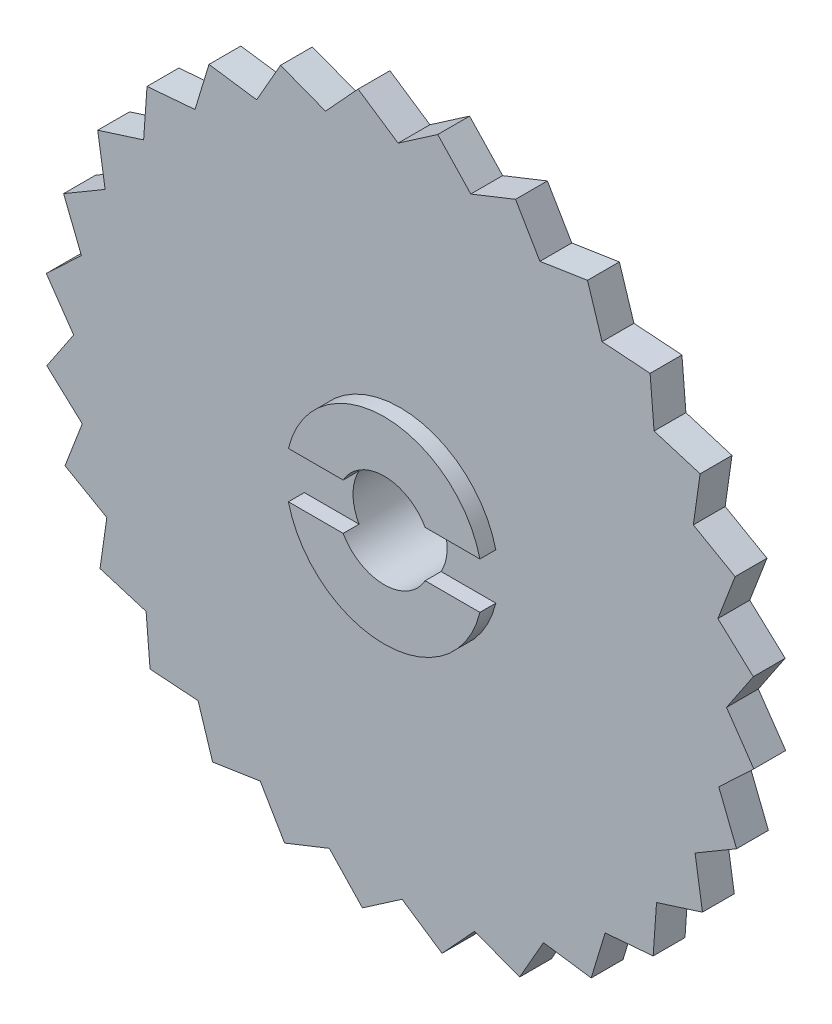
ISO-10303-21;
HEADER;
FILE_DESCRIPTION(('STEP AP214'),'2;1');
FILE_NAME('part.step','',(''),(''),'','','');
FILE_SCHEMA(('AUTOMOTIVE_DESIGN { 1 0 10303 214 1 1 1 1 }'));
ENDSEC;
DATA;
#1=APPLICATION_CONTEXT('core data for automotive mechanical design processes');
#2=APPLICATION_PROTOCOL_DEFINITION('international standard','automotive_design',2000,#1);
#3=PRODUCT_CONTEXT('',#1,'mechanical');
#4=PRODUCT('Part','Part','',(#3));
#5=PRODUCT_RELATED_PRODUCT_CATEGORY('part','',(#4));
#6=PRODUCT_DEFINITION_FORMATION('','',#4);
#7=PRODUCT_DEFINITION_CONTEXT('part definition',#1,'design');
#8=PRODUCT_DEFINITION('design','',#6,#7);
#9=PRODUCT_DEFINITION_SHAPE('','',#8);
#10=(LENGTH_UNIT() NAMED_UNIT(*) SI_UNIT(.MILLI.,.METRE.));
#11=(NAMED_UNIT(*) PLANE_ANGLE_UNIT() SI_UNIT($,.RADIAN.));
#12=(NAMED_UNIT(*) SI_UNIT($,.STERADIAN.) SOLID_ANGLE_UNIT());
#13=UNCERTAINTY_MEASURE_WITH_UNIT(LENGTH_MEASURE(1.E-05),#10,'distance_accuracy_value','');
#14=(GEOMETRIC_REPRESENTATION_CONTEXT(3) GLOBAL_UNCERTAINTY_ASSIGNED_CONTEXT((#13)) GLOBAL_UNIT_ASSIGNED_CONTEXT((#10,
#11,#12)) REPRESENTATION_CONTEXT('',''));
#15=CARTESIAN_POINT('',(0.,0.,0.));
#16=DIRECTION('',(0.,0.,1.));
#17=DIRECTION('',(1.,0.,0.));
#18=AXIS2_PLACEMENT_3D('',#15,#16,#17);
#19=CARTESIAN_POINT('',(0.,0.,0.));
#20=DIRECTION('',(0.,0.,1.));
#21=DIRECTION('',(1.,0.,0.));
#22=AXIS2_PLACEMENT_3D('',#19,#20,#21);
#23=CYLINDRICAL_SURFACE('',#22,2.955);
#24=CARTESIAN_POINT('',(-2.955,0.,1.11));
#25=CARTESIAN_POINT('',(-2.95499560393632,0.0787131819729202,1.11000503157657));
#26=CARTESIAN_POINT('',(-2.95182144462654,0.157515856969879,1.11623211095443));
#27=CARTESIAN_POINT('',(-2.93943640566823,0.312783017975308,1.14086069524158));
#28=CARTESIAN_POINT('',(-2.93021452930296,0.389242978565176,1.15928437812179));
#29=CARTESIAN_POINT('',(-2.9066971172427,0.537343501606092,1.20739517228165));
#30=CARTESIAN_POINT('',(-2.89242151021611,0.609001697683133,1.23703807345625));
#31=CARTESIAN_POINT('',(-2.86009829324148,0.746216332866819,1.30651202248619));
#32=CARTESIAN_POINT('',(-2.84205090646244,0.811773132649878,1.34634246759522));
#33=CARTESIAN_POINT('',(-2.80252403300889,0.939480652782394,1.43785531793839));
#34=CARTESIAN_POINT('',(-2.78090137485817,1.00117054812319,1.49011802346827));
#35=CARTESIAN_POINT('',(-2.73711447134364,1.11533627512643,1.60375900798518));
#36=CARTESIAN_POINT('',(-2.71494981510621,1.16780485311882,1.66514439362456));
#37=CARTESIAN_POINT('',(-2.67052513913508,1.26628164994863,1.80121233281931));
#38=CARTESIAN_POINT('',(-2.64840126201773,1.31142899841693,1.87656769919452));
#39=CARTESIAN_POINT('',(-2.60897435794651,1.38821941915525,2.03503693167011));
#40=CARTESIAN_POINT('',(-2.591667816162,1.41987234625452,2.11814508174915));
#41=CARTESIAN_POINT('',(-2.56545460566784,1.46668093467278,2.28464006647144));
#42=CARTESIAN_POINT('',(-2.55610239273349,1.48272022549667,2.36770469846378));
#43=CARTESIAN_POINT('',(-2.54568664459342,1.50054117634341,2.53582817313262));
#44=CARTESIAN_POINT('',(-2.5446144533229,1.50233772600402,2.62088483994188));
#45=CARTESIAN_POINT('',(-2.55052370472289,1.49226944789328,2.77921039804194));
#46=CARTESIAN_POINT('',(-2.55652144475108,1.48207361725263,2.85263130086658));
#47=CARTESIAN_POINT('',(-2.57416503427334,1.45121059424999,2.99652983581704));
#48=CARTESIAN_POINT('',(-2.58581277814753,1.4305398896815,3.06700647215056));
#49=CARTESIAN_POINT('',(-2.61369466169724,1.37894805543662,3.20502992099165));
#50=CARTESIAN_POINT('',(-2.6300289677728,1.34780016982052,3.27247078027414));
#51=CARTESIAN_POINT('',(-2.66545233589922,1.27631449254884,3.40149697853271));
#52=CARTESIAN_POINT('',(-2.68454263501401,1.2359725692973,3.46307966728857));
#53=CARTESIAN_POINT('',(-2.72635229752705,1.14107508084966,3.58714889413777));
#54=CARTESIAN_POINT('',(-2.74921915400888,1.0853490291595,3.64869363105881));
#55=CARTESIAN_POINT('',(-2.79398202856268,0.964290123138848,3.76196365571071));
#56=CARTESIAN_POINT('',(-2.81587755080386,0.898952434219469,3.81368397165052));
#57=CARTESIAN_POINT('',(-2.85754419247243,0.756462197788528,3.9082390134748));
#58=CARTESIAN_POINT('',(-2.87715769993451,0.678886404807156,3.95051107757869));
#59=CARTESIAN_POINT('',(-2.91069196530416,0.516478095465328,4.02105279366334));
#60=CARTESIAN_POINT('',(-2.9246173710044,0.431651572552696,4.04933388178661));
#61=CARTESIAN_POINT('',(-2.94420406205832,0.264831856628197,4.08870787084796));
#62=CARTESIAN_POINT('',(-2.95046419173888,0.18320484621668,4.10105114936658));
#63=CARTESIAN_POINT('',(-2.95608215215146,0.0188107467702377,4.11213940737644));
#64=CARTESIAN_POINT('',(-2.95544340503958,-0.0639557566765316,4.11089112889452));
#65=CARTESIAN_POINT('',(-2.94767695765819,-0.221195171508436,4.09553336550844));
#66=CARTESIAN_POINT('',(-2.94107523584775,-0.295799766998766,4.08246626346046));
#67=CARTESIAN_POINT('',(-2.92274101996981,-0.441600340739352,4.04549540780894));
#68=CARTESIAN_POINT('',(-2.91100796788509,-0.512795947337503,4.0215904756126));
#69=CARTESIAN_POINT('',(-2.88305777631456,-0.652067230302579,3.96302491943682));
#70=CARTESIAN_POINT('',(-2.8667246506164,-0.720000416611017,3.92808278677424));
#71=CARTESIAN_POINT('',(-2.83112820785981,-0.849258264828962,3.848756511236));
#72=CARTESIAN_POINT('',(-2.81186366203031,-0.91058013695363,3.80436840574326));
#73=CARTESIAN_POINT('',(-2.76996423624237,-1.03141226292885,3.70227164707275));
#74=CARTESIAN_POINT('',(-2.74718519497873,-1.09012163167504,3.64367278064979));
#75=CARTESIAN_POINT('',(-2.70222255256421,-1.19724699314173,3.51744668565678));
#76=CARTESIAN_POINT('',(-2.68003940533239,-1.24565532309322,3.44981279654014));
#77=CARTESIAN_POINT('',(-2.63762304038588,-1.33321510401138,3.30297744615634));
#78=CARTESIAN_POINT('',(-2.61755334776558,-1.37174710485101,3.2233550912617));
#79=CARTESIAN_POINT('',(-2.58372892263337,-1.43445365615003,3.05741696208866));
#80=CARTESIAN_POINT('',(-2.56996582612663,-1.45864723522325,2.97111023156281));
#81=CARTESIAN_POINT('',(-2.55207112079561,-1.48971504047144,2.80317793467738));
#82=CARTESIAN_POINT('',(-2.54713587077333,-1.4980395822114,2.72190842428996));
#83=CARTESIAN_POINT('',(-2.54519289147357,-1.50134164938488,2.5590196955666));
#84=CARTESIAN_POINT('',(-2.54818135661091,-1.49632558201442,2.47740066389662));
#85=CARTESIAN_POINT('',(-2.56088603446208,-1.47445469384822,2.32483286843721));
#86=CARTESIAN_POINT('',(-2.56989278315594,-1.45884583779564,2.25363858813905));
#87=CARTESIAN_POINT('',(-2.59275860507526,-1.41780684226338,2.11496881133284));
#88=CARTESIAN_POINT('',(-2.60661927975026,-1.39237346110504,2.0474945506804));
#89=CARTESIAN_POINT('',(-2.63875994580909,-1.33051125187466,1.91317143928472));
#90=CARTESIAN_POINT('',(-2.65727361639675,-1.29346047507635,1.84666664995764));
#91=CARTESIAN_POINT('',(-2.69626313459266,-1.21008586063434,1.72037970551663));
#92=CARTESIAN_POINT('',(-2.71674001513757,-1.16375712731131,1.66060112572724));
#93=CARTESIAN_POINT('',(-2.76045154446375,-1.05626970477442,1.54158533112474));
#94=CARTESIAN_POINT('',(-2.78370706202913,-0.993975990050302,1.48337521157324));
#95=CARTESIAN_POINT('',(-2.82800226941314,-0.859889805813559,1.37798500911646));
#96=CARTESIAN_POINT('',(-2.84904071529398,-0.788092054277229,1.33081110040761));
#97=CARTESIAN_POINT('',(-2.88687771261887,-0.635754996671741,1.24860934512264));
#98=CARTESIAN_POINT('',(-2.90362919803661,-0.555131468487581,1.21371487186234));
#99=CARTESIAN_POINT('',(-2.93060754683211,-0.388151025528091,1.15844061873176));
#100=CARTESIAN_POINT('',(-2.94085271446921,-0.30181095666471,1.1380201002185));
#101=CARTESIAN_POINT('',(-2.94980253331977,-0.178788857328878,1.12026072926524));
#102=CARTESIAN_POINT('',(-2.95174615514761,-0.14317442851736,1.11641876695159));
#103=CARTESIAN_POINT('',(-2.95434590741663,-0.0717128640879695,1.11128722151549));
#104=CARTESIAN_POINT('',(-2.95500200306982,-0.0358657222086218,1.10999770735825));
#105=CARTESIAN_POINT('',(-2.955,0.,1.11));
#106=B_SPLINE_CURVE_WITH_KNOTS('',3,(#24,#25,#26,#27,#28,#29,#30,#31,#32,#33,#34,#35,#36,#37,
#38,#39,#40,#41,#42,#43,#44,#45,#46,#47,#48,#49,#50,#51,#52,#53,#54,#55,#56,#57,#58,#59,#60,#61,
#62,#63,#64,#65,#66,#67,#68,#69,#70,#71,#72,#73,#74,#75,#76,#77,#78,#79,#80,#81,#82,#83,#84,#85,
#86,#87,#88,#89,#90,#91,#92,#93,#94,#95,#96,#97,#98,#99,#100,#101,#102,#103,#104,#105),
.UNSPECIFIED.,.T.,.F.,(4,2,2,2,2,2,2,2,2,2,2,2,2,2,2,2,2,2,2,2,2,2,2,2,2,2,2,2,2,2,2,2,2,2,2,2,
2,2,2,2,4),(0.,0.235994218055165,0.472418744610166,0.707921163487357,0.943409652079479,
1.19345035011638,1.4436868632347,1.71408087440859,1.98427708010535,2.23809649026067,
2.49165051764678,2.71371376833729,2.93585152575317,3.16314459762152,3.39054001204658,
3.64777471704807,3.90513925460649,4.1751715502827,4.44498275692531,4.69199687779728,
4.93888847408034,5.16592482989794,5.39298588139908,5.62638272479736,5.85987767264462,
6.1168297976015,6.37397240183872,6.64461568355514,6.91489898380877,7.1590081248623,
7.40300004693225,7.62236621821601,7.84180483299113,8.07592918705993,8.31017740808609,
8.57408823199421,8.83814634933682,9.10498991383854,9.3710794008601,9.47860744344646,
9.58613839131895),.UNSPECIFIED.);
#107=CARTESIAN_POINT('',(-2.955,0.,1.11));
#108=VERTEX_POINT('',#107);
#109=EDGE_CURVE('E1070',#108,#108,#106,.T.);
#110=ORIENTED_EDGE('',*,*,#109,.F.);
#111=EDGE_LOOP('',(#110));
#112=FACE_BOUND('',#111,.T.);
#113=CARTESIAN_POINT('',(0.,0.,0.5));
#114=DIRECTION('',(0.,0.,-1.));
#115=DIRECTION('',(-1.,0.,0.));
#116=AXIS2_PLACEMENT_3D('',#113,#114,#115);
#117=CIRCLE('',#116,2.955);
#118=CARTESIAN_POINT('',(2.57478639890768,-1.45,0.5));
#119=VERTEX_POINT('',#118);
#120=CARTESIAN_POINT('',(2.57478639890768,1.45,0.5));
#121=VERTEX_POINT('',#120);
#122=EDGE_CURVE('E1134',#119,#121,#117,.F.);
#123=ORIENTED_EDGE('',*,*,#122,.F.);
#124=DIRECTION('',(0.,0.,1.));
#125=VECTOR('',#124,1.);
#126=CARTESIAN_POINT('',(2.57478639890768,-1.45,0.));
#127=LINE('',#126,#125);
#128=CARTESIAN_POINT('',(2.57478639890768,-1.45,0.));
#129=VERTEX_POINT('',#128);
#130=EDGE_CURVE('E1161',#119,#129,#127,.F.);
#131=ORIENTED_EDGE('',*,*,#130,.T.);
#132=CARTESIAN_POINT('',(0.,0.,0.));
#133=DIRECTION('',(0.,0.,1.));
#134=DIRECTION('',(1.,0.,0.));
#135=AXIS2_PLACEMENT_3D('',#132,#133,#134);
#136=CIRCLE('',#135,2.955);
#137=CARTESIAN_POINT('',(-2.57478639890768,-1.45,0.));
#138=VERTEX_POINT('',#137);
#139=EDGE_CURVE('E929',#138,#129,#136,.T.);
#140=ORIENTED_EDGE('',*,*,#139,.F.);
#141=DIRECTION('',(0.,0.,1.));
#142=VECTOR('',#141,1.);
#143=CARTESIAN_POINT('',(-2.57478639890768,-1.45,0.));
#144=LINE('',#143,#142);
#145=CARTESIAN_POINT('',(-2.57478639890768,-1.45,0.5));
#146=VERTEX_POINT('',#145);
#147=EDGE_CURVE('E1158',#138,#146,#144,.T.);
#148=ORIENTED_EDGE('',*,*,#147,.T.);
#149=CARTESIAN_POINT('',(-2.57478639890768,1.45,0.5));
#150=VERTEX_POINT('',#149);
#151=EDGE_CURVE('E1151',#150,#146,#117,.F.);
#152=ORIENTED_EDGE('',*,*,#151,.F.);
#153=DIRECTION('',(0.,0.,1.));
#154=VECTOR('',#153,1.);
#155=CARTESIAN_POINT('',(-2.57478639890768,1.45,0.));
#156=LINE('',#155,#154);
#157=CARTESIAN_POINT('',(-2.57478639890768,1.45,0.));
#158=VERTEX_POINT('',#157);
#159=EDGE_CURVE('E1155',#150,#158,#156,.F.);
#160=ORIENTED_EDGE('',*,*,#159,.T.);
#161=CARTESIAN_POINT('',(2.57478639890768,1.45,0.));
#162=VERTEX_POINT('',#161);
#163=EDGE_CURVE('E950',#162,#158,#136,.T.);
#164=ORIENTED_EDGE('',*,*,#163,.F.);
#165=DIRECTION('',(0.,0.,1.));
#166=VECTOR('',#165,1.);
#167=CARTESIAN_POINT('',(2.57478639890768,1.45,0.));
#168=LINE('',#167,#166);
#169=EDGE_CURVE('E1153',#162,#121,#168,.T.);
#170=ORIENTED_EDGE('',*,*,#169,.T.);
#171=EDGE_LOOP('',(#123,#131,#140,#148,#152,#160,#164,#170));
#172=FACE_BOUND('',#171,.T.);
#173=CARTESIAN_POINT('',(0.,0.,9.));
#174=DIRECTION('',(0.,0.,1.));
#175=DIRECTION('',(1.,0.,0.));
#176=AXIS2_PLACEMENT_3D('',#173,#174,#175);
#177=CIRCLE('',#176,2.955);
#178=CARTESIAN_POINT('',(2.57478639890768,1.45,9.));
#179=VERTEX_POINT('',#178);
#180=CARTESIAN_POINT('',(-2.57478639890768,1.45,9.));
#181=VERTEX_POINT('',#180);
#182=EDGE_CURVE('E947',#179,#181,#177,.T.);
#183=ORIENTED_EDGE('',*,*,#182,.T.);
#184=DIRECTION('',(0.,0.,1.));
#185=VECTOR('',#184,1.);
#186=CARTESIAN_POINT('',(-2.57478639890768,1.45,0.));
#187=LINE('',#186,#185);
#188=CARTESIAN_POINT('',(-2.57478639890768,1.45,8.));
#189=VERTEX_POINT('',#188);
#190=EDGE_CURVE('E1040',#181,#189,#187,.F.);
#191=ORIENTED_EDGE('',*,*,#190,.T.);
#192=CARTESIAN_POINT('',(0.,0.,8.));
#193=DIRECTION('',(0.,0.,1.));
#194=DIRECTION('',(1.,0.,0.));
#195=AXIS2_PLACEMENT_3D('',#192,#193,#194);
#196=CIRCLE('',#195,2.955);
#197=CARTESIAN_POINT('',(-2.57478639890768,-1.45,8.));
#198=VERTEX_POINT('',#197);
#199=EDGE_CURVE('E1031',#198,#189,#196,.F.);
#200=ORIENTED_EDGE('',*,*,#199,.F.);
#201=DIRECTION('',(0.,0.,1.));
#202=VECTOR('',#201,1.);
#203=CARTESIAN_POINT('',(-2.57478639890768,-1.45,0.));
#204=LINE('',#203,#202);
#205=CARTESIAN_POINT('',(-2.57478639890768,-1.45,9.));
#206=VERTEX_POINT('',#205);
#207=EDGE_CURVE('E1037',#198,#206,#204,.T.);
#208=ORIENTED_EDGE('',*,*,#207,.T.);
#209=CARTESIAN_POINT('',(2.57478639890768,-1.45,9.));
#210=VERTEX_POINT('',#209);
#211=EDGE_CURVE('E941',#206,#210,#177,.T.);
#212=ORIENTED_EDGE('',*,*,#211,.T.);
#213=DIRECTION('',(0.,0.,1.));
#214=VECTOR('',#213,1.);
#215=CARTESIAN_POINT('',(2.57478639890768,-1.45,0.));
#216=LINE('',#215,#214);
#217=CARTESIAN_POINT('',(2.57478639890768,-1.45,8.));
#218=VERTEX_POINT('',#217);
#219=EDGE_CURVE('E1030',#210,#218,#216,.F.);
#220=ORIENTED_EDGE('',*,*,#219,.T.);
#221=CARTESIAN_POINT('',(2.57478639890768,1.45,8.));
#222=VERTEX_POINT('',#221);
#223=EDGE_CURVE('E1028',#222,#218,#196,.F.);
#224=ORIENTED_EDGE('',*,*,#223,.F.);
#225=DIRECTION('',(0.,0.,1.));
#226=VECTOR('',#225,1.);
#227=CARTESIAN_POINT('',(2.57478639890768,1.45,0.));
#228=LINE('',#227,#226);
#229=EDGE_CURVE('E1034',#222,#179,#228,.T.);
#230=ORIENTED_EDGE('',*,*,#229,.T.);
#231=EDGE_LOOP('',(#183,#191,#200,#208,#212,#220,#224,#230));
#232=FACE_BOUND('',#231,.T.);
#233=CARTESIAN_POINT('',(2.955,0.,1.11));
#234=CARTESIAN_POINT('',(2.95499560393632,-0.0787131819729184,1.11000503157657));
#235=CARTESIAN_POINT('',(2.95182144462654,-0.157515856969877,1.11623211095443));
#236=CARTESIAN_POINT('',(2.93943640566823,-0.312783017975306,1.14086069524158));
#237=CARTESIAN_POINT('',(2.93021452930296,-0.389242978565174,1.15928437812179));
#238=CARTESIAN_POINT('',(2.9066971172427,-0.53734350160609,1.20739517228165));
#239=CARTESIAN_POINT('',(2.89242151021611,-0.609001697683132,1.23703807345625));
#240=CARTESIAN_POINT('',(2.86009829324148,-0.746216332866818,1.30651202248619));
#241=CARTESIAN_POINT('',(2.84205090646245,-0.811773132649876,1.34634246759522));
#242=CARTESIAN_POINT('',(2.80252403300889,-0.939480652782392,1.43785531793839));
#243=CARTESIAN_POINT('',(2.78090137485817,-1.00117054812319,1.49011802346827));
#244=CARTESIAN_POINT('',(2.73711447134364,-1.11533627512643,1.60375900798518));
#245=CARTESIAN_POINT('',(2.71494981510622,-1.16780485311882,1.66514439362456));
#246=CARTESIAN_POINT('',(2.67052513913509,-1.26628164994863,1.80121233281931));
#247=CARTESIAN_POINT('',(2.64840126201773,-1.31142899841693,1.87656769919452));
#248=CARTESIAN_POINT('',(2.60897435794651,-1.38821941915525,2.03503693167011));
#249=CARTESIAN_POINT('',(2.591667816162,-1.41987234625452,2.11814508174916));
#250=CARTESIAN_POINT('',(2.56545460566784,-1.46668093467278,2.28464006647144));
#251=CARTESIAN_POINT('',(2.55610239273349,-1.48272022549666,2.36770469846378));
#252=CARTESIAN_POINT('',(2.54568664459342,-1.5005411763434,2.53582817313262));
#253=CARTESIAN_POINT('',(2.54461445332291,-1.50233772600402,2.62088483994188));
#254=CARTESIAN_POINT('',(2.55052370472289,-1.49226944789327,2.77921039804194));
#255=CARTESIAN_POINT('',(2.55652144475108,-1.48207361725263,2.85263130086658));
#256=CARTESIAN_POINT('',(2.57416503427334,-1.45121059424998,2.99652983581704));
#257=CARTESIAN_POINT('',(2.58581277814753,-1.43053988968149,3.06700647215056));
#258=CARTESIAN_POINT('',(2.61369466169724,-1.37894805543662,3.20502992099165));
#259=CARTESIAN_POINT('',(2.6300289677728,-1.34780016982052,3.27247078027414));
#260=CARTESIAN_POINT('',(2.66545233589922,-1.27631449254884,3.40149697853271));
#261=CARTESIAN_POINT('',(2.68454263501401,-1.23597256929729,3.46307966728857));
#262=CARTESIAN_POINT('',(2.72635229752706,-1.14107508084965,3.58714889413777));
#263=CARTESIAN_POINT('',(2.74921915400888,-1.0853490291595,3.64869363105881));
#264=CARTESIAN_POINT('',(2.79398202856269,-0.964290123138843,3.76196365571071));
#265=CARTESIAN_POINT('',(2.81587755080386,-0.898952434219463,3.81368397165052));
#266=CARTESIAN_POINT('',(2.85754419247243,-0.756462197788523,3.9082390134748));
#267=CARTESIAN_POINT('',(2.87715769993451,-0.678886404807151,3.95051107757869));
#268=CARTESIAN_POINT('',(2.91069196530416,-0.516478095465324,4.02105279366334));
#269=CARTESIAN_POINT('',(2.9246173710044,-0.431651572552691,4.04933388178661));
#270=CARTESIAN_POINT('',(2.94420406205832,-0.264831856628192,4.08870787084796));
#271=CARTESIAN_POINT('',(2.95046419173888,-0.183204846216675,4.10105114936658));
#272=CARTESIAN_POINT('',(2.95608215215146,-0.0188107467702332,4.11213940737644));
#273=CARTESIAN_POINT('',(2.95544340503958,0.0639557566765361,4.11089112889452));
#274=CARTESIAN_POINT('',(2.94767695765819,0.221195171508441,4.09553336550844));
#275=CARTESIAN_POINT('',(2.94107523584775,0.295799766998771,4.08246626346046));
#276=CARTESIAN_POINT('',(2.9227410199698,0.441600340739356,4.04549540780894));
#277=CARTESIAN_POINT('',(2.91100796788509,0.512795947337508,4.0215904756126));
#278=CARTESIAN_POINT('',(2.88305777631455,0.652067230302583,3.96302491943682));
#279=CARTESIAN_POINT('',(2.8667246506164,0.720000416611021,3.92808278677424));
#280=CARTESIAN_POINT('',(2.83112820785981,0.849258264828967,3.848756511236));
#281=CARTESIAN_POINT('',(2.81186366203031,0.910580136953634,3.80436840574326));
#282=CARTESIAN_POINT('',(2.76996423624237,1.03141226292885,3.70227164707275));
#283=CARTESIAN_POINT('',(2.74718519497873,1.09012163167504,3.64367278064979));
#284=CARTESIAN_POINT('',(2.70222255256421,1.19724699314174,3.51744668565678));
#285=CARTESIAN_POINT('',(2.68003940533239,1.24565532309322,3.44981279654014));
#286=CARTESIAN_POINT('',(2.63762304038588,1.33321510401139,3.30297744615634));
#287=CARTESIAN_POINT('',(2.61755334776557,1.37174710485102,3.22335509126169));
#288=CARTESIAN_POINT('',(2.58372892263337,1.43445365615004,3.05741696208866));
#289=CARTESIAN_POINT('',(2.56996582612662,1.45864723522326,2.97111023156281));
#290=CARTESIAN_POINT('',(2.55207112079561,1.48971504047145,2.80317793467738));
#291=CARTESIAN_POINT('',(2.54713587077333,1.49803958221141,2.72190842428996));
#292=CARTESIAN_POINT('',(2.54519289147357,1.50134164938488,2.5590196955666));
#293=CARTESIAN_POINT('',(2.54818135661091,1.49632558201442,2.47740066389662));
#294=CARTESIAN_POINT('',(2.56088603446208,1.47445469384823,2.32483286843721));
#295=CARTESIAN_POINT('',(2.56989278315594,1.45884583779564,2.25363858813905));
#296=CARTESIAN_POINT('',(2.59275860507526,1.41780684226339,2.11496881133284));
#297=CARTESIAN_POINT('',(2.60661927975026,1.39237346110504,2.0474945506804));
#298=CARTESIAN_POINT('',(2.63875994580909,1.33051125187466,1.91317143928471));
#299=CARTESIAN_POINT('',(2.65727361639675,1.29346047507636,1.84666664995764));
#300=CARTESIAN_POINT('',(2.69626313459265,1.21008586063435,1.72037970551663));
#301=CARTESIAN_POINT('',(2.71674001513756,1.16375712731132,1.66060112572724));
#302=CARTESIAN_POINT('',(2.76045154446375,1.05626970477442,1.54158533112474));
#303=CARTESIAN_POINT('',(2.78370706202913,0.993975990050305,1.48337521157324));
#304=CARTESIAN_POINT('',(2.82800226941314,0.859889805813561,1.37798500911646));
#305=CARTESIAN_POINT('',(2.84904071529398,0.788092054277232,1.33081110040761));
#306=CARTESIAN_POINT('',(2.88687771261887,0.635754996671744,1.24860934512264));
#307=CARTESIAN_POINT('',(2.90362919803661,0.555131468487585,1.21371487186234));
#308=CARTESIAN_POINT('',(2.93060754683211,0.388151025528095,1.15844061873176));
#309=CARTESIAN_POINT('',(2.94085271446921,0.301810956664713,1.1380201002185));
#310=CARTESIAN_POINT('',(2.94980253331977,0.17878885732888,1.12026072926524));
#311=CARTESIAN_POINT('',(2.95174615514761,0.143174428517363,1.11641876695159));
#312=CARTESIAN_POINT('',(2.95434590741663,0.0717128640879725,1.11128722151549));
#313=CARTESIAN_POINT('',(2.95500200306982,0.0358657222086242,1.10999770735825));
#314=CARTESIAN_POINT('',(2.955,0.,1.11));
#315=B_SPLINE_CURVE_WITH_KNOTS('',3,(#233,#234,#235,#236,#237,#238,#239,#240,#241,#242,#243,
#244,#245,#246,#247,#248,#249,#250,#251,#252,#253,#254,#255,#256,#257,#258,#259,#260,#261,#262,
#263,#264,#265,#266,#267,#268,#269,#270,#271,#272,#273,#274,#275,#276,#277,#278,#279,#280,#281,
#282,#283,#284,#285,#286,#287,#288,#289,#290,#291,#292,#293,#294,#295,#296,#297,#298,#299,#300,
#301,#302,#303,#304,#305,#306,#307,#308,#309,#310,#311,#312,#313,#314),.UNSPECIFIED.,.T.,.F.,(4,
2,2,2,2,2,2,2,2,2,2,2,2,2,2,2,2,2,2,2,2,2,2,2,2,2,2,2,2,2,2,2,2,2,2,2,2,2,2,2,4),(0.,
0.235994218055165,0.472418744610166,0.707921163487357,0.943409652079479,1.19345035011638,
1.4436868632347,1.71408087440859,1.98427708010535,2.23809649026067,2.49165051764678,
2.71371376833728,2.93585152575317,3.16314459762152,3.39054001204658,3.64777471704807,
3.90513925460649,4.1751715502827,4.44498275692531,4.69199687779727,4.93888847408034,
5.16592482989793,5.39298588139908,5.62638272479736,5.85987767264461,6.1168297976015,
6.37397240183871,6.64461568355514,6.91489898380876,7.15900812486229,7.40300004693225,
7.62236621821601,7.84180483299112,8.07592918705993,8.31017740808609,8.57408823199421,
8.83814634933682,9.10498991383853,9.3710794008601,9.47860744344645,9.58613839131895),.UNSPECIFIED.);
#316=CARTESIAN_POINT('',(2.955,0.,1.11));
#317=VERTEX_POINT('',#316);
#318=EDGE_CURVE('E1075',#317,#317,#315,.T.);
#319=ORIENTED_EDGE('',*,*,#318,.F.);
#320=EDGE_LOOP('',(#319));
#321=FACE_BOUND('',#320,.T.);
#322=ADVANCED_FACE('F459',(#112,#172,#232,#321),#23,.F.);
#323=CARTESIAN_POINT('',(0.,0.,4.22));
#324=DIRECTION('',(0.,0.,-1.));
#325=DIRECTION('',(-1.,0.,0.));
#326=AXIS2_PLACEMENT_3D('',#323,#324,#325);
#327=CYLINDRICAL_SURFACE('',#326,5.97);
#328=CARTESIAN_POINT('',(5.97,0.,1.11));
#329=CARTESIAN_POINT('',(5.96999860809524,-0.0828625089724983,1.11000230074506));
#330=CARTESIAN_POINT('',(5.96825765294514,-0.165750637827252,1.11688928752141));
#331=CARTESIAN_POINT('',(5.96148136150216,-0.329150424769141,1.14421346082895));
#332=CARTESIAN_POINT('',(5.95644417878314,-0.40966072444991,1.16465824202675));
#333=CARTESIAN_POINT('',(5.94363308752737,-0.565921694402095,1.21839992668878));
#334=CARTESIAN_POINT('',(5.93586248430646,-0.641677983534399,1.25168131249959));
#335=CARTESIAN_POINT('',(5.91841165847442,-0.786532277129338,1.33009666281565));
#336=CARTESIAN_POINT('',(5.90873136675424,-0.855630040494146,1.3752310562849));
#337=CARTESIAN_POINT('',(5.88828667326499,-0.986642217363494,1.47706219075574));
#338=CARTESIAN_POINT('',(5.87750541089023,-1.04839850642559,1.53395899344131));
#339=CARTESIAN_POINT('',(5.85618562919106,-1.16160026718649,1.65727157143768));
#340=CARTESIAN_POINT('',(5.84564713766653,-1.21304456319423,1.72368843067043));
#341=CARTESIAN_POINT('',(5.82583593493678,-1.30490770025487,1.86538608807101));
#342=CARTESIAN_POINT('',(5.81658461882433,-1.34514928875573,1.94078506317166));
#343=CARTESIAN_POINT('',(5.80064126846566,-1.41232468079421,2.09754776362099));
#344=CARTESIAN_POINT('',(5.7939488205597,-1.43926063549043,2.17891052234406));
#345=CARTESIAN_POINT('',(5.78405429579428,-1.47852000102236,2.34355155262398));
#346=CARTESIAN_POINT('',(5.78078437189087,-1.49112789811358,2.42675781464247));
#347=CARTESIAN_POINT('',(5.77790206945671,-1.50225944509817,2.59416377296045));
#348=CARTESIAN_POINT('',(5.77828908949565,-1.50078541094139,2.67836330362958));
#349=CARTESIAN_POINT('',(5.7826159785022,-1.48402183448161,2.84318239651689));
#350=CARTESIAN_POINT('',(5.78646856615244,-1.46907167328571,2.92383912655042));
#351=CARTESIAN_POINT('',(5.79715335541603,-1.42632176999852,3.08146133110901));
#352=CARTESIAN_POINT('',(5.80398577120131,-1.39852110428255,3.15842653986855));
#353=CARTESIAN_POINT('',(5.81994024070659,-1.33057106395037,3.3073891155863));
#354=CARTESIAN_POINT('',(5.82908490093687,-1.29029882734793,3.37932791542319));
#355=CARTESIAN_POINT('',(5.84862076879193,-1.19863473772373,3.51554811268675));
#356=CARTESIAN_POINT('',(5.85901219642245,-1.14724092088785,3.57982815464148));
#357=CARTESIAN_POINT('',(5.88023793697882,-1.033036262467,3.70085059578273));
#358=CARTESIAN_POINT('',(5.89107638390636,-0.969939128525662,3.7573224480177));
#359=CARTESIAN_POINT('',(5.91170505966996,-0.835040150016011,3.85893500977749));
#360=CARTESIAN_POINT('',(5.92149525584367,-0.763238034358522,3.90407536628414));
#361=CARTESIAN_POINT('',(5.93897387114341,-0.612578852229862,3.98184435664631));
#362=CARTESIAN_POINT('',(5.94665481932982,-0.533697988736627,4.01442867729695));
#363=CARTESIAN_POINT('',(5.95899519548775,-0.371342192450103,4.06579898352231));
#364=CARTESIAN_POINT('',(5.96365520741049,-0.28786815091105,4.08458763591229));
#365=CARTESIAN_POINT('',(5.96934210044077,-0.12100834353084,4.10741923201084));
#366=CARTESIAN_POINT('',(5.97045972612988,-0.0376760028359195,4.11183056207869));
#367=CARTESIAN_POINT('',(5.96919455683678,0.128536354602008,4.10679318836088));
#368=CARTESIAN_POINT('',(5.96681208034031,0.211416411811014,4.09734574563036));
#369=CARTESIAN_POINT('',(5.9588725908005,0.373088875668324,4.06516254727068));
#370=CARTESIAN_POINT('',(5.95336369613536,0.451923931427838,4.04262809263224));
#371=CARTESIAN_POINT('',(5.93979256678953,0.604690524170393,3.98514075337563));
#372=CARTESIAN_POINT('',(5.93173007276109,0.678621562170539,3.95018660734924));
#373=CARTESIAN_POINT('',(5.91372909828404,0.820944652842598,3.8681404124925));
#374=CARTESIAN_POINT('',(5.90375964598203,0.889213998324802,3.8208424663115));
#375=CARTESIAN_POINT('',(5.88309890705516,1.01697734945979,3.71571414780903));
#376=CARTESIAN_POINT('',(5.87240749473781,1.07646982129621,3.65788193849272));
#377=CARTESIAN_POINT('',(5.85118064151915,1.18651126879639,3.5316156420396));
#378=CARTESIAN_POINT('',(5.8406556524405,1.23680171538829,3.46295410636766));
#379=CARTESIAN_POINT('',(5.82124897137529,1.32514686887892,3.31794930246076));
#380=CARTESIAN_POINT('',(5.81236720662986,1.36320211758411,3.2416063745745));
#381=CARTESIAN_POINT('',(5.79735085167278,1.42571282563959,3.08381378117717));
#382=CARTESIAN_POINT('',(5.79120003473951,1.45024882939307,3.00239764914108));
#383=CARTESIAN_POINT('',(5.78232718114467,1.48523542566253,2.8364175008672));
#384=CARTESIAN_POINT('',(5.77960438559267,1.49568913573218,2.75185418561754));
#385=CARTESIAN_POINT('',(5.77795411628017,1.50205027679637,2.58461206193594));
#386=CARTESIAN_POINT('',(5.77891878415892,1.49837107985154,2.50194979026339));
#387=CARTESIAN_POINT('',(5.78428514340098,1.47751785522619,2.33846484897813));
#388=CARTESIAN_POINT('',(5.78868676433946,1.46034410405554,2.25764214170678));
#389=CARTESIAN_POINT('',(5.80037065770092,1.41321608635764,2.10058523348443));
#390=CARTESIAN_POINT('',(5.80763526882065,1.38334009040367,2.02432614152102));
#391=CARTESIAN_POINT('',(5.82422892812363,1.31171748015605,1.87784811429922));
#392=CARTESIAN_POINT('',(5.83355826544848,1.26996920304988,1.80763002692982));
#393=CARTESIAN_POINT('',(5.85353715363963,1.17449432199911,1.67323149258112));
#394=CARTESIAN_POINT('',(5.86421500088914,1.12048123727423,1.60925873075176));
#395=CARTESIAN_POINT('',(5.88551967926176,1.00256726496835,1.49115049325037));
#396=CARTESIAN_POINT('',(5.89614649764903,0.938664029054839,1.43701736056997));
#397=CARTESIAN_POINT('',(5.91638442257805,0.801368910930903,1.33915619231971));
#398=CARTESIAN_POINT('',(5.92597332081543,0.727824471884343,1.29563724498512));
#399=CARTESIAN_POINT('',(5.94282009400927,0.57422887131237,1.22164983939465));
#400=CARTESIAN_POINT('',(5.95007962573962,0.494182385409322,1.19117210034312));
#401=CARTESIAN_POINT('',(5.96038628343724,0.345241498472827,1.14861632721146));
#402=CARTESIAN_POINT('',(5.96396655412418,0.277051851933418,1.13416667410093));
#403=CARTESIAN_POINT('',(5.96877390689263,0.139247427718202,1.11485791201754));
#404=CARTESIAN_POINT('',(5.97000116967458,0.069632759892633,1.1099980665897));
#405=CARTESIAN_POINT('',(5.97,0.,1.11));
#406=B_SPLINE_CURVE_WITH_KNOTS('',3,(#328,#329,#330,#331,#332,#333,#334,#335,#336,#337,#338,
#339,#340,#341,#342,#343,#344,#345,#346,#347,#348,#349,#350,#351,#352,#353,#354,#355,#356,#357,
#358,#359,#360,#361,#362,#363,#364,#365,#366,#367,#368,#369,#370,#371,#372,#373,#374,#375,#376,
#377,#378,#379,#380,#381,#382,#383,#384,#385,#386,#387,#388,#389,#390,#391,#392,#393,#394,#395,
#396,#397,#398,#399,#400,#401,#402,#403,#404,#405),.UNSPECIFIED.,.T.,.F.,(4,2,2,2,2,2,2,2,2,2,2,
2,2,2,2,2,2,2,2,2,2,2,2,2,2,2,2,2,2,2,2,2,2,2,2,2,2,2,4),(0.,0.248332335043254,
0.496803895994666,0.744976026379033,0.993157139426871,1.24596991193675,1.49881149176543,
1.75545164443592,2.01205029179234,2.26345988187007,2.51482812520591,2.76003755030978,
3.00526460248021,3.25298875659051,3.5007566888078,3.75566356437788,4.01057838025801,
4.26638478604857,4.52214172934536,4.77129172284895,5.0204190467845,5.26581220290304,
5.51123028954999,5.76103749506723,6.01088830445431,6.26693835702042,6.52297706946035,
6.77747339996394,7.03191338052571,7.27896873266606,7.52601902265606,7.77156857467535,
8.01715253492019,8.26920358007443,8.52131456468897,8.77805029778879,9.03460301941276,
9.24330287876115,9.45198671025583),.UNSPECIFIED.);
#407=CARTESIAN_POINT('',(5.97,0.,1.11));
#408=VERTEX_POINT('',#407);
#409=EDGE_CURVE('E1049',#408,#408,#406,.T.);
#410=ORIENTED_EDGE('',*,*,#409,.T.);
#411=EDGE_LOOP('',(#410));
#412=FACE_BOUND('',#411,.T.);
#413=CARTESIAN_POINT('',(0.,0.,4.22));
#414=DIRECTION('',(0.,0.,-1.));
#415=DIRECTION('',(-1.,0.,0.));
#416=AXIS2_PLACEMENT_3D('',#413,#414,#415);
#417=CIRCLE('',#416,5.97);
#418=CARTESIAN_POINT('',(-5.97,0.,4.22));
#419=VERTEX_POINT('',#418);
#420=EDGE_CURVE('E943',#419,#419,#417,.T.);
#421=ORIENTED_EDGE('',*,*,#420,.T.);
#422=EDGE_LOOP('',(#421));
#423=FACE_BOUND('',#422,.T.);
#424=CARTESIAN_POINT('',(0.,0.,1.));
#425=DIRECTION('',(0.,0.,-1.));
#426=DIRECTION('',(-1.,0.,0.));
#427=AXIS2_PLACEMENT_3D('',#424,#425,#426);
#428=CIRCLE('',#427,5.97);
#429=CARTESIAN_POINT('',(-5.97,0.,1.));
#430=VERTEX_POINT('',#429);
#431=EDGE_CURVE('E1123',#430,#430,#428,.T.);
#432=ORIENTED_EDGE('',*,*,#431,.F.);
#433=EDGE_LOOP('',(#432));
#434=FACE_BOUND('',#433,.T.);
#435=CARTESIAN_POINT('',(-5.97,0.,4.11));
#436=CARTESIAN_POINT('',(-5.96999860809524,-0.0828625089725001,4.10999769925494));
#437=CARTESIAN_POINT('',(-5.96825765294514,-0.165750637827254,4.10311071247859));
#438=CARTESIAN_POINT('',(-5.96148136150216,-0.329150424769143,4.07578653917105));
#439=CARTESIAN_POINT('',(-5.95644417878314,-0.409660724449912,4.05534175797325));
#440=CARTESIAN_POINT('',(-5.94363308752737,-0.565921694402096,4.00160007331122));
#441=CARTESIAN_POINT('',(-5.93586248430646,-0.6416779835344,3.96831868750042));
#442=CARTESIAN_POINT('',(-5.91841165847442,-0.786532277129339,3.88990333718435));
#443=CARTESIAN_POINT('',(-5.90873136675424,-0.855630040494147,3.8447689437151));
#444=CARTESIAN_POINT('',(-5.88828667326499,-0.986642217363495,3.74293780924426));
#445=CARTESIAN_POINT('',(-5.87750541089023,-1.04839850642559,3.68604100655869));
#446=CARTESIAN_POINT('',(-5.85618562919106,-1.1616002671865,3.56272842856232));
#447=CARTESIAN_POINT('',(-5.84564713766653,-1.21304456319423,3.49631156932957));
#448=CARTESIAN_POINT('',(-5.82583593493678,-1.30490770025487,3.35461391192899));
#449=CARTESIAN_POINT('',(-5.81658461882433,-1.34514928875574,3.27921493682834));
#450=CARTESIAN_POINT('',(-5.80064126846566,-1.41232468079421,3.12245223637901));
#451=CARTESIAN_POINT('',(-5.7939488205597,-1.43926063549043,3.04108947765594));
#452=CARTESIAN_POINT('',(-5.78405429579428,-1.47852000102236,2.87644844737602));
#453=CARTESIAN_POINT('',(-5.78078437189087,-1.49112789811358,2.79324218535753));
#454=CARTESIAN_POINT('',(-5.77790206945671,-1.50225944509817,2.62583622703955));
#455=CARTESIAN_POINT('',(-5.77828908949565,-1.50078541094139,2.54163669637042));
#456=CARTESIAN_POINT('',(-5.7826159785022,-1.48402183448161,2.3768176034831));
#457=CARTESIAN_POINT('',(-5.78646856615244,-1.46907167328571,2.29616087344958));
#458=CARTESIAN_POINT('',(-5.79715335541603,-1.42632176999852,2.13853866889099));
#459=CARTESIAN_POINT('',(-5.80398577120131,-1.39852110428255,2.06157346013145));
#460=CARTESIAN_POINT('',(-5.81994024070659,-1.33057106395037,1.9126108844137));
#461=CARTESIAN_POINT('',(-5.82908490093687,-1.29029882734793,1.84067208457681));
#462=CARTESIAN_POINT('',(-5.84862076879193,-1.19863473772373,1.70445188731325));
#463=CARTESIAN_POINT('',(-5.85901219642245,-1.14724092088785,1.64017184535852));
#464=CARTESIAN_POINT('',(-5.88023793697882,-1.033036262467,1.51914940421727));
#465=CARTESIAN_POINT('',(-5.89107638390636,-0.969939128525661,1.4626775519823));
#466=CARTESIAN_POINT('',(-5.91170505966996,-0.83504015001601,1.36106499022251));
#467=CARTESIAN_POINT('',(-5.92149525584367,-0.763238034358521,1.31592463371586));
#468=CARTESIAN_POINT('',(-5.93897387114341,-0.612578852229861,1.23815564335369));
#469=CARTESIAN_POINT('',(-5.94665481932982,-0.533697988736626,1.20557132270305));
#470=CARTESIAN_POINT('',(-5.95899519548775,-0.371342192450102,1.15420101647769));
#471=CARTESIAN_POINT('',(-5.96365520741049,-0.287868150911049,1.13541236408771));
#472=CARTESIAN_POINT('',(-5.96934210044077,-0.121008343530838,1.11258076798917));
#473=CARTESIAN_POINT('',(-5.97045972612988,-0.037676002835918,1.10816943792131));
#474=CARTESIAN_POINT('',(-5.96919455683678,0.12853635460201,1.11320681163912));
#475=CARTESIAN_POINT('',(-5.96681208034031,0.211416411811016,1.12265425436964));
#476=CARTESIAN_POINT('',(-5.9588725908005,0.373088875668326,1.15483745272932));
#477=CARTESIAN_POINT('',(-5.95336369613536,0.45192393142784,1.17737190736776));
#478=CARTESIAN_POINT('',(-5.93979256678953,0.604690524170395,1.23485924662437));
#479=CARTESIAN_POINT('',(-5.93173007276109,0.678621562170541,1.26981339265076));
#480=CARTESIAN_POINT('',(-5.91372909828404,0.8209446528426,1.3518595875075));
#481=CARTESIAN_POINT('',(-5.90375964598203,0.889213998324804,1.3991575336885));
#482=CARTESIAN_POINT('',(-5.88309890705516,1.01697734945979,1.50428585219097));
#483=CARTESIAN_POINT('',(-5.87240749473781,1.07646982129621,1.56211806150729));
#484=CARTESIAN_POINT('',(-5.85118064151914,1.18651126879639,1.6883843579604));
#485=CARTESIAN_POINT('',(-5.8406556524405,1.23680171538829,1.75704589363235));
#486=CARTESIAN_POINT('',(-5.82124897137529,1.32514686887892,1.90205069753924));
#487=CARTESIAN_POINT('',(-5.81236720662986,1.36320211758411,1.97839362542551));
#488=CARTESIAN_POINT('',(-5.79735085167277,1.42571282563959,2.13618621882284));
#489=CARTESIAN_POINT('',(-5.79120003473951,1.45024882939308,2.21760235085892));
#490=CARTESIAN_POINT('',(-5.78232718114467,1.48523542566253,2.3835824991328));
#491=CARTESIAN_POINT('',(-5.77960438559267,1.49568913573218,2.46814581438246));
#492=CARTESIAN_POINT('',(-5.77795411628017,1.50205027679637,2.63538793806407));
#493=CARTESIAN_POINT('',(-5.77891878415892,1.49837107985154,2.71805020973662));
#494=CARTESIAN_POINT('',(-5.78428514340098,1.47751785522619,2.88153515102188));
#495=CARTESIAN_POINT('',(-5.78868676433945,1.46034410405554,2.96235785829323));
#496=CARTESIAN_POINT('',(-5.80037065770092,1.41321608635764,3.11941476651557));
#497=CARTESIAN_POINT('',(-5.80763526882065,1.38334009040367,3.19567385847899));
#498=CARTESIAN_POINT('',(-5.82422892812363,1.31171748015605,3.34215188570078));
#499=CARTESIAN_POINT('',(-5.83355826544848,1.26996920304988,3.41236997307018));
#500=CARTESIAN_POINT('',(-5.85353715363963,1.17449432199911,3.54676850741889));
#501=CARTESIAN_POINT('',(-5.86421500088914,1.12048123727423,3.61074126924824));
#502=CARTESIAN_POINT('',(-5.88551967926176,1.00256726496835,3.72884950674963));
#503=CARTESIAN_POINT('',(-5.89614649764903,0.938664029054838,3.78298263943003));
#504=CARTESIAN_POINT('',(-5.91638442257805,0.801368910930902,3.88084380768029));
#505=CARTESIAN_POINT('',(-5.92597332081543,0.727824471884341,3.92436275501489));
#506=CARTESIAN_POINT('',(-5.94282009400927,0.574228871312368,3.99835016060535));
#507=CARTESIAN_POINT('',(-5.95007962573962,0.49418238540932,4.02882789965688));
#508=CARTESIAN_POINT('',(-5.96038628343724,0.345241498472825,4.07138367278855));
#509=CARTESIAN_POINT('',(-5.96396655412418,0.277051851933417,4.08583332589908));
#510=CARTESIAN_POINT('',(-5.96877390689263,0.139247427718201,4.10514208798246));
#511=CARTESIAN_POINT('',(-5.97000116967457,0.0696327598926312,4.1100019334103));
#512=CARTESIAN_POINT('',(-5.97,0.,4.11));
#513=B_SPLINE_CURVE_WITH_KNOTS('',3,(#435,#436,#437,#438,#439,#440,#441,#442,#443,#444,#445,
#446,#447,#448,#449,#450,#451,#452,#453,#454,#455,#456,#457,#458,#459,#460,#461,#462,#463,#464,
#465,#466,#467,#468,#469,#470,#471,#472,#473,#474,#475,#476,#477,#478,#479,#480,#481,#482,#483,
#484,#485,#486,#487,#488,#489,#490,#491,#492,#493,#494,#495,#496,#497,#498,#499,#500,#501,#502,
#503,#504,#505,#506,#507,#508,#509,#510,#511,#512),.UNSPECIFIED.,.T.,.F.,(4,2,2,2,2,2,2,2,2,2,2,
2,2,2,2,2,2,2,2,2,2,2,2,2,2,2,2,2,2,2,2,2,2,2,2,2,2,2,4),(0.,0.248332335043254,
0.496803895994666,0.744976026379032,0.99315713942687,1.24596991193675,1.49881149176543,
1.75545164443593,2.01205029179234,2.26345988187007,2.51482812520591,2.76003755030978,
3.00526460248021,3.25298875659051,3.5007566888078,3.75566356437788,4.01057838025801,
4.26638478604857,4.52214172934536,4.77129172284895,5.0204190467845,5.26581220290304,
5.51123028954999,5.76103749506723,6.01088830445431,6.26693835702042,6.52297706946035,
6.77747339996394,7.03191338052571,7.27896873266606,7.52601902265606,7.77156857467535,
8.01715253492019,8.26920358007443,8.52131456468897,8.77805029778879,9.03460301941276,
9.24330287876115,9.45198671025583),.UNSPECIFIED.);
#514=CARTESIAN_POINT('',(-5.97,0.,4.11));
#515=VERTEX_POINT('',#514);
#516=EDGE_CURVE('E463',#515,#515,#513,.T.);
#517=ORIENTED_EDGE('',*,*,#516,.T.);
#518=EDGE_LOOP('',(#517));
#519=FACE_BOUND('',#518,.T.);
#520=ADVANCED_FACE('F1053',(#412,#423,#434,#519),#327,.T.);
#521=CARTESIAN_POINT('',(0.,0.,0.));
#522=DIRECTION('',(0.,0.,1.));
#523=DIRECTION('',(1.,0.,0.));
#524=AXIS2_PLACEMENT_3D('',#521,#522,#523);
#525=PLANE('',#524);
#526=CARTESIAN_POINT('',(0.,0.,0.));
#527=DIRECTION('',(0.,0.,-1.));
#528=DIRECTION('',(-1.,0.,0.));
#529=AXIS2_PLACEMENT_3D('',#526,#527,#528);
#530=CIRCLE('',#529,6.975);
#531=CARTESIAN_POINT('',(6.82261863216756,-1.45,0.));
#532=VERTEX_POINT('',#531);
#533=CARTESIAN_POINT('',(-6.82261863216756,-1.45,0.));
#534=VERTEX_POINT('',#533);
#535=EDGE_CURVE('E927',#532,#534,#530,.T.);
#536=ORIENTED_EDGE('',*,*,#535,.T.);
#537=DIRECTION('',(-1.,0.,0.));
#538=VECTOR('',#537,1.);
#539=CARTESIAN_POINT('',(6.975,-1.45,0.));
#540=LINE('',#539,#538);
#541=EDGE_CURVE('E930',#138,#534,#540,.T.);
#542=ORIENTED_EDGE('',*,*,#541,.F.);
#543=ORIENTED_EDGE('',*,*,#139,.T.);
#544=EDGE_CURVE('E915',#532,#129,#540,.T.);
#545=ORIENTED_EDGE('',*,*,#544,.F.);
#546=EDGE_LOOP('',(#536,#542,#543,#545));
#547=FACE_BOUND('',#546,.T.);
#548=ADVANCED_FACE('F925',(#547),#525,.F.);
#549=CARTESIAN_POINT('',(0.,0.,8.));
#550=DIRECTION('',(0.,0.,1.));
#551=DIRECTION('',(1.,0.,0.));
#552=AXIS2_PLACEMENT_3D('',#549,#550,#551);
#553=CYLINDRICAL_SURFACE('',#552,6.185);
#554=DIRECTION('',(0.,0.,1.));
#555=VECTOR('',#554,1.);
#556=CARTESIAN_POINT('',(-6.01263045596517,1.45,8.));
#557=LINE('',#556,#555);
#558=CARTESIAN_POINT('',(-6.01263045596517,1.45,9.));
#559=VERTEX_POINT('',#558);
#560=CARTESIAN_POINT('',(-6.01263045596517,1.45,8.));
#561=VERTEX_POINT('',#560);
#562=EDGE_CURVE('E1182',#559,#561,#557,.F.);
#563=ORIENTED_EDGE('',*,*,#562,.F.);
#564=CARTESIAN_POINT('',(0.,0.,9.));
#565=DIRECTION('',(0.,0.,1.));
#566=DIRECTION('',(1.,0.,0.));
#567=AXIS2_PLACEMENT_3D('',#564,#565,#566);
#568=CIRCLE('',#567,6.185);
#569=CARTESIAN_POINT('',(6.01263045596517,1.45,9.));
#570=VERTEX_POINT('',#569);
#571=EDGE_CURVE('E956',#570,#559,#568,.T.);
#572=ORIENTED_EDGE('',*,*,#571,.F.);
#573=DIRECTION('',(0.,0.,1.));
#574=VECTOR('',#573,1.);
#575=CARTESIAN_POINT('',(6.01263045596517,1.45,8.));
#576=LINE('',#575,#574);
#577=CARTESIAN_POINT('',(6.01263045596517,1.45,8.));
#578=VERTEX_POINT('',#577);
#579=EDGE_CURVE('E1180',#578,#570,#576,.T.);
#580=ORIENTED_EDGE('',*,*,#579,.F.);
#581=CARTESIAN_POINT('',(0.,0.,8.));
#582=DIRECTION('',(0.,0.,1.));
#583=DIRECTION('',(1.,0.,0.));
#584=AXIS2_PLACEMENT_3D('',#581,#582,#583);
#585=CIRCLE('',#584,6.185);
#586=EDGE_CURVE('E960',#578,#561,#585,.T.);
#587=ORIENTED_EDGE('',*,*,#586,.T.);
#588=EDGE_LOOP('',(#563,#572,#580,#587));
#589=FACE_BOUND('',#588,.T.);
#590=ADVANCED_FACE('F1092',(#589),#553,.T.);
#591=CARTESIAN_POINT('',(0.,0.,9.));
#592=DIRECTION('',(0.,0.,1.));
#593=DIRECTION('',(1.,0.,0.));
#594=AXIS2_PLACEMENT_3D('',#591,#592,#593);
#595=PLANE('',#594);
#596=DIRECTION('',(-1.,0.,0.));
#597=VECTOR('',#596,1.);
#598=CARTESIAN_POINT('',(-6.185,1.45,9.));
#599=LINE('',#598,#597);
#600=EDGE_CURVE('E1168',#570,#179,#599,.T.);
#601=ORIENTED_EDGE('',*,*,#600,.F.);
#602=ORIENTED_EDGE('',*,*,#571,.T.);
#603=EDGE_CURVE('E1166',#181,#559,#599,.T.);
#604=ORIENTED_EDGE('',*,*,#603,.F.);
#605=ORIENTED_EDGE('',*,*,#182,.F.);
#606=EDGE_LOOP('',(#601,#602,#604,#605));
#607=FACE_BOUND('',#606,.T.);
#608=ADVANCED_FACE('F1095',(#607),#595,.T.);
#609=CARTESIAN_POINT('',(0.,0.,8.));
#610=DIRECTION('',(0.,0.,1.));
#611=DIRECTION('',(1.,0.,0.));
#612=AXIS2_PLACEMENT_3D('',#609,#610,#611);
#613=PLANE('',#612);
#614=ORIENTED_EDGE('',*,*,#586,.F.);
#615=DIRECTION('',(-1.,0.,0.));
#616=VECTOR('',#615,1.);
#617=CARTESIAN_POINT('',(-6.185,1.45,8.));
#618=LINE('',#617,#616);
#619=EDGE_CURVE('E1175',#578,#222,#618,.T.);
#620=ORIENTED_EDGE('',*,*,#619,.T.);
#621=ORIENTED_EDGE('',*,*,#223,.T.);
#622=DIRECTION('',(1.,0.,0.));
#623=VECTOR('',#622,1.);
#624=CARTESIAN_POINT('',(-6.185,-1.45,8.));
#625=LINE('',#624,#623);
#626=CARTESIAN_POINT('',(6.01263045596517,-1.45,8.));
#627=VERTEX_POINT('',#626);
#628=EDGE_CURVE('E1169',#218,#627,#625,.T.);
#629=ORIENTED_EDGE('',*,*,#628,.T.);
#630=CARTESIAN_POINT('',(-6.01263045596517,-1.45,8.));
#631=VERTEX_POINT('',#630);
#632=EDGE_CURVE('E957',#631,#627,#585,.T.);
#633=ORIENTED_EDGE('',*,*,#632,.F.);
#634=EDGE_CURVE('E488',#631,#198,#625,.T.);
#635=ORIENTED_EDGE('',*,*,#634,.T.);
#636=ORIENTED_EDGE('',*,*,#199,.T.);
#637=EDGE_CURVE('E1172',#189,#561,#618,.T.);
#638=ORIENTED_EDGE('',*,*,#637,.T.);
#639=EDGE_LOOP('',(#614,#620,#621,#629,#633,#635,#636,#638));
#640=FACE_BOUND('',#639,.T.);
#641=DIRECTION('',(0.369496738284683,-0.929232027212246,0.));
#642=VECTOR('',#641,1.);
#643=CARTESIAN_POINT('',(1.16716358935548,-48.825314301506,8.));
#644=LINE('',#643,#642);
#645=CARTESIAN_POINT('',(-21.1306627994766,7.25056478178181,8.));
#646=VERTEX_POINT('',#645);
#647=CARTESIAN_POINT('',(-20.0132886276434,4.44052680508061,8.));
#648=VERTEX_POINT('',#647);
#649=EDGE_CURVE('E1188',#646,#648,#644,.T.);
#650=ORIENTED_EDGE('',*,*,#649,.T.);
#651=DIRECTION('',(-0.727829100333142,-0.68575855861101,0.));
#652=VECTOR('',#651,1.);
#653=CARTESIAN_POINT('',(-36.2289701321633,-10.8378433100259,8.));
#654=LINE('',#653,#652);
#655=CARTESIAN_POINT('',(-22.2142754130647,2.36676316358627,8.));
#656=VERTEX_POINT('',#655);
#657=EDGE_CURVE('E1184',#648,#656,#654,.T.);
#658=ORIENTED_EDGE('',*,*,#657,.T.);
#659=DIRECTION('',(-0.567006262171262,0.823713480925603,0.));
#660=VECTOR('',#659,1.);
#661=CARTESIAN_POINT('',(9.05358476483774,-43.0573523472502,8.));
#662=LINE('',#661,#660);
#663=CARTESIAN_POINT('',(-20.4996238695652,-0.124182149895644,8.));
#664=VERTEX_POINT('',#663);
#665=EDGE_CURVE('E1529',#664,#656,#662,.T.);
#666=ORIENTED_EDGE('',*,*,#665,.F.);
#667=DIRECTION('',(0.556985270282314,0.830522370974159,0.));
#668=VECTOR('',#667,1.);
#669=CARTESIAN_POINT('',(-36.8832578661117,-24.5538668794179,8.));
#670=LINE('',#669,#668);
#671=CARTESIAN_POINT('',(-22.1839714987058,-2.63571784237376,8.));
#672=VERTEX_POINT('',#671);
#673=EDGE_CURVE('E1527',#672,#664,#670,.T.);
#674=ORIENTED_EDGE('',*,*,#673,.F.);
#675=DIRECTION('',(0.736083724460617,-0.676890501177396,0.));
#676=VECTOR('',#675,1.);
#677=CARTESIAN_POINT('',(13.0808495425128,-35.0646679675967,8.));
#678=LINE('',#677,#676);
#679=CARTESIAN_POINT('',(-19.9580223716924,-4.68266409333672,8.));
#680=VERTEX_POINT('',#679);
#681=EDGE_CURVE('E1539',#672,#680,#678,.T.);
#682=ORIENTED_EDGE('',*,*,#681,.T.);
#683=DIRECTION('',(-0.358211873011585,-0.933640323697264,0.));
#684=VECTOR('',#683,1.);
#685=CARTESIAN_POINT('',(-32.3154245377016,-36.890890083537,8.));
#686=LINE('',#685,#684);
#687=CARTESIAN_POINT('',(-21.0412706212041,-7.50603294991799,8.));
#688=VERTEX_POINT('',#687);
#689=EDGE_CURVE('E1536',#680,#688,#686,.T.);
#690=ORIENTED_EDGE('',*,*,#689,.T.);
#691=DIRECTION('',(-0.868250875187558,0.496125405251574,0.));
#692=VECTOR('',#691,1.);
#693=CARTESIAN_POINT('',(12.8195602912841,-26.8543790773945,8.));
#694=LINE('',#693,#692);
#695=CARTESIAN_POINT('',(-18.4156422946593,-9.00633770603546,8.));
#696=VERTEX_POINT('',#695);
#697=EDGE_CURVE('E1552',#696,#688,#694,.T.);
#698=ORIENTED_EDGE('',*,*,#697,.F.);
#699=DIRECTION('',(0.141476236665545,0.989941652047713,0.));
#700=VECTOR('',#699,1.);
#701=CARTESIAN_POINT('',(-23.6888190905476,-45.9039642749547,8.));
#702=LINE('',#701,#700);
#703=CARTESIAN_POINT('',(-18.8434725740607,-11.9999642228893,8.));
#704=VERTEX_POINT('',#703);
#705=EDGE_CURVE('E1549',#704,#696,#702,.T.);
#706=ORIENTED_EDGE('',*,*,#705,.F.);
#707=DIRECTION('',(0.956880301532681,-0.290482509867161,0.));
#708=VECTOR('',#707,1.);
#709=CARTESIAN_POINT('',(8.77485144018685,-20.3841268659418,8.));
#710=LINE('',#709,#708);
#711=CARTESIAN_POINT('',(-15.9498250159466,-12.8783959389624,8.));
#712=VERTEX_POINT('',#711);
#713=EDGE_CURVE('E1510',#704,#712,#710,.T.);
#714=ORIENTED_EDGE('',*,*,#713,.T.);
#715=DIRECTION('',(0.0823536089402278,-0.996603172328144,0.));
#716=VECTOR('',#715,1.);
#717=CARTESIAN_POINT('',(-12.8532577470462,-50.3515413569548,8.));
#718=LINE('',#717,#716);
#719=CARTESIAN_POINT('',(-15.7007841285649,-15.8921671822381,8.));
#720=VERTEX_POINT('',#719);
#721=EDGE_CURVE('E1517',#712,#720,#718,.T.);
#722=ORIENTED_EDGE('',*,*,#721,.T.);
#723=DIRECTION('',(-0.997527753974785,0.0702736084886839,0.));
#724=VECTOR('',#723,1.);
#725=CARTESIAN_POINT('',(2.26360689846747,-17.1577185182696,8.));
#726=LINE('',#725,#724);
#727=CARTESIAN_POINT('',(-12.6842169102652,-16.1046776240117,8.));
#728=VERTEX_POINT('',#727);
#729=EDGE_CURVE('E1504',#728,#720,#726,.T.);
#730=ORIENTED_EDGE('',*,*,#729,.F.);
#731=DIRECTION('',(-0.302053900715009,0.95329084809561,0.));
#732=VECTOR('',#731,1.);
#733=CARTESIAN_POINT('',(-1.97156429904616,-49.9141191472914,8.));
#734=LINE('',#733,#732);
#735=CARTESIAN_POINT('',(-11.7707928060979,-18.9874705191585,8.));
#736=VERTEX_POINT('',#735);
#737=EDGE_CURVE('E1503',#736,#728,#734,.T.);
#738=ORIENTED_EDGE('',*,*,#737,.F.);
#739=DIRECTION('',(0.988154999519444,0.153459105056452,0.));
#740=VECTOR('',#739,1.);
#741=CARTESIAN_POINT('',(-4.87222830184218,-17.9161329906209,8.));
#742=LINE('',#741,#740);
#743=CARTESIAN_POINT('',(-8.78256920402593,-18.5234035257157,8.));
#744=VERTEX_POINT('',#743);
#745=EDGE_CURVE('E1490',#736,#744,#742,.T.);
#746=ORIENTED_EDGE('',*,*,#745,.T.);
#747=DIRECTION('',(0.506607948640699,-0.862176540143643,0.));
#748=VECTOR('',#747,1.);
#749=CARTESIAN_POINT('',(6.90964147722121,-45.2293720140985,8.));
#750=LINE('',#749,#748);
#751=CARTESIAN_POINT('',(-7.25056478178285,-21.1306627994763,8.));
#752=VERTEX_POINT('',#751);
#753=EDGE_CURVE('E1484',#744,#752,#750,.T.);
#754=ORIENTED_EDGE('',*,*,#753,.T.);
#755=DIRECTION('',(-0.929232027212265,-0.369496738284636,0.));
#756=VECTOR('',#755,1.);
#757=CARTESIAN_POINT('',(-10.6581630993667,-22.4856488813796,8.));
#758=LINE('',#757,#756);
#759=CARTESIAN_POINT('',(-4.44052680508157,-20.0132886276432,8.));
#760=VERTEX_POINT('',#759);
#761=EDGE_CURVE('E1478',#760,#752,#758,.T.);
#762=ORIENTED_EDGE('',*,*,#761,.F.);
#763=DIRECTION('',(-0.685758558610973,0.727829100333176,0.));
#764=VECTOR('',#763,1.);
#765=CARTESIAN_POINT('',(12.2598546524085,-37.7382203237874,8.));
#766=LINE('',#765,#764);
#767=CARTESIAN_POINT('',(-2.36676316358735,-22.2142754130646,8.));
#768=VERTEX_POINT('',#767);
#769=EDGE_CURVE('E1477',#768,#760,#766,.T.);
#770=ORIENTED_EDGE('',*,*,#769,.F.);
#771=DIRECTION('',(0.823713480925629,0.567006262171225,0.));
#772=VECTOR('',#771,1.);
#773=CARTESIAN_POINT('',(-13.4063710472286,-29.8134308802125,8.));
#774=LINE('',#773,#772);
#775=CARTESIAN_POINT('',(0.124182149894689,-20.4996238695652,8.));
#776=VERTEX_POINT('',#775);
#777=EDGE_CURVE('E1464',#768,#776,#774,.T.);
#778=ORIENTED_EDGE('',*,*,#777,.T.);
#779=DIRECTION('',(0.830522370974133,-0.556985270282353,0.));
#780=VECTOR('',#779,1.);
#781=CARTESIAN_POINT('',(13.3563611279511,-29.3737120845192,8.));
#782=LINE('',#781,#780);
#783=CARTESIAN_POINT('',(2.6357178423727,-22.183971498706,8.));
#784=VERTEX_POINT('',#783);
#785=EDGE_CURVE('E1458',#776,#784,#782,.T.);
#786=ORIENTED_EDGE('',*,*,#785,.T.);
#787=DIRECTION('',(-0.676890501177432,-0.736083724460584,0.));
#788=VECTOR('',#787,1.);
#789=CARTESIAN_POINT('',(-12.0771557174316,-38.1834673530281,8.));
#790=LINE('',#789,#788);
#791=CARTESIAN_POINT('',(4.68266409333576,-19.9580223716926,8.));
#792=VERTEX_POINT('',#791);
#793=EDGE_CURVE('E1452',#792,#784,#790,.T.);
#794=ORIENTED_EDGE('',*,*,#793,.F.);
#795=DIRECTION('',(-0.933640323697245,0.358211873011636,0.));
#796=VECTOR('',#795,1.);
#797=CARTESIAN_POINT('',(10.4104833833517,-22.1556276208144,8.));
#798=LINE('',#797,#796);
#799=CARTESIAN_POINT('',(7.50603294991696,-21.0412706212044,8.));
#800=VERTEX_POINT('',#799);
#801=EDGE_CURVE('E1451',#800,#792,#798,.T.);
#802=ORIENTED_EDGE('',*,*,#801,.F.);
#803=DIRECTION('',(0.496125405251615,0.868250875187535,0.));
#804=VECTOR('',#803,1.);
#805=CARTESIAN_POINT('',(-6.50971575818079,-45.5697183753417,8.));
#806=LINE('',#805,#804);
#807=CARTESIAN_POINT('',(9.00633770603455,-18.4156422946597,8.));
#808=VERTEX_POINT('',#807);
#809=EDGE_CURVE('E1438',#800,#808,#806,.T.);
#810=ORIENTED_EDGE('',*,*,#809,.T.);
#811=DIRECTION('',(0.989941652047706,-0.14147623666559,0.));
#812=VECTOR('',#811,1.);
#813=CARTESIAN_POINT('',(4.50423873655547,-17.7722306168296,8.));
#814=LINE('',#813,#812);
#815=CARTESIAN_POINT('',(11.9999642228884,-18.8434725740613,8.));
#816=VERTEX_POINT('',#815);
#817=EDGE_CURVE('E1432',#808,#816,#814,.T.);
#818=ORIENTED_EDGE('',*,*,#817,.T.);
#819=DIRECTION('',(-0.29048250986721,-0.956880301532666,0.));
#820=VECTOR('',#819,1.);
#821=CARTESIAN_POINT('',(2.52474184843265,-50.055863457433,8.));
#822=LINE('',#821,#820);
#823=CARTESIAN_POINT('',(12.8783959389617,-15.9498250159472,8.));
#824=VERTEX_POINT('',#823);
#825=EDGE_CURVE('E1426',#824,#816,#822,.T.);
#826=ORIENTED_EDGE('',*,*,#825,.F.);
#827=DIRECTION('',(-0.996603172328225,-0.0823536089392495,0.));
#828=VECTOR('',#827,1.);
#829=CARTESIAN_POINT('',(-2.64896683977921,-17.2329178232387,8.));
#830=LINE('',#829,#828);
#831=CARTESIAN_POINT('',(15.8921671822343,-15.7007841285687,8.));
#832=VERTEX_POINT('',#831);
#833=EDGE_CURVE('E1425',#832,#824,#830,.T.);
#834=ORIENTED_EDGE('',*,*,#833,.F.);
#835=DIRECTION('',(0.0702736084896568,0.997527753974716,0.));
#836=VECTOR('',#835,1.);
#837=CARTESIAN_POINT('',(13.4591263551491,-50.2375868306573,8.));
#838=LINE('',#837,#836);
#839=CARTESIAN_POINT('',(16.104677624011,-12.684216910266,8.));
#840=VERTEX_POINT('',#839);
#841=EDGE_CURVE('E1412',#832,#840,#838,.T.);
#842=ORIENTED_EDGE('',*,*,#841,.T.);
#843=DIRECTION('',(0.953290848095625,0.302053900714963,0.));
#844=VECTOR('',#843,1.);
#845=CARTESIAN_POINT('',(-9.07095824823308,-20.6612147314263,8.));
#846=LINE('',#845,#844);
#847=CARTESIAN_POINT('',(18.987470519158,-11.7707928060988,8.));
#848=VERTEX_POINT('',#847);
#849=EDGE_CURVE('E1406',#840,#848,#846,.T.);
#850=ORIENTED_EDGE('',*,*,#849,.T.);
#851=DIRECTION('',(0.153459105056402,-0.988154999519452,0.));
#852=VECTOR('',#851,1.);
#853=CARTESIAN_POINT('',(24.2296980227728,-45.5265827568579,8.));
#854=LINE('',#853,#852);
#855=CARTESIAN_POINT('',(18.5234035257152,-8.78256920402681,8.));
#856=VERTEX_POINT('',#855);
#857=EDGE_CURVE('E1400',#856,#848,#854,.T.);
#858=ORIENTED_EDGE('',*,*,#857,.F.);
#859=DIRECTION('',(-0.862176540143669,-0.506607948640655,0.));
#860=VECTOR('',#859,1.);
#861=CARTESIAN_POINT('',(-12.9387437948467,-27.2694720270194,8.));
#862=LINE('',#861,#860);
#863=CARTESIAN_POINT('',(21.1306627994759,-7.25056478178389,8.));
#864=VERTEX_POINT('',#863);
#865=EDGE_CURVE('E1399',#864,#856,#862,.T.);
#866=ORIENTED_EDGE('',*,*,#865,.F.);
#867=DIRECTION('',(-0.369496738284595,0.929232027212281,0.));
#868=VECTOR('',#867,1.);
#869=CARTESIAN_POINT('',(32.6797049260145,-36.2947719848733,8.));
#870=LINE('',#869,#868);
#871=CARTESIAN_POINT('',(20.013288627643,-4.44052680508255,8.));
#872=VERTEX_POINT('',#871);
#873=EDGE_CURVE('E1386',#864,#872,#870,.T.);
#874=ORIENTED_EDGE('',*,*,#873,.T.);
#875=DIRECTION('',(0.727829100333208,0.685758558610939,0.));
#876=VECTOR('',#875,1.);
#877=CARTESIAN_POINT('',(-12.9732123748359,-35.5203165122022,8.));
#878=LINE('',#877,#876);
#879=CARTESIAN_POINT('',(22.2142754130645,-2.36676316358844,8.));
#880=VERTEX_POINT('',#879);
#881=EDGE_CURVE('E1380',#872,#880,#878,.T.);
#882=ORIENTED_EDGE('',*,*,#881,.T.);
#883=DIRECTION('',(0.567006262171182,-0.823713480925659,0.));
#884=VECTOR('',#883,1.);
#885=CARTESIAN_POINT('',(36.987732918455,-23.82877675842,8.));
#886=LINE('',#885,#884);
#887=CARTESIAN_POINT('',(20.4996238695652,0.124182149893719,8.));
#888=VERTEX_POINT('',#887);
#889=EDGE_CURVE('E1374',#888,#880,#886,.T.);
#890=ORIENTED_EDGE('',*,*,#889,.F.);
#891=DIRECTION('',(-0.556985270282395,-0.830522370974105,0.));
#892=VECTOR('',#891,1.);
#893=CARTESIAN_POINT('',(-8.71820352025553,-43.4426060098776,8.));
#894=LINE('',#893,#892);
#895=CARTESIAN_POINT('',(22.1839714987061,2.63571784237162,8.));
#896=VERTEX_POINT('',#895);
#897=EDGE_CURVE('E1373',#896,#888,#894,.T.);
#898=ORIENTED_EDGE('',*,*,#897,.F.);
#899=DIRECTION('',(-0.736083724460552,0.676890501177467,0.));
#900=VECTOR('',#899,1.);
#901=CARTESIAN_POINT('',(36.0358696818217,-10.1022601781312,8.));
#902=LINE('',#901,#900);
#903=CARTESIAN_POINT('',(19.9580223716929,4.6826640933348,8.));
#904=VERTEX_POINT('',#903);
#905=EDGE_CURVE('E1360',#896,#904,#902,.T.);
#906=ORIENTED_EDGE('',*,*,#905,.T.);
#907=DIRECTION('',(0.358211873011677,0.933640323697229,0.));
#908=VECTOR('',#907,1.);
#909=CARTESIAN_POINT('',(-0.653387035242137,-49.0387348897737,8.));
#910=LINE('',#909,#908);
#911=CARTESIAN_POINT('',(21.0412706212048,7.50603294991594,8.));
#912=VERTEX_POINT('',#911);
#913=EDGE_CURVE('E1354',#904,#912,#910,.T.);
#914=ORIENTED_EDGE('',*,*,#913,.T.);
#915=DIRECTION('',(0.86825087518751,-0.49612540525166,0.));
#916=VECTOR('',#915,1.);
#917=CARTESIAN_POINT('',(29.6443918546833,2.59014155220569,8.));
#918=LINE('',#917,#916);
#919=CARTESIAN_POINT('',(18.4156422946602,9.00633770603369,8.));
#920=VERTEX_POINT('',#919);
#921=EDGE_CURVE('E1348',#920,#912,#918,.T.);
#922=ORIENTED_EDGE('',*,*,#921,.F.);
#923=DIRECTION('',(-0.141476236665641,-0.989941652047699,0.));
#924=VECTOR('',#923,1.);
#925=CARTESIAN_POINT('',(9.88253479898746,-50.7017710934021,8.));
#926=LINE('',#925,#924);
#927=CARTESIAN_POINT('',(18.8434725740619,11.9999642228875,8.));
#928=VERTEX_POINT('',#927);
#929=EDGE_CURVE('E1347',#928,#920,#926,.T.);
#930=ORIENTED_EDGE('',*,*,#929,.F.);
#931=DIRECTION('',(-0.956880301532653,0.290482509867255,0.));
#932=VECTOR('',#931,1.);
#933=CARTESIAN_POINT('',(18.6258271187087,12.0660353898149,8.));
#934=LINE('',#933,#932);
#935=CARTESIAN_POINT('',(15.9498250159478,12.8783959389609,8.));
#936=VERTEX_POINT('',#935);
#937=EDGE_CURVE('E1328',#928,#936,#934,.T.);
#938=ORIENTED_EDGE('',*,*,#937,.T.);
#939=DIRECTION('',(-0.0823536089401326,0.996603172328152,0.));
#940=VECTOR('',#939,1.);
#941=CARTESIAN_POINT('',(20.9440046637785,-47.5587281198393,8.));
#942=LINE('',#941,#940);
#943=CARTESIAN_POINT('',(15.7007841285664,15.8921671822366,8.));
#944=VERTEX_POINT('',#943);
#945=EDGE_CURVE('E1335',#936,#944,#942,.T.);
#946=ORIENTED_EDGE('',*,*,#945,.T.);
#947=DIRECTION('',(0.997527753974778,-0.0702736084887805,0.));
#948=VECTOR('',#947,1.);
#949=CARTESIAN_POINT('',(4.64675763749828,16.6708987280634,8.));
#950=LINE('',#949,#948);
#951=CARTESIAN_POINT('',(12.6842169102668,16.1046776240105,8.));
#952=VERTEX_POINT('',#951);
#953=EDGE_CURVE('E1322',#952,#944,#950,.T.);
#954=ORIENTED_EDGE('',*,*,#953,.F.);
#955=DIRECTION('',(0.302053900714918,-0.953290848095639,0.));
#956=VECTOR('',#955,1.);
#957=CARTESIAN_POINT('',(30.3568707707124,-39.6707291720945,8.));
#958=LINE('',#957,#956);
#959=CARTESIAN_POINT('',(11.7707928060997,18.9874705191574,8.));
#960=VERTEX_POINT('',#959);
#961=EDGE_CURVE('E1321',#960,#952,#958,.T.);
#962=ORIENTED_EDGE('',*,*,#961,.F.);
#963=DIRECTION('',(-0.988154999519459,-0.153459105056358,0.));
#964=VECTOR('',#963,1.);
#965=CARTESIAN_POINT('',(-10.0764036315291,15.5946311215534,8.));
#966=LINE('',#965,#964);
#967=CARTESIAN_POINT('',(8.78256920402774,18.5234035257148,8.));
#968=VERTEX_POINT('',#967);
#969=EDGE_CURVE('E1289',#960,#968,#966,.T.);
#970=ORIENTED_EDGE('',*,*,#969,.T.);
#971=DIRECTION('',(-0.506607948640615,0.862176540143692,0.));
#972=VECTOR('',#971,1.);
#973=CARTESIAN_POINT('',(36.148166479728,-28.0490516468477,8.));
#974=LINE('',#973,#972);
#975=CARTESIAN_POINT('',(7.25056478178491,21.1306627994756,8.));
#976=VERTEX_POINT('',#975);
#977=EDGE_CURVE('E1292',#968,#976,#974,.T.);
#978=ORIENTED_EDGE('',*,*,#977,.T.);
#979=DIRECTION('',(0.929232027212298,0.369496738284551,0.));
#980=VECTOR('',#979,1.);
#981=CARTESIAN_POINT('',(-23.1887054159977,9.02689245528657,8.));
#982=LINE('',#981,#980);
#983=CARTESIAN_POINT('',(4.44052680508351,20.0132886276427,8.));
#984=VERTEX_POINT('',#983);
#985=EDGE_CURVE('E1306',#984,#976,#982,.T.);
#986=ORIENTED_EDGE('',*,*,#985,.F.);
#987=DIRECTION('',(0.685758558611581,-0.727829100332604,0.));
#988=VECTOR('',#987,1.);
#989=CARTESIAN_POINT('',(36.94232785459,-14.4824625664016,8.));
#990=LINE('',#989,#988);
#991=CARTESIAN_POINT('',(2.36676316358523,22.2142754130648,8.));
#992=VERTEX_POINT('',#991);
#993=EDGE_CURVE('E1303',#992,#984,#990,.T.);
#994=ORIENTED_EDGE('',*,*,#993,.F.);
#995=DIRECTION('',(-0.823713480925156,-0.567006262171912,0.));
#996=VECTOR('',#995,1.);
#997=CARTESIAN_POINT('',(-32.6349466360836,-1.87928272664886,8.));
#998=LINE('',#997,#996);
#999=CARTESIAN_POINT('',(-0.124182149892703,20.4996238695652,8.));
#1000=VERTEX_POINT('',#999);
#1001=EDGE_CURVE('E1272',#992,#1000,#998,.T.);
#1002=ORIENTED_EDGE('',*,*,#1001,.T.);
#1003=DIRECTION('',(-0.830522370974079,0.556985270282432,0.));
#1004=VECTOR('',#1003,1.);
#1005=CARTESIAN_POINT('',(32.2451002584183,-1.2086577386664,8.));
#1006=LINE('',#1005,#1004);
#1007=CARTESIAN_POINT('',(-2.63571784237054,22.1839714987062,8.));
#1008=VERTEX_POINT('',#1007);
#1009=EDGE_CURVE('E1279',#1000,#1008,#1006,.T.);
#1010=ORIENTED_EDGE('',*,*,#1009,.T.);
#1011=DIRECTION('',(0.676890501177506,0.736083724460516,0.));
#1012=VECTOR('',#1011,1.);
#1013=CARTESIAN_POINT('',(-37.0395635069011,-15.2284472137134,8.));
#1014=LINE('',#1013,#1012);
#1015=CARTESIAN_POINT('',(-4.68266409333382,19.9580223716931,8.));
#1016=VERTEX_POINT('',#1015);
#1017=EDGE_CURVE('E1263',#1016,#1008,#1014,.T.);
#1018=ORIENTED_EDGE('',*,*,#1017,.F.);
#1019=DIRECTION('',(0.933640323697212,-0.358211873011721,0.));
#1020=VECTOR('',#1019,1.);
#1021=CARTESIAN_POINT('',(22.5583281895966,9.50640988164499,8.));
#1022=LINE('',#1021,#1020);
#1023=CARTESIAN_POINT('',(-7.50603294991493,21.0412706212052,8.));
#1024=VERTEX_POINT('',#1023);
#1025=EDGE_CURVE('E1262',#1024,#1016,#1022,.T.);
#1026=ORIENTED_EDGE('',*,*,#1025,.F.);
#1027=DIRECTION('',(-0.496125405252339,-0.868250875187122,0.));
#1028=VECTOR('',#1027,1.);
#1029=CARTESIAN_POINT('',(-35.9542363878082,-28.7448868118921,8.));
#1030=LINE('',#1029,#1028);
#1031=CARTESIAN_POINT('',(-9.00633770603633,18.4156422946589,8.));
#1032=VERTEX_POINT('',#1031);
#1033=EDGE_CURVE('E1246',#1024,#1032,#1030,.T.);
#1034=ORIENTED_EDGE('',*,*,#1033,.T.);
#1035=DIRECTION('',(-0.98994165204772,0.141476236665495,0.));
#1036=VECTOR('',#1035,1.);
#1037=CARTESIAN_POINT('',(9.30204555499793,15.7991232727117,8.));
#1038=LINE('',#1037,#1036);
#1039=CARTESIAN_POINT('',(-11.9999642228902,18.8434725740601,8.));
#1040=VERTEX_POINT('',#1039);
#1041=EDGE_CURVE('E1240',#1032,#1040,#1038,.T.);
#1042=ORIENTED_EDGE('',*,*,#1041,.T.);
#1043=DIRECTION('',(0.290482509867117,0.956880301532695,0.));
#1044=VECTOR('',#1043,1.);
#1045=CARTESIAN_POINT('',(-29.9254204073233,-40.2048877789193,8.));
#1046=LINE('',#1045,#1044);
#1047=CARTESIAN_POINT('',(-12.8783959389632,15.949825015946,8.));
#1048=VERTEX_POINT('',#1047);
#1049=EDGE_CURVE('E1231',#1048,#1040,#1046,.T.);
#1050=ORIENTED_EDGE('',*,*,#1049,.F.);
#1051=DIRECTION('',(0.996603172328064,0.0823536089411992,0.));
#1052=VECTOR('',#1051,1.);
#1053=CARTESIAN_POINT('',(-5.44178007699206,16.5643445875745,8.));
#1054=LINE('',#1053,#1052);
#1055=CARTESIAN_POINT('',(-15.8921671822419,15.700784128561,8.));
#1056=VERTEX_POINT('',#1055);
#1057=EDGE_CURVE('E1230',#1056,#1048,#1054,.T.);
#1058=ORIENTED_EDGE('',*,*,#1057,.F.);
#1059=DIRECTION('',(-0.0702736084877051,-0.997527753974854,0.));
#1060=VECTOR('',#1059,1.);
#1061=CARTESIAN_POINT('',(-20.3694908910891,-47.8544360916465,8.));
#1062=LINE('',#1061,#1060);
#1063=CARTESIAN_POINT('',(-16.1046776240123,12.6842169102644,8.));
#1064=VERTEX_POINT('',#1063);
#1065=EDGE_CURVE('E1202',#1056,#1064,#1062,.T.);
#1066=ORIENTED_EDGE('',*,*,#1065,.T.);
#1067=DIRECTION('',(-0.953290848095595,-0.302053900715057,0.));
#1068=VECTOR('',#1067,1.);
#1069=CARTESIAN_POINT('',(-19.3143482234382,11.6672203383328,8.));
#1070=LINE('',#1069,#1068);
#1071=CARTESIAN_POINT('',(-18.9874705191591,11.770792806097,8.));
#1072=VERTEX_POINT('',#1071);
#1073=EDGE_CURVE('E1198',#1064,#1072,#1070,.T.);
#1074=ORIENTED_EDGE('',*,*,#1073,.T.);
#1075=DIRECTION('',(-0.153459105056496,0.988154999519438,0.));
#1076=VECTOR('',#1075,1.);
#1077=CARTESIAN_POINT('',(-9.28106608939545,-50.7307580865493,8.));
#1078=LINE('',#1077,#1076);
#1079=CARTESIAN_POINT('',(-18.5234035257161,8.78256920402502,8.));
#1080=VERTEX_POINT('',#1079);
#1081=EDGE_CURVE('E1215',#1080,#1072,#1078,.T.);
#1082=ORIENTED_EDGE('',*,*,#1081,.F.);
#1083=DIRECTION('',(0.862176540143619,0.50660794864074,0.));
#1084=VECTOR('',#1083,1.);
#1085=CARTESIAN_POINT('',(-30.1190641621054,1.96905297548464,8.));
#1086=LINE('',#1085,#1084);
#1087=EDGE_CURVE('E1212',#646,#1080,#1086,.T.);
#1088=ORIENTED_EDGE('',*,*,#1087,.F.);
#1089=EDGE_LOOP('',(#650,#658,#666,#674,#682,#690,#698,#706,#714,#722,#730,#738,#746,#754,#762,
#770,#778,#786,#794,#802,#810,#818,#826,#834,#842,#850,#858,#866,#874,#882,#890,#898,#906,#914,
#922,#930,#938,#946,#954,#962,#970,#978,#986,#994,#1002,#1010,#1018,#1026,#1034,#1042,#1050,
#1058,#1066,#1074,#1082,#1088));
#1090=FACE_BOUND('',#1089,.T.);
#1091=ADVANCED_FACE('F1093',(#640,#1090),#613,.T.);
#1092=CARTESIAN_POINT('',(0.,0.,6.));
#1093=DIRECTION('',(0.,0.,-1.));
#1094=DIRECTION('',(-1.,0.,0.));
#1095=AXIS2_PLACEMENT_3D('',#1092,#1093,#1094);
#1096=PLANE('',#1095);
#1097=CARTESIAN_POINT('',(0.,0.,6.));
#1098=DIRECTION('',(0.,0.,-1.));
#1099=DIRECTION('',(-1.,0.,0.));
#1100=AXIS2_PLACEMENT_3D('',#1097,#1098,#1099);
#1101=CIRCLE('',#1100,6.96);
#1102=CARTESIAN_POINT('',(-6.96,0.,6.));
#1103=VERTEX_POINT('',#1102);
#1104=EDGE_CURVE('E1565',#1103,#1103,#1101,.T.);
#1105=ORIENTED_EDGE('',*,*,#1104,.F.);
#1106=EDGE_LOOP('',(#1105));
#1107=FACE_BOUND('',#1106,.T.);
#1108=DIRECTION('',(0.567006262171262,-0.823713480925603,0.));
#1109=VECTOR('',#1108,1.);
#1110=CARTESIAN_POINT('',(-13.967074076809,-9.61428779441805,6.));
#1111=LINE('',#1110,#1109);
#1112=CARTESIAN_POINT('',(-22.2142754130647,2.36676316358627,6.));
#1113=VERTEX_POINT('',#1112);
#1114=CARTESIAN_POINT('',(-20.4996238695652,-0.124182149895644,6.));
#1115=VERTEX_POINT('',#1114);
#1116=EDGE_CURVE('E969',#1113,#1115,#1111,.T.);
#1117=ORIENTED_EDGE('',*,*,#1116,.F.);
#1118=DIRECTION('',(0.727829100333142,0.68575855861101,0.));
#1119=VECTOR('',#1118,1.);
#1120=CARTESIAN_POINT('',(-11.6278788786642,12.3412366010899,6.));
#1121=LINE('',#1120,#1119);
#1122=CARTESIAN_POINT('',(-20.0132886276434,4.44052680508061,6.));
#1123=VERTEX_POINT('',#1122);
#1124=EDGE_CURVE('E1195',#1113,#1123,#1121,.T.);
#1125=ORIENTED_EDGE('',*,*,#1124,.T.);
#1126=DIRECTION('',(-0.369496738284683,0.929232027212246,0.));
#1127=VECTOR('',#1126,1.);
#1128=CARTESIAN_POINT('',(-15.7562706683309,-6.2652711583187,6.));
#1129=LINE('',#1128,#1127);
#1130=CARTESIAN_POINT('',(-21.1306627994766,7.25056478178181,6.));
#1131=VERTEX_POINT('',#1130);
#1132=EDGE_CURVE('E1191',#1123,#1131,#1129,.T.);
#1133=ORIENTED_EDGE('',*,*,#1132,.T.);
#1134=DIRECTION('',(-0.862176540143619,-0.50660794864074,0.));
#1135=VECTOR('',#1134,1.);
#1136=CARTESIAN_POINT('',(-8.59016018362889,14.6192625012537,6.));
#1137=LINE('',#1136,#1135);
#1138=CARTESIAN_POINT('',(-18.5234035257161,8.78256920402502,6.));
#1139=VERTEX_POINT('',#1138);
#1140=EDGE_CURVE('E1220',#1139,#1131,#1137,.T.);
#1141=ORIENTED_EDGE('',*,*,#1140,.F.);
#1142=DIRECTION('',(0.153459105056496,-0.988154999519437,0.));
#1143=VECTOR('',#1142,1.);
#1144=CARTESIAN_POINT('',(-16.7553820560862,-2.60208766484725,6.));
#1145=LINE('',#1144,#1143);
#1146=CARTESIAN_POINT('',(-18.9874705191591,11.770792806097,6.));
#1147=VERTEX_POINT('',#1146);
#1148=EDGE_CURVE('E1223',#1147,#1139,#1145,.T.);
#1149=ORIENTED_EDGE('',*,*,#1148,.F.);
#1150=DIRECTION('',(0.953290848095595,0.302053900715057,0.));
#1151=VECTOR('',#1150,1.);
#1152=CARTESIAN_POINT('',(-5.12169498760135,16.1642175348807,6.));
#1153=LINE('',#1152,#1151);
#1154=CARTESIAN_POINT('',(-16.1046776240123,12.6842169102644,6.));
#1155=VERTEX_POINT('',#1154);
#1156=EDGE_CURVE('E1205',#1147,#1155,#1153,.T.);
#1157=ORIENTED_EDGE('',*,*,#1156,.T.);
#1158=DIRECTION('',(0.0702736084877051,0.997527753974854,0.));
#1159=VECTOR('',#1158,1.);
#1160=CARTESIAN_POINT('',(-16.9143086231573,1.19157536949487,6.));
#1161=LINE('',#1160,#1159);
#1162=CARTESIAN_POINT('',(-15.8921671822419,15.700784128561,6.));
#1163=VERTEX_POINT('',#1162);
#1164=EDGE_CURVE('E1209',#1155,#1163,#1161,.T.);
#1165=ORIENTED_EDGE('',*,*,#1164,.T.);
#1166=DIRECTION('',(-0.996603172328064,-0.0823536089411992,0.));
#1167=VECTOR('',#1166,1.);
#1168=CARTESIAN_POINT('',(-1.39640661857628,16.8986312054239,6.));
#1169=LINE('',#1168,#1167);
#1170=CARTESIAN_POINT('',(-12.8783959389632,15.949825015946,6.));
#1171=VERTEX_POINT('',#1170);
#1172=EDGE_CURVE('E1237',#1171,#1163,#1169,.T.);
#1173=ORIENTED_EDGE('',*,*,#1172,.F.);
#1174=DIRECTION('',(-0.290482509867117,-0.956880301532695,0.));
#1175=VECTOR('',#1174,1.);
#1176=CARTESIAN_POINT('',(-16.2250811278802,4.92548783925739,6.));
#1177=LINE('',#1176,#1175);
#1178=CARTESIAN_POINT('',(-11.9999642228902,18.8434725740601,6.));
#1179=VERTEX_POINT('',#1178);
#1180=EDGE_CURVE('E1233',#1179,#1171,#1177,.T.);
#1181=ORIENTED_EDGE('',*,*,#1180,.F.);
#1182=DIRECTION('',(0.98994165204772,-0.141476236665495,0.));
#1183=VECTOR('',#1182,1.);
#1184=CARTESIAN_POINT('',(2.3989034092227,16.7856769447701,6.));
#1185=LINE('',#1184,#1183);
#1186=CARTESIAN_POINT('',(-9.00633770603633,18.4156422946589,6.));
#1187=VERTEX_POINT('',#1186);
#1188=EDGE_CURVE('E1254',#1179,#1187,#1185,.T.);
#1189=ORIENTED_EDGE('',*,*,#1188,.T.);
#1190=DIRECTION('',(0.496125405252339,0.868250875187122,0.));
#1191=VECTOR('',#1190,1.);
#1192=CARTESIAN_POINT('',(-14.7222603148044,8.4124157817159,6.));
#1193=LINE('',#1192,#1191);
#1194=CARTESIAN_POINT('',(-7.50603294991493,21.0412706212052,6.));
#1195=VERTEX_POINT('',#1194);
#1196=EDGE_CURVE('E1249',#1187,#1195,#1193,.T.);
#1197=ORIENTED_EDGE('',*,*,#1196,.T.);
#1198=DIRECTION('',(-0.933640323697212,0.358211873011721,0.));
#1199=VECTOR('',#1198,1.);
#1200=CARTESIAN_POINT('',(6.07392240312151,15.8310187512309,6.));
#1201=LINE('',#1200,#1199);
#1202=CARTESIAN_POINT('',(-4.68266409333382,19.9580223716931,6.));
#1203=VERTEX_POINT('',#1202);
#1204=EDGE_CURVE('E1269',#1203,#1195,#1201,.T.);
#1205=ORIENTED_EDGE('',*,*,#1204,.F.);
#1206=DIRECTION('',(-0.676890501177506,-0.736083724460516,0.));
#1207=VECTOR('',#1206,1.);
#1208=CARTESIAN_POINT('',(-12.481203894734,11.4775100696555,6.));
#1209=LINE('',#1208,#1207);
#1210=CARTESIAN_POINT('',(-2.63571784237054,22.1839714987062,6.));
#1211=VERTEX_POINT('',#1210);
#1212=EDGE_CURVE('E1265',#1211,#1203,#1209,.T.);
#1213=ORIENTED_EDGE('',*,*,#1212,.F.);
#1214=DIRECTION('',(0.830522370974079,-0.556985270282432,0.));
#1215=VECTOR('',#1214,1.);
#1216=CARTESIAN_POINT('',(9.44436956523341,14.0825271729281,6.));
#1217=LINE('',#1216,#1215);
#1218=CARTESIAN_POINT('',(-0.124182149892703,20.4996238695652,6.));
#1219=VERTEX_POINT('',#1218);
#1220=EDGE_CURVE('E1286',#1211,#1219,#1217,.T.);
#1221=ORIENTED_EDGE('',*,*,#1220,.T.);
#1222=DIRECTION('',(0.823713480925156,0.567006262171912,0.));
#1223=VECTOR('',#1222,1.);
#1224=CARTESIAN_POINT('',(-9.61428779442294,13.9670740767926,6.));
#1225=LINE('',#1224,#1223);
#1226=CARTESIAN_POINT('',(2.36676316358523,22.2142754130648,6.));
#1227=VERTEX_POINT('',#1226);
#1228=EDGE_CURVE('E1276',#1219,#1227,#1225,.T.);
#1229=ORIENTED_EDGE('',*,*,#1228,.T.);
#1230=DIRECTION('',(-0.685758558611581,0.727829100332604,0.));
#1231=VECTOR('',#1230,1.);
#1232=CARTESIAN_POINT('',(12.3412366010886,11.6278788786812,6.));
#1233=LINE('',#1232,#1231);
#1234=CARTESIAN_POINT('',(4.44052680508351,20.0132886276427,6.));
#1235=VERTEX_POINT('',#1234);
#1236=EDGE_CURVE('E1021',#1235,#1227,#1233,.T.);
#1237=ORIENTED_EDGE('',*,*,#1236,.F.);
#1238=DIRECTION('',(-0.929232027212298,-0.369496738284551,0.));
#1239=VECTOR('',#1238,1.);
#1240=CARTESIAN_POINT('',(-6.26527115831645,15.7562706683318,6.));
#1241=LINE('',#1240,#1239);
#1242=CARTESIAN_POINT('',(7.2505647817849,21.1306627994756,6.));
#1243=VERTEX_POINT('',#1242);
#1244=EDGE_CURVE('E1019',#1243,#1235,#1241,.T.);
#1245=ORIENTED_EDGE('',*,*,#1244,.F.);
#1246=DIRECTION('',(0.506607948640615,-0.862176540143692,0.));
#1247=VECTOR('',#1246,1.);
#1248=CARTESIAN_POINT('',(14.619262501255,8.59016018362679,6.));
#1249=LINE('',#1248,#1247);
#1250=CARTESIAN_POINT('',(8.78256920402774,18.5234035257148,6.));
#1251=VERTEX_POINT('',#1250);
#1252=EDGE_CURVE('E1297',#1243,#1251,#1249,.T.);
#1253=ORIENTED_EDGE('',*,*,#1252,.T.);
#1254=DIRECTION('',(0.988154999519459,0.153459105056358,0.));
#1255=VECTOR('',#1254,1.);
#1256=CARTESIAN_POINT('',(-2.60208766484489,16.7553820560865,6.));
#1257=LINE('',#1256,#1255);
#1258=CARTESIAN_POINT('',(11.7707928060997,18.9874705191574,6.));
#1259=VERTEX_POINT('',#1258);
#1260=EDGE_CURVE('E1300',#1251,#1259,#1257,.T.);
#1261=ORIENTED_EDGE('',*,*,#1260,.T.);
#1262=DIRECTION('',(-0.302053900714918,0.953290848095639,0.));
#1263=VECTOR('',#1262,1.);
#1264=CARTESIAN_POINT('',(16.1642175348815,5.12169498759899,6.));
#1265=LINE('',#1264,#1263);
#1266=CARTESIAN_POINT('',(12.6842169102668,16.1046776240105,6.));
#1267=VERTEX_POINT('',#1266);
#1268=EDGE_CURVE('E1016',#1267,#1259,#1265,.T.);
#1269=ORIENTED_EDGE('',*,*,#1268,.F.);
#1270=DIRECTION('',(-0.997527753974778,0.0702736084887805,0.));
#1271=VECTOR('',#1270,1.);
#1272=CARTESIAN_POINT('',(1.19157536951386,16.9143086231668,6.));
#1273=LINE('',#1272,#1271);
#1274=CARTESIAN_POINT('',(15.7007841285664,15.8921671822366,6.));
#1275=VERTEX_POINT('',#1274);
#1276=EDGE_CURVE('E1324',#1275,#1267,#1273,.T.);
#1277=ORIENTED_EDGE('',*,*,#1276,.F.);
#1278=DIRECTION('',(0.0823536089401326,-0.996603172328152,0.));
#1279=VECTOR('',#1278,1.);
#1280=CARTESIAN_POINT('',(16.8986312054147,1.39640661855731,6.));
#1281=LINE('',#1280,#1279);
#1282=CARTESIAN_POINT('',(15.9498250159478,12.8783959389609,6.));
#1283=VERTEX_POINT('',#1282);
#1284=EDGE_CURVE('E1013',#1275,#1283,#1281,.T.);
#1285=ORIENTED_EDGE('',*,*,#1284,.T.);
#1286=DIRECTION('',(0.956880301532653,-0.290482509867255,0.));
#1287=VECTOR('',#1286,1.);
#1288=CARTESIAN_POINT('',(4.92548783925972,16.2250811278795,6.));
#1289=LINE('',#1288,#1287);
#1290=CARTESIAN_POINT('',(18.8434725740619,11.9999642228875,6.));
#1291=VERTEX_POINT('',#1290);
#1292=EDGE_CURVE('E1332',#1283,#1291,#1289,.T.);
#1293=ORIENTED_EDGE('',*,*,#1292,.T.);
#1294=DIRECTION('',(0.141476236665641,0.989941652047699,0.));
#1295=VECTOR('',#1294,1.);
#1296=CARTESIAN_POINT('',(16.7856769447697,-2.39890340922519,6.));
#1297=LINE('',#1296,#1295);
#1298=CARTESIAN_POINT('',(18.4156422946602,9.00633770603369,6.));
#1299=VERTEX_POINT('',#1298);
#1300=EDGE_CURVE('E1010',#1299,#1291,#1297,.T.);
#1301=ORIENTED_EDGE('',*,*,#1300,.F.);
#1302=DIRECTION('',(-0.86825087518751,0.49612540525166,0.));
#1303=VECTOR('',#1302,1.);
#1304=CARTESIAN_POINT('',(8.41241578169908,14.7222603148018,6.));
#1305=LINE('',#1304,#1303);
#1306=CARTESIAN_POINT('',(21.0412706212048,7.50603294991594,6.));
#1307=VERTEX_POINT('',#1306);
#1308=EDGE_CURVE('E1350',#1307,#1299,#1305,.T.);
#1309=ORIENTED_EDGE('',*,*,#1308,.F.);
#1310=DIRECTION('',(-0.358211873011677,-0.933640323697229,0.));
#1311=VECTOR('',#1310,1.);
#1312=CARTESIAN_POINT('',(15.8310187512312,-6.07392240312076,6.));
#1313=LINE('',#1312,#1311);
#1314=CARTESIAN_POINT('',(19.9580223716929,4.6826640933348,6.));
#1315=VERTEX_POINT('',#1314);
#1316=EDGE_CURVE('E1007',#1307,#1315,#1313,.T.);
#1317=ORIENTED_EDGE('',*,*,#1316,.T.);
#1318=DIRECTION('',(0.736083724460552,-0.676890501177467,0.));
#1319=VECTOR('',#1318,1.);
#1320=CARTESIAN_POINT('',(11.4775100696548,12.4812038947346,6.));
#1321=LINE('',#1320,#1319);
#1322=CARTESIAN_POINT('',(22.1839714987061,2.63571784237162,6.));
#1323=VERTEX_POINT('',#1322);
#1324=EDGE_CURVE('E1363',#1315,#1323,#1321,.T.);
#1325=ORIENTED_EDGE('',*,*,#1324,.T.);
#1326=DIRECTION('',(0.556985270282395,0.830522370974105,0.));
#1327=VECTOR('',#1326,1.);
#1328=CARTESIAN_POINT('',(14.0825271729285,-9.44436956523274,6.));
#1329=LINE('',#1328,#1327);
#1330=CARTESIAN_POINT('',(20.4996238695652,0.124182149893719,6.));
#1331=VERTEX_POINT('',#1330);
#1332=EDGE_CURVE('E1004',#1331,#1323,#1329,.T.);
#1333=ORIENTED_EDGE('',*,*,#1332,.F.);
#1334=DIRECTION('',(-0.567006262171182,0.823713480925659,0.));
#1335=VECTOR('',#1334,1.);
#1336=CARTESIAN_POINT('',(13.96707407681,9.61428779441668,6.));
#1337=LINE('',#1336,#1335);
#1338=CARTESIAN_POINT('',(22.2142754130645,-2.36676316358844,6.));
#1339=VERTEX_POINT('',#1338);
#1340=EDGE_CURVE('E1376',#1339,#1331,#1337,.T.);
#1341=ORIENTED_EDGE('',*,*,#1340,.F.);
#1342=DIRECTION('',(-0.727829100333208,-0.685758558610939,0.));
#1343=VECTOR('',#1342,1.);
#1344=CARTESIAN_POINT('',(11.627878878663,-12.3412366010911,6.));
#1345=LINE('',#1344,#1343);
#1346=CARTESIAN_POINT('',(20.013288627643,-4.44052680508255,6.));
#1347=VERTEX_POINT('',#1346);
#1348=EDGE_CURVE('E1001',#1339,#1347,#1345,.T.);
#1349=ORIENTED_EDGE('',*,*,#1348,.T.);
#1350=DIRECTION('',(0.369496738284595,-0.929232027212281,0.));
#1351=VECTOR('',#1350,1.);
#1352=CARTESIAN_POINT('',(15.7562706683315,6.2652711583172,6.));
#1353=LINE('',#1352,#1351);
#1354=CARTESIAN_POINT('',(21.1306627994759,-7.25056478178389,6.));
#1355=VERTEX_POINT('',#1354);
#1356=EDGE_CURVE('E1389',#1347,#1355,#1353,.T.);
#1357=ORIENTED_EDGE('',*,*,#1356,.T.);
#1358=DIRECTION('',(0.862176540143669,0.506607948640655,0.));
#1359=VECTOR('',#1358,1.);
#1360=CARTESIAN_POINT('',(8.59016018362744,-14.6192625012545,6.));
#1361=LINE('',#1360,#1359);
#1362=CARTESIAN_POINT('',(18.5234035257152,-8.78256920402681,6.));
#1363=VERTEX_POINT('',#1362);
#1364=EDGE_CURVE('E998',#1363,#1355,#1361,.T.);
#1365=ORIENTED_EDGE('',*,*,#1364,.F.);
#1366=DIRECTION('',(-0.153459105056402,0.988154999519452,0.));
#1367=VECTOR('',#1366,1.);
#1368=CARTESIAN_POINT('',(16.7553820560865,2.60208766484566,6.));
#1369=LINE('',#1368,#1367);
#1370=CARTESIAN_POINT('',(18.987470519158,-11.7707928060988,6.));
#1371=VERTEX_POINT('',#1370);
#1372=EDGE_CURVE('E1402',#1371,#1363,#1369,.T.);
#1373=ORIENTED_EDGE('',*,*,#1372,.F.);
#1374=DIRECTION('',(-0.953290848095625,-0.302053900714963,0.));
#1375=VECTOR('',#1374,1.);
#1376=CARTESIAN_POINT('',(5.12169498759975,-16.1642175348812,6.));
#1377=LINE('',#1376,#1375);
#1378=CARTESIAN_POINT('',(16.104677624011,-12.684216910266,6.));
#1379=VERTEX_POINT('',#1378);
#1380=EDGE_CURVE('E995',#1371,#1379,#1377,.T.);
#1381=ORIENTED_EDGE('',*,*,#1380,.T.);
#1382=DIRECTION('',(-0.0702736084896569,-0.997527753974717,0.));
#1383=VECTOR('',#1382,1.);
#1384=CARTESIAN_POINT('',(16.9143086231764,-1.19157536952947,6.));
#1385=LINE('',#1384,#1383);
#1386=CARTESIAN_POINT('',(15.8921671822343,-15.7007841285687,6.));
#1387=VERTEX_POINT('',#1386);
#1388=EDGE_CURVE('E1415',#1379,#1387,#1385,.T.);
#1389=ORIENTED_EDGE('',*,*,#1388,.T.);
#1390=DIRECTION('',(0.996603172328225,0.0823536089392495,0.));
#1391=VECTOR('',#1390,1.);
#1392=CARTESIAN_POINT('',(1.39640661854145,-16.8986312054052,6.));
#1393=LINE('',#1392,#1391);
#1394=CARTESIAN_POINT('',(12.8783959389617,-15.9498250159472,6.));
#1395=VERTEX_POINT('',#1394);
#1396=EDGE_CURVE('E992',#1395,#1387,#1393,.T.);
#1397=ORIENTED_EDGE('',*,*,#1396,.F.);
#1398=DIRECTION('',(0.29048250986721,0.956880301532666,0.));
#1399=VECTOR('',#1398,1.);
#1400=CARTESIAN_POINT('',(16.2250811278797,-4.92548783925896,6.));
#1401=LINE('',#1400,#1399);
#1402=CARTESIAN_POINT('',(11.9999642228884,-18.8434725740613,6.));
#1403=VERTEX_POINT('',#1402);
#1404=EDGE_CURVE('E1428',#1403,#1395,#1401,.T.);
#1405=ORIENTED_EDGE('',*,*,#1404,.F.);
#1406=DIRECTION('',(-0.989941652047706,0.14147623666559,0.));
#1407=VECTOR('',#1406,1.);
#1408=CARTESIAN_POINT('',(-2.39890340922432,-16.7856769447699,6.));
#1409=LINE('',#1408,#1407);
#1410=CARTESIAN_POINT('',(9.00633770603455,-18.4156422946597,6.));
#1411=VERTEX_POINT('',#1410);
#1412=EDGE_CURVE('E989',#1403,#1411,#1409,.T.);
#1413=ORIENTED_EDGE('',*,*,#1412,.T.);
#1414=DIRECTION('',(-0.496125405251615,-0.868250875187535,0.));
#1415=VECTOR('',#1414,1.);
#1416=CARTESIAN_POINT('',(14.7222603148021,-8.41241578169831,6.));
#1417=LINE('',#1416,#1415);
#1418=CARTESIAN_POINT('',(7.50603294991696,-21.0412706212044,6.));
#1419=VERTEX_POINT('',#1418);
#1420=EDGE_CURVE('E1441',#1411,#1419,#1417,.T.);
#1421=ORIENTED_EDGE('',*,*,#1420,.T.);
#1422=DIRECTION('',(0.933640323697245,-0.358211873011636,0.));
#1423=VECTOR('',#1422,1.);
#1424=CARTESIAN_POINT('',(-6.07392240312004,-15.8310187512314,6.));
#1425=LINE('',#1424,#1423);
#1426=CARTESIAN_POINT('',(4.68266409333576,-19.9580223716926,6.));
#1427=VERTEX_POINT('',#1426);
#1428=EDGE_CURVE('E986',#1427,#1419,#1425,.T.);
#1429=ORIENTED_EDGE('',*,*,#1428,.F.);
#1430=DIRECTION('',(0.676890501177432,0.736083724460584,0.));
#1431=VECTOR('',#1430,1.);
#1432=CARTESIAN_POINT('',(12.4812038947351,-11.4775100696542,6.));
#1433=LINE('',#1432,#1431);
#1434=CARTESIAN_POINT('',(2.6357178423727,-22.183971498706,6.));
#1435=VERTEX_POINT('',#1434);
#1436=EDGE_CURVE('E1454',#1435,#1427,#1433,.T.);
#1437=ORIENTED_EDGE('',*,*,#1436,.F.);
#1438=DIRECTION('',(-0.830522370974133,0.556985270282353,0.));
#1439=VECTOR('',#1438,1.);
#1440=CARTESIAN_POINT('',(-9.44436956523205,-14.082527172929,6.));
#1441=LINE('',#1440,#1439);
#1442=CARTESIAN_POINT('',(0.124182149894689,-20.4996238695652,6.));
#1443=VERTEX_POINT('',#1442);
#1444=EDGE_CURVE('E983',#1435,#1443,#1441,.T.);
#1445=ORIENTED_EDGE('',*,*,#1444,.T.);
#1446=DIRECTION('',(-0.823713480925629,-0.567006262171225,0.));
#1447=VECTOR('',#1446,1.);
#1448=CARTESIAN_POINT('',(9.61428779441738,-13.9670740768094,6.));
#1449=LINE('',#1448,#1447);
#1450=CARTESIAN_POINT('',(-2.36676316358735,-22.2142754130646,6.));
#1451=VERTEX_POINT('',#1450);
#1452=EDGE_CURVE('E1467',#1443,#1451,#1449,.T.);
#1453=ORIENTED_EDGE('',*,*,#1452,.T.);
#1454=DIRECTION('',(0.685758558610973,-0.727829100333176,0.));
#1455=VECTOR('',#1454,1.);
#1456=CARTESIAN_POINT('',(-12.3412366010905,-11.6278788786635,6.));
#1457=LINE('',#1456,#1455);
#1458=CARTESIAN_POINT('',(-4.44052680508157,-20.0132886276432,6.));
#1459=VERTEX_POINT('',#1458);
#1460=EDGE_CURVE('E980',#1459,#1451,#1457,.T.);
#1461=ORIENTED_EDGE('',*,*,#1460,.F.);
#1462=DIRECTION('',(0.929232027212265,0.369496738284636,0.));
#1463=VECTOR('',#1462,1.);
#1464=CARTESIAN_POINT('',(6.26527115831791,-15.7562706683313,6.));
#1465=LINE('',#1464,#1463);
#1466=CARTESIAN_POINT('',(-7.25056478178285,-21.1306627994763,6.));
#1467=VERTEX_POINT('',#1466);
#1468=EDGE_CURVE('E1480',#1467,#1459,#1465,.T.);
#1469=ORIENTED_EDGE('',*,*,#1468,.F.);
#1470=DIRECTION('',(-0.506607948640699,0.862176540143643,0.));
#1471=VECTOR('',#1470,1.);
#1472=CARTESIAN_POINT('',(-14.6192625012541,-8.5901601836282,6.));
#1473=LINE('',#1472,#1471);
#1474=CARTESIAN_POINT('',(-8.78256920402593,-18.5234035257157,6.));
#1475=VERTEX_POINT('',#1474);
#1476=EDGE_CURVE('E977',#1467,#1475,#1473,.T.);
#1477=ORIENTED_EDGE('',*,*,#1476,.T.);
#1478=DIRECTION('',(-0.988154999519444,-0.153459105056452,0.));
#1479=VECTOR('',#1478,1.);
#1480=CARTESIAN_POINT('',(2.60208766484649,-16.7553820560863,6.));
#1481=LINE('',#1480,#1479);
#1482=CARTESIAN_POINT('',(-11.7707928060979,-18.9874705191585,6.));
#1483=VERTEX_POINT('',#1482);
#1484=EDGE_CURVE('E1493',#1475,#1483,#1481,.T.);
#1485=ORIENTED_EDGE('',*,*,#1484,.T.);
#1486=DIRECTION('',(0.30205390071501,-0.95329084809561,0.));
#1487=VECTOR('',#1486,1.);
#1488=CARTESIAN_POINT('',(-16.1642175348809,-5.12169498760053,6.));
#1489=LINE('',#1488,#1487);
#1490=CARTESIAN_POINT('',(-12.6842169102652,-16.1046776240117,6.));
#1491=VERTEX_POINT('',#1490);
#1492=EDGE_CURVE('E974',#1491,#1483,#1489,.T.);
#1493=ORIENTED_EDGE('',*,*,#1492,.F.);
#1494=DIRECTION('',(0.997527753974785,-0.0702736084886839,0.));
#1495=VECTOR('',#1494,1.);
#1496=CARTESIAN_POINT('',(-1.19157536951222,-16.9143086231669,6.));
#1497=LINE('',#1496,#1495);
#1498=CARTESIAN_POINT('',(-15.7007841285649,-15.8921671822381,6.));
#1499=VERTEX_POINT('',#1498);
#1500=EDGE_CURVE('E1506',#1499,#1491,#1497,.T.);
#1501=ORIENTED_EDGE('',*,*,#1500,.F.);
#1502=DIRECTION('',(-0.0823536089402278,0.996603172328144,0.));
#1503=VECTOR('',#1502,1.);
#1504=CARTESIAN_POINT('',(-16.8986312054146,-1.39640661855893,6.));
#1505=LINE('',#1504,#1503);
#1506=CARTESIAN_POINT('',(-15.9498250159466,-12.8783959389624,6.));
#1507=VERTEX_POINT('',#1506);
#1508=EDGE_CURVE('E971',#1499,#1507,#1505,.T.);
#1509=ORIENTED_EDGE('',*,*,#1508,.T.);
#1510=DIRECTION('',(-0.956880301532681,0.290482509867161,0.));
#1511=VECTOR('',#1510,1.);
#1512=CARTESIAN_POINT('',(-4.92548783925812,-16.2250811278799,6.));
#1513=LINE('',#1512,#1511);
#1514=CARTESIAN_POINT('',(-18.8434725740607,-11.9999642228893,6.));
#1515=VERTEX_POINT('',#1514);
#1516=EDGE_CURVE('E1514',#1507,#1515,#1513,.T.);
#1517=ORIENTED_EDGE('',*,*,#1516,.T.);
#1518=DIRECTION('',(-0.141476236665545,-0.989941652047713,0.));
#1519=VECTOR('',#1518,1.);
#1520=CARTESIAN_POINT('',(-16.7856769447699,2.39890340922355,6.));
#1521=LINE('',#1520,#1519);
#1522=CARTESIAN_POINT('',(-18.4156422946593,-9.00633770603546,6.));
#1523=VERTEX_POINT('',#1522);
#1524=EDGE_CURVE('E963',#1523,#1515,#1521,.T.);
#1525=ORIENTED_EDGE('',*,*,#1524,.F.);
#1526=DIRECTION('',(0.868250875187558,-0.496125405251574,0.));
#1527=VECTOR('',#1526,1.);
#1528=CARTESIAN_POINT('',(-8.41241578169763,-14.7222603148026,6.));
#1529=LINE('',#1528,#1527);
#1530=CARTESIAN_POINT('',(-21.0412706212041,-7.50603294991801,6.));
#1531=VERTEX_POINT('',#1530);
#1532=EDGE_CURVE('E961',#1531,#1523,#1529,.T.);
#1533=ORIENTED_EDGE('',*,*,#1532,.F.);
#1534=DIRECTION('',(0.358211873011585,0.933640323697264,0.));
#1535=VECTOR('',#1534,1.);
#1536=CARTESIAN_POINT('',(-15.8310187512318,6.07392240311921,6.));
#1537=LINE('',#1536,#1535);
#1538=CARTESIAN_POINT('',(-19.9580223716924,-4.68266409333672,6.));
#1539=VERTEX_POINT('',#1538);
#1540=EDGE_CURVE('E1542',#1531,#1539,#1537,.T.);
#1541=ORIENTED_EDGE('',*,*,#1540,.T.);
#1542=DIRECTION('',(-0.736083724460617,0.676890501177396,0.));
#1543=VECTOR('',#1542,1.);
#1544=CARTESIAN_POINT('',(-11.4775100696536,-12.4812038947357,6.));
#1545=LINE('',#1544,#1543);
#1546=CARTESIAN_POINT('',(-22.1839714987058,-2.63571784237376,6.));
#1547=VERTEX_POINT('',#1546);
#1548=EDGE_CURVE('E966',#1539,#1547,#1545,.T.);
#1549=ORIENTED_EDGE('',*,*,#1548,.T.);
#1550=DIRECTION('',(-0.556985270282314,-0.830522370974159,0.));
#1551=VECTOR('',#1550,1.);
#1552=CARTESIAN_POINT('',(-14.0825271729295,9.44436956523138,6.));
#1553=LINE('',#1552,#1551);
#1554=EDGE_CURVE('E1532',#1115,#1547,#1553,.T.);
#1555=ORIENTED_EDGE('',*,*,#1554,.F.);
#1556=EDGE_LOOP('',(#1117,#1125,#1133,#1141,#1149,#1157,#1165,#1173,#1181,#1189,#1197,#1205,
#1213,#1221,#1229,#1237,#1245,#1253,#1261,#1269,#1277,#1285,#1293,#1301,#1309,#1317,#1325,#1333,
#1341,#1349,#1357,#1365,#1373,#1381,#1389,#1397,#1405,#1413,#1421,#1429,#1437,#1445,#1453,#1461,
#1469,#1477,#1485,#1493,#1501,#1509,#1517,#1525,#1533,#1541,#1549,#1555));
#1557=FACE_BOUND('',#1556,.T.);
#1558=ADVANCED_FACE('F1084',(#1107,#1557),#1096,.T.);
#1559=CARTESIAN_POINT('',(0.,0.,4.22));
#1560=DIRECTION('',(0.,0.,-1.));
#1561=DIRECTION('',(-1.,0.,0.));
#1562=AXIS2_PLACEMENT_3D('',#1559,#1560,#1561);
#1563=PLANE('',#1562);
#1564=ORIENTED_EDGE('',*,*,#420,.F.);
#1565=EDGE_LOOP('',(#1564));
#1566=FACE_BOUND('',#1565,.T.);
#1567=CARTESIAN_POINT('',(0.,0.,4.22));
#1568=DIRECTION('',(0.,0.,-1.));
#1569=DIRECTION('',(-1.,0.,0.));
#1570=AXIS2_PLACEMENT_3D('',#1567,#1568,#1569);
#1571=CIRCLE('',#1570,6.96);
#1572=CARTESIAN_POINT('',(-6.96,0.,4.22));
#1573=VERTEX_POINT('',#1572);
#1574=EDGE_CURVE('E1559',#1573,#1573,#1571,.T.);
#1575=ORIENTED_EDGE('',*,*,#1574,.T.);
#1576=EDGE_LOOP('',(#1575));
#1577=FACE_BOUND('',#1576,.T.);
#1578=ADVANCED_FACE('F1097',(#1566,#1577),#1563,.T.);
#1579=CARTESIAN_POINT('',(-6.82261863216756,1.45,0.));
#1580=VERTEX_POINT('',#1579);
#1581=CARTESIAN_POINT('',(6.82261863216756,1.45,0.));
#1582=VERTEX_POINT('',#1581);
#1583=EDGE_CURVE('E937',#1580,#1582,#530,.T.);
#1584=ORIENTED_EDGE('',*,*,#1583,.T.);
#1585=DIRECTION('',(1.,0.,0.));
#1586=VECTOR('',#1585,1.);
#1587=CARTESIAN_POINT('',(-6.975,1.45,0.));
#1588=LINE('',#1587,#1586);
#1589=EDGE_CURVE('E1140',#162,#1582,#1588,.T.);
#1590=ORIENTED_EDGE('',*,*,#1589,.F.);
#1591=ORIENTED_EDGE('',*,*,#163,.T.);
#1592=EDGE_CURVE('E1141',#1580,#158,#1588,.T.);
#1593=ORIENTED_EDGE('',*,*,#1592,.F.);
#1594=EDGE_LOOP('',(#1584,#1590,#1591,#1593));
#1595=FACE_BOUND('',#1594,.T.);
#1596=ADVANCED_FACE('F1090',(#1595),#525,.F.);
#1597=DIRECTION('',(0.,0.,1.));
#1598=VECTOR('',#1597,1.);
#1599=CARTESIAN_POINT('',(6.01263045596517,-1.45,8.));
#1600=LINE('',#1599,#1598);
#1601=CARTESIAN_POINT('',(6.01263045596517,-1.45,9.));
#1602=VERTEX_POINT('',#1601);
#1603=EDGE_CURVE('E1178',#1602,#627,#1600,.F.);
#1604=ORIENTED_EDGE('',*,*,#1603,.F.);
#1605=CARTESIAN_POINT('',(-6.01263045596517,-1.45,9.));
#1606=VERTEX_POINT('',#1605);
#1607=EDGE_CURVE('E953',#1606,#1602,#568,.T.);
#1608=ORIENTED_EDGE('',*,*,#1607,.F.);
#1609=DIRECTION('',(0.,0.,1.));
#1610=VECTOR('',#1609,1.);
#1611=CARTESIAN_POINT('',(-6.01263045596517,-1.45,8.));
#1612=LINE('',#1611,#1610);
#1613=EDGE_CURVE('E1176',#631,#1606,#1612,.T.);
#1614=ORIENTED_EDGE('',*,*,#1613,.F.);
#1615=ORIENTED_EDGE('',*,*,#632,.T.);
#1616=EDGE_LOOP('',(#1604,#1608,#1614,#1615));
#1617=FACE_BOUND('',#1616,.T.);
#1618=ADVANCED_FACE('F1086',(#1617),#553,.T.);
#1619=DIRECTION('',(1.,0.,0.));
#1620=VECTOR('',#1619,1.);
#1621=CARTESIAN_POINT('',(-6.185,-1.45,9.));
#1622=LINE('',#1621,#1620);
#1623=EDGE_CURVE('E1165',#1606,#206,#1622,.T.);
#1624=ORIENTED_EDGE('',*,*,#1623,.F.);
#1625=ORIENTED_EDGE('',*,*,#1607,.T.);
#1626=EDGE_CURVE('E1163',#210,#1602,#1622,.T.);
#1627=ORIENTED_EDGE('',*,*,#1626,.F.);
#1628=ORIENTED_EDGE('',*,*,#211,.F.);
#1629=EDGE_LOOP('',(#1624,#1625,#1627,#1628));
#1630=FACE_BOUND('',#1629,.T.);
#1631=ADVANCED_FACE('F461',(#1630),#595,.T.);
#1632=CARTESIAN_POINT('',(0.,0.,1.));
#1633=DIRECTION('',(0.,0.,-1.));
#1634=DIRECTION('',(-1.,0.,0.));
#1635=AXIS2_PLACEMENT_3D('',#1632,#1633,#1634);
#1636=CYLINDRICAL_SURFACE('',#1635,6.975);
#1637=DIRECTION('',(0.,0.,-1.));
#1638=VECTOR('',#1637,1.);
#1639=CARTESIAN_POINT('',(6.82261863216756,-1.45,1.));
#1640=LINE('',#1639,#1638);
#1641=CARTESIAN_POINT('',(6.82261863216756,-1.45,0.5));
#1642=VERTEX_POINT('',#1641);
#1643=EDGE_CURVE('E12',#1642,#532,#1640,.T.);
#1644=ORIENTED_EDGE('',*,*,#1643,.F.);
#1645=CARTESIAN_POINT('',(0.,0.,0.5));
#1646=DIRECTION('',(0.,0.,-1.));
#1647=DIRECTION('',(-1.,0.,0.));
#1648=AXIS2_PLACEMENT_3D('',#1645,#1646,#1647);
#1649=CIRCLE('',#1648,6.975);
#1650=CARTESIAN_POINT('',(6.82261863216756,1.45,0.5));
#1651=VERTEX_POINT('',#1650);
#1652=EDGE_CURVE('E1046',#1642,#1651,#1649,.F.);
#1653=ORIENTED_EDGE('',*,*,#1652,.T.);
#1654=DIRECTION('',(0.,0.,-1.));
#1655=VECTOR('',#1654,1.);
#1656=CARTESIAN_POINT('',(6.82261863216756,1.45,1.));
#1657=LINE('',#1656,#1655);
#1658=EDGE_CURVE('E472',#1582,#1651,#1657,.F.);
#1659=ORIENTED_EDGE('',*,*,#1658,.F.);
#1660=ORIENTED_EDGE('',*,*,#1583,.F.);
#1661=DIRECTION('',(0.,0.,-1.));
#1662=VECTOR('',#1661,1.);
#1663=CARTESIAN_POINT('',(-6.82261863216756,1.45,1.));
#1664=LINE('',#1663,#1662);
#1665=CARTESIAN_POINT('',(-6.82261863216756,1.45,0.5));
#1666=VERTEX_POINT('',#1665);
#1667=EDGE_CURVE('E1045',#1666,#1580,#1664,.T.);
#1668=ORIENTED_EDGE('',*,*,#1667,.F.);
#1669=CARTESIAN_POINT('',(-6.82261863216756,-1.45,0.5));
#1670=VERTEX_POINT('',#1669);
#1671=EDGE_CURVE('E1043',#1666,#1670,#1649,.F.);
#1672=ORIENTED_EDGE('',*,*,#1671,.T.);
#1673=DIRECTION('',(0.,0.,-1.));
#1674=VECTOR('',#1673,1.);
#1675=CARTESIAN_POINT('',(-6.82261863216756,-1.45,1.));
#1676=LINE('',#1675,#1674);
#1677=EDGE_CURVE('E936',#534,#1670,#1676,.F.);
#1678=ORIENTED_EDGE('',*,*,#1677,.F.);
#1679=ORIENTED_EDGE('',*,*,#535,.F.);
#1680=EDGE_LOOP('',(#1644,#1653,#1659,#1660,#1668,#1672,#1678,#1679));
#1681=FACE_BOUND('',#1680,.T.);
#1682=CARTESIAN_POINT('',(0.,0.,1.));
#1683=DIRECTION('',(0.,0.,-1.));
#1684=DIRECTION('',(-1.,0.,0.));
#1685=AXIS2_PLACEMENT_3D('',#1682,#1683,#1684);
#1686=CIRCLE('',#1685,6.975);
#1687=CARTESIAN_POINT('',(-6.975,0.,1.));
#1688=VERTEX_POINT('',#1687);
#1689=EDGE_CURVE('E938',#1688,#1688,#1686,.F.);
#1690=ORIENTED_EDGE('',*,*,#1689,.F.);
#1691=EDGE_LOOP('',(#1690));
#1692=FACE_BOUND('',#1691,.T.);
#1693=ADVANCED_FACE('F933',(#1681,#1692),#1636,.T.);
#1694=CARTESIAN_POINT('',(0.,0.,1.));
#1695=DIRECTION('',(0.,0.,-1.));
#1696=DIRECTION('',(-1.,0.,0.));
#1697=AXIS2_PLACEMENT_3D('',#1694,#1695,#1696);
#1698=PLANE('',#1697);
#1699=ORIENTED_EDGE('',*,*,#1689,.T.);
#1700=EDGE_LOOP('',(#1699));
#1701=FACE_BOUND('',#1700,.T.);
#1702=ORIENTED_EDGE('',*,*,#431,.T.);
#1703=EDGE_LOOP('',(#1702));
#1704=FACE_BOUND('',#1703,.T.);
#1705=ADVANCED_FACE('F1569',(#1701,#1704),#1698,.F.);
#1706=CARTESIAN_POINT('',(0.,0.,6.));
#1707=DIRECTION('',(0.,0.,-1.));
#1708=DIRECTION('',(-1.,0.,0.));
#1709=AXIS2_PLACEMENT_3D('',#1706,#1707,#1708);
#1710=CYLINDRICAL_SURFACE('',#1709,6.96);
#1711=ORIENTED_EDGE('',*,*,#1104,.T.);
#1712=EDGE_LOOP('',(#1711));
#1713=FACE_BOUND('',#1712,.T.);
#1714=ORIENTED_EDGE('',*,*,#1574,.F.);
#1715=EDGE_LOOP('',(#1714));
#1716=FACE_BOUND('',#1715,.T.);
#1717=ADVANCED_FACE('F1571',(#1713,#1716),#1710,.T.);
#1718=CARTESIAN_POINT('',(-23.6888190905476,-45.9039642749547,0.));
#1719=DIRECTION('',(0.989941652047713,-0.141476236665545,0.));
#1720=DIRECTION('',(0.141476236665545,0.989941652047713,0.));
#1721=AXIS2_PLACEMENT_3D('',#1718,#1719,#1720);
#1722=PLANE('',#1721);
#1723=ORIENTED_EDGE('',*,*,#1524,.T.);
#1724=DIRECTION('',(0.,0.,1.));
#1725=VECTOR('',#1724,1.);
#1726=CARTESIAN_POINT('',(-18.8434725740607,-11.9999642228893,0.));
#1727=LINE('',#1726,#1725);
#1728=EDGE_CURVE('E1556',#1515,#704,#1727,.T.);
#1729=ORIENTED_EDGE('',*,*,#1728,.T.);
#1730=ORIENTED_EDGE('',*,*,#705,.T.);
#1731=DIRECTION('',(0.,0.,1.));
#1732=VECTOR('',#1731,1.);
#1733=CARTESIAN_POINT('',(-18.4156422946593,-9.00633770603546,0.));
#1734=LINE('',#1733,#1732);
#1735=EDGE_CURVE('E1555',#1523,#696,#1734,.T.);
#1736=ORIENTED_EDGE('',*,*,#1735,.F.);
#1737=EDGE_LOOP('',(#1723,#1729,#1730,#1736));
#1738=FACE_BOUND('',#1737,.T.);
#1739=ADVANCED_FACE('F1576',(#1738),#1722,.F.);
#1740=CARTESIAN_POINT('',(12.8195602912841,-26.8543790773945,0.));
#1741=DIRECTION('',(0.496125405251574,0.868250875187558,0.));
#1742=DIRECTION('',(-0.868250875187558,0.496125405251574,0.));
#1743=AXIS2_PLACEMENT_3D('',#1740,#1741,#1742);
#1744=PLANE('',#1743);
#1745=ORIENTED_EDGE('',*,*,#1532,.T.);
#1746=ORIENTED_EDGE('',*,*,#1735,.T.);
#1747=ORIENTED_EDGE('',*,*,#697,.T.);
#1748=DIRECTION('',(0.,0.,1.));
#1749=VECTOR('',#1748,1.);
#1750=CARTESIAN_POINT('',(-21.0412706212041,-7.50603294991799,0.));
#1751=LINE('',#1750,#1749);
#1752=EDGE_CURVE('E1560',#1531,#688,#1751,.T.);
#1753=ORIENTED_EDGE('',*,*,#1752,.F.);
#1754=EDGE_LOOP('',(#1745,#1746,#1747,#1753));
#1755=FACE_BOUND('',#1754,.T.);
#1756=ADVANCED_FACE('F1841',(#1755),#1744,.F.);
#1757=CARTESIAN_POINT('',(-32.3154245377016,-36.890890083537,0.));
#1758=DIRECTION('',(-0.933640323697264,0.358211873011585,0.));
#1759=DIRECTION('',(-0.358211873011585,-0.933640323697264,0.));
#1760=AXIS2_PLACEMENT_3D('',#1757,#1758,#1759);
#1761=PLANE('',#1760);
#1762=ORIENTED_EDGE('',*,*,#1752,.T.);
#1763=ORIENTED_EDGE('',*,*,#689,.F.);
#1764=DIRECTION('',(0.,0.,1.));
#1765=VECTOR('',#1764,1.);
#1766=CARTESIAN_POINT('',(-19.9580223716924,-4.68266409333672,0.));
#1767=LINE('',#1766,#1765);
#1768=EDGE_CURVE('E1537',#1539,#680,#1767,.T.);
#1769=ORIENTED_EDGE('',*,*,#1768,.F.);
#1770=ORIENTED_EDGE('',*,*,#1540,.F.);
#1771=EDGE_LOOP('',(#1762,#1763,#1769,#1770));
#1772=FACE_BOUND('',#1771,.T.);
#1773=ADVANCED_FACE('F1838',(#1772),#1761,.T.);
#1774=CARTESIAN_POINT('',(13.0808495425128,-35.0646679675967,0.));
#1775=DIRECTION('',(-0.676890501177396,-0.736083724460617,0.));
#1776=DIRECTION('',(0.736083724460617,-0.676890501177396,0.));
#1777=AXIS2_PLACEMENT_3D('',#1774,#1775,#1776);
#1778=PLANE('',#1777);
#1779=ORIENTED_EDGE('',*,*,#1768,.T.);
#1780=ORIENTED_EDGE('',*,*,#681,.F.);
#1781=DIRECTION('',(0.,0.,1.));
#1782=VECTOR('',#1781,1.);
#1783=CARTESIAN_POINT('',(-22.1839714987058,-2.63571784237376,0.));
#1784=LINE('',#1783,#1782);
#1785=EDGE_CURVE('E1540',#1547,#672,#1784,.T.);
#1786=ORIENTED_EDGE('',*,*,#1785,.F.);
#1787=ORIENTED_EDGE('',*,*,#1548,.F.);
#1788=EDGE_LOOP('',(#1779,#1780,#1786,#1787));
#1789=FACE_BOUND('',#1788,.T.);
#1790=ADVANCED_FACE('F1836',(#1789),#1778,.T.);
#1791=CARTESIAN_POINT('',(9.05358476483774,-43.0573523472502,0.));
#1792=DIRECTION('',(0.823713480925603,0.567006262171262,0.));
#1793=DIRECTION('',(-0.567006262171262,0.823713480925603,0.));
#1794=AXIS2_PLACEMENT_3D('',#1791,#1792,#1793);
#1795=PLANE('',#1794);
#1796=ORIENTED_EDGE('',*,*,#1116,.T.);
#1797=DIRECTION('',(0.,0.,1.));
#1798=VECTOR('',#1797,1.);
#1799=CARTESIAN_POINT('',(-20.4996238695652,-0.124182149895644,0.));
#1800=LINE('',#1799,#1798);
#1801=EDGE_CURVE('E1525',#1115,#664,#1800,.T.);
#1802=ORIENTED_EDGE('',*,*,#1801,.T.);
#1803=ORIENTED_EDGE('',*,*,#665,.T.);
#1804=DIRECTION('',(0.,0.,1.));
#1805=VECTOR('',#1804,1.);
#1806=CARTESIAN_POINT('',(-22.2142754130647,2.36676316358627,0.));
#1807=LINE('',#1806,#1805);
#1808=EDGE_CURVE('E1524',#1113,#656,#1807,.T.);
#1809=ORIENTED_EDGE('',*,*,#1808,.F.);
#1810=EDGE_LOOP('',(#1796,#1802,#1803,#1809));
#1811=FACE_BOUND('',#1810,.T.);
#1812=ADVANCED_FACE('F1832',(#1811),#1795,.F.);
#1813=CARTESIAN_POINT('',(-36.8832578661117,-24.5538668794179,0.));
#1814=DIRECTION('',(0.830522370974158,-0.556985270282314,0.));
#1815=DIRECTION('',(0.556985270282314,0.830522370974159,0.));
#1816=AXIS2_PLACEMENT_3D('',#1813,#1814,#1815);
#1817=PLANE('',#1816);
#1818=ORIENTED_EDGE('',*,*,#1554,.T.);
#1819=ORIENTED_EDGE('',*,*,#1785,.T.);
#1820=ORIENTED_EDGE('',*,*,#673,.T.);
#1821=ORIENTED_EDGE('',*,*,#1801,.F.);
#1822=EDGE_LOOP('',(#1818,#1819,#1820,#1821));
#1823=FACE_BOUND('',#1822,.T.);
#1824=ADVANCED_FACE('F1825',(#1823),#1817,.F.);
#1825=CARTESIAN_POINT('',(8.77485144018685,-20.3841268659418,0.));
#1826=DIRECTION('',(-0.290482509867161,-0.956880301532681,0.));
#1827=DIRECTION('',(0.956880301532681,-0.290482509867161,0.));
#1828=AXIS2_PLACEMENT_3D('',#1825,#1826,#1827);
#1829=PLANE('',#1828);
#1830=DIRECTION('',(0.,0.,1.));
#1831=VECTOR('',#1830,1.);
#1832=CARTESIAN_POINT('',(-15.9498250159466,-12.8783959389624,0.));
#1833=LINE('',#1832,#1831);
#1834=EDGE_CURVE('E1515',#1507,#712,#1833,.T.);
#1835=ORIENTED_EDGE('',*,*,#1834,.T.);
#1836=ORIENTED_EDGE('',*,*,#713,.F.);
#1837=ORIENTED_EDGE('',*,*,#1728,.F.);
#1838=ORIENTED_EDGE('',*,*,#1516,.F.);
#1839=EDGE_LOOP('',(#1835,#1836,#1837,#1838));
#1840=FACE_BOUND('',#1839,.T.);
#1841=ADVANCED_FACE('F1822',(#1840),#1829,.T.);
#1842=CARTESIAN_POINT('',(-12.8532577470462,-50.3515413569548,0.));
#1843=DIRECTION('',(-0.996603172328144,-0.0823536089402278,0.));
#1844=DIRECTION('',(0.0823536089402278,-0.996603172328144,0.));
#1845=AXIS2_PLACEMENT_3D('',#1842,#1843,#1844);
#1846=PLANE('',#1845);
#1847=DIRECTION('',(0.,0.,1.));
#1848=VECTOR('',#1847,1.);
#1849=CARTESIAN_POINT('',(-15.7007841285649,-15.8921671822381,0.));
#1850=LINE('',#1849,#1848);
#1851=EDGE_CURVE('E1511',#1499,#720,#1850,.T.);
#1852=ORIENTED_EDGE('',*,*,#1851,.T.);
#1853=ORIENTED_EDGE('',*,*,#721,.F.);
#1854=ORIENTED_EDGE('',*,*,#1834,.F.);
#1855=ORIENTED_EDGE('',*,*,#1508,.F.);
#1856=EDGE_LOOP('',(#1852,#1853,#1854,#1855));
#1857=FACE_BOUND('',#1856,.T.);
#1858=ADVANCED_FACE('F1820',(#1857),#1846,.T.);
#1859=CARTESIAN_POINT('',(2.26360689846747,-17.1577185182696,0.));
#1860=DIRECTION('',(0.070273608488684,0.997527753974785,0.));
#1861=DIRECTION('',(-0.997527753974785,0.0702736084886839,0.));
#1862=AXIS2_PLACEMENT_3D('',#1859,#1860,#1861);
#1863=PLANE('',#1862);
#1864=ORIENTED_EDGE('',*,*,#1500,.T.);
#1865=DIRECTION('',(0.,0.,1.));
#1866=VECTOR('',#1865,1.);
#1867=CARTESIAN_POINT('',(-12.6842169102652,-16.1046776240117,0.));
#1868=LINE('',#1867,#1866);
#1869=EDGE_CURVE('E1501',#1491,#728,#1868,.T.);
#1870=ORIENTED_EDGE('',*,*,#1869,.T.);
#1871=ORIENTED_EDGE('',*,*,#729,.T.);
#1872=ORIENTED_EDGE('',*,*,#1851,.F.);
#1873=EDGE_LOOP('',(#1864,#1870,#1871,#1872));
#1874=FACE_BOUND('',#1873,.T.);
#1875=ADVANCED_FACE('F1816',(#1874),#1863,.F.);
#1876=CARTESIAN_POINT('',(-1.97156429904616,-49.9141191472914,0.));
#1877=DIRECTION('',(0.95329084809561,0.30205390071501,0.));
#1878=DIRECTION('',(-0.30205390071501,0.95329084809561,0.));
#1879=AXIS2_PLACEMENT_3D('',#1876,#1877,#1878);
#1880=PLANE('',#1879);
#1881=ORIENTED_EDGE('',*,*,#1492,.T.);
#1882=DIRECTION('',(0.,0.,1.));
#1883=VECTOR('',#1882,1.);
#1884=CARTESIAN_POINT('',(-11.7707928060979,-18.9874705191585,0.));
#1885=LINE('',#1884,#1883);
#1886=EDGE_CURVE('E1498',#1483,#736,#1885,.T.);
#1887=ORIENTED_EDGE('',*,*,#1886,.T.);
#1888=ORIENTED_EDGE('',*,*,#737,.T.);
#1889=ORIENTED_EDGE('',*,*,#1869,.F.);
#1890=EDGE_LOOP('',(#1881,#1887,#1888,#1889));
#1891=FACE_BOUND('',#1890,.T.);
#1892=ADVANCED_FACE('F1809',(#1891),#1880,.F.);
#1893=CARTESIAN_POINT('',(6.90964147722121,-45.2293720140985,0.));
#1894=DIRECTION('',(-0.862176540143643,-0.506607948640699,0.));
#1895=DIRECTION('',(0.506607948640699,-0.862176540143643,0.));
#1896=AXIS2_PLACEMENT_3D('',#1893,#1894,#1895);
#1897=PLANE('',#1896);
#1898=DIRECTION('',(0.,0.,1.));
#1899=VECTOR('',#1898,1.);
#1900=CARTESIAN_POINT('',(-7.25056478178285,-21.1306627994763,0.));
#1901=LINE('',#1900,#1899);
#1902=EDGE_CURVE('E1487',#1467,#752,#1901,.T.);
#1903=ORIENTED_EDGE('',*,*,#1902,.T.);
#1904=ORIENTED_EDGE('',*,*,#753,.F.);
#1905=DIRECTION('',(0.,0.,1.));
#1906=VECTOR('',#1905,1.);
#1907=CARTESIAN_POINT('',(-8.78256920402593,-18.5234035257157,0.));
#1908=LINE('',#1907,#1906);
#1909=EDGE_CURVE('E1485',#1475,#744,#1908,.T.);
#1910=ORIENTED_EDGE('',*,*,#1909,.F.);
#1911=ORIENTED_EDGE('',*,*,#1476,.F.);
#1912=EDGE_LOOP('',(#1903,#1904,#1910,#1911));
#1913=FACE_BOUND('',#1912,.T.);
#1914=ADVANCED_FACE('F1806',(#1913),#1897,.T.);
#1915=CARTESIAN_POINT('',(-4.87222830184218,-17.9161329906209,0.));
#1916=DIRECTION('',(0.153459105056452,-0.988154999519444,0.));
#1917=DIRECTION('',(0.988154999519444,0.153459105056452,0.));
#1918=AXIS2_PLACEMENT_3D('',#1915,#1916,#1917);
#1919=PLANE('',#1918);
#1920=ORIENTED_EDGE('',*,*,#1909,.T.);
#1921=ORIENTED_EDGE('',*,*,#745,.F.);
#1922=ORIENTED_EDGE('',*,*,#1886,.F.);
#1923=ORIENTED_EDGE('',*,*,#1484,.F.);
#1924=EDGE_LOOP('',(#1920,#1921,#1922,#1923));
#1925=FACE_BOUND('',#1924,.T.);
#1926=ADVANCED_FACE('F1804',(#1925),#1919,.T.);
#1927=CARTESIAN_POINT('',(-10.6581630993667,-22.4856488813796,0.));
#1928=DIRECTION('',(-0.369496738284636,0.929232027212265,0.));
#1929=DIRECTION('',(-0.929232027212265,-0.369496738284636,0.));
#1930=AXIS2_PLACEMENT_3D('',#1927,#1928,#1929);
#1931=PLANE('',#1930);
#1932=ORIENTED_EDGE('',*,*,#1468,.T.);
#1933=DIRECTION('',(0.,0.,1.));
#1934=VECTOR('',#1933,1.);
#1935=CARTESIAN_POINT('',(-4.44052680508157,-20.0132886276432,0.));
#1936=LINE('',#1935,#1934);
#1937=EDGE_CURVE('E1475',#1459,#760,#1936,.T.);
#1938=ORIENTED_EDGE('',*,*,#1937,.T.);
#1939=ORIENTED_EDGE('',*,*,#761,.T.);
#1940=ORIENTED_EDGE('',*,*,#1902,.F.);
#1941=EDGE_LOOP('',(#1932,#1938,#1939,#1940));
#1942=FACE_BOUND('',#1941,.T.);
#1943=ADVANCED_FACE('F1800',(#1942),#1931,.F.);
#1944=CARTESIAN_POINT('',(12.2598546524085,-37.7382203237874,0.));
#1945=DIRECTION('',(0.727829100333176,0.685758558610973,0.));
#1946=DIRECTION('',(-0.685758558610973,0.727829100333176,0.));
#1947=AXIS2_PLACEMENT_3D('',#1944,#1945,#1946);
#1948=PLANE('',#1947);
#1949=ORIENTED_EDGE('',*,*,#1460,.T.);
#1950=DIRECTION('',(0.,0.,1.));
#1951=VECTOR('',#1950,1.);
#1952=CARTESIAN_POINT('',(-2.36676316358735,-22.2142754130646,0.));
#1953=LINE('',#1952,#1951);
#1954=EDGE_CURVE('E1472',#1451,#768,#1953,.T.);
#1955=ORIENTED_EDGE('',*,*,#1954,.T.);
#1956=ORIENTED_EDGE('',*,*,#769,.T.);
#1957=ORIENTED_EDGE('',*,*,#1937,.F.);
#1958=EDGE_LOOP('',(#1949,#1955,#1956,#1957));
#1959=FACE_BOUND('',#1958,.T.);
#1960=ADVANCED_FACE('F1793',(#1959),#1948,.F.);
#1961=CARTESIAN_POINT('',(13.3563611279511,-29.3737120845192,0.));
#1962=DIRECTION('',(-0.556985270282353,-0.830522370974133,0.));
#1963=DIRECTION('',(0.830522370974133,-0.556985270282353,0.));
#1964=AXIS2_PLACEMENT_3D('',#1961,#1962,#1963);
#1965=PLANE('',#1964);
#1966=DIRECTION('',(0.,0.,1.));
#1967=VECTOR('',#1966,1.);
#1968=CARTESIAN_POINT('',(2.6357178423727,-22.183971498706,0.));
#1969=LINE('',#1968,#1967);
#1970=EDGE_CURVE('E1461',#1435,#784,#1969,.T.);
#1971=ORIENTED_EDGE('',*,*,#1970,.T.);
#1972=ORIENTED_EDGE('',*,*,#785,.F.);
#1973=DIRECTION('',(0.,0.,1.));
#1974=VECTOR('',#1973,1.);
#1975=CARTESIAN_POINT('',(0.124182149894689,-20.4996238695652,0.));
#1976=LINE('',#1975,#1974);
#1977=EDGE_CURVE('E1459',#1443,#776,#1976,.T.);
#1978=ORIENTED_EDGE('',*,*,#1977,.F.);
#1979=ORIENTED_EDGE('',*,*,#1444,.F.);
#1980=EDGE_LOOP('',(#1971,#1972,#1978,#1979));
#1981=FACE_BOUND('',#1980,.T.);
#1982=ADVANCED_FACE('F1790',(#1981),#1965,.T.);
#1983=CARTESIAN_POINT('',(-13.4063710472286,-29.8134308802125,0.));
#1984=DIRECTION('',(0.567006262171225,-0.823713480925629,0.));
#1985=DIRECTION('',(0.823713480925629,0.567006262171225,0.));
#1986=AXIS2_PLACEMENT_3D('',#1983,#1984,#1985);
#1987=PLANE('',#1986);
#1988=ORIENTED_EDGE('',*,*,#1977,.T.);
#1989=ORIENTED_EDGE('',*,*,#777,.F.);
#1990=ORIENTED_EDGE('',*,*,#1954,.F.);
#1991=ORIENTED_EDGE('',*,*,#1452,.F.);
#1992=EDGE_LOOP('',(#1988,#1989,#1990,#1991));
#1993=FACE_BOUND('',#1992,.T.);
#1994=ADVANCED_FACE('F1788',(#1993),#1987,.T.);
#1995=CARTESIAN_POINT('',(-12.0771557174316,-38.1834673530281,0.));
#1996=DIRECTION('',(-0.736083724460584,0.676890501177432,0.));
#1997=DIRECTION('',(-0.676890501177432,-0.736083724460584,0.));
#1998=AXIS2_PLACEMENT_3D('',#1995,#1996,#1997);
#1999=PLANE('',#1998);
#2000=ORIENTED_EDGE('',*,*,#1436,.T.);
#2001=DIRECTION('',(0.,0.,1.));
#2002=VECTOR('',#2001,1.);
#2003=CARTESIAN_POINT('',(4.68266409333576,-19.9580223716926,0.));
#2004=LINE('',#2003,#2002);
#2005=EDGE_CURVE('E1449',#1427,#792,#2004,.T.);
#2006=ORIENTED_EDGE('',*,*,#2005,.T.);
#2007=ORIENTED_EDGE('',*,*,#793,.T.);
#2008=ORIENTED_EDGE('',*,*,#1970,.F.);
#2009=EDGE_LOOP('',(#2000,#2006,#2007,#2008));
#2010=FACE_BOUND('',#2009,.T.);
#2011=ADVANCED_FACE('F1784',(#2010),#1999,.F.);
#2012=CARTESIAN_POINT('',(10.4104833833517,-22.1556276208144,0.));
#2013=DIRECTION('',(0.358211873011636,0.933640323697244,0.));
#2014=DIRECTION('',(-0.933640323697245,0.358211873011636,0.));
#2015=AXIS2_PLACEMENT_3D('',#2012,#2013,#2014);
#2016=PLANE('',#2015);
#2017=ORIENTED_EDGE('',*,*,#1428,.T.);
#2018=DIRECTION('',(0.,0.,1.));
#2019=VECTOR('',#2018,1.);
#2020=CARTESIAN_POINT('',(7.50603294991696,-21.0412706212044,0.));
#2021=LINE('',#2020,#2019);
#2022=EDGE_CURVE('E1446',#1419,#800,#2021,.T.);
#2023=ORIENTED_EDGE('',*,*,#2022,.T.);
#2024=ORIENTED_EDGE('',*,*,#801,.T.);
#2025=ORIENTED_EDGE('',*,*,#2005,.F.);
#2026=EDGE_LOOP('',(#2017,#2023,#2024,#2025));
#2027=FACE_BOUND('',#2026,.T.);
#2028=ADVANCED_FACE('F1777',(#2027),#2016,.F.);
#2029=CARTESIAN_POINT('',(4.50423873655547,-17.7722306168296,0.));
#2030=DIRECTION('',(-0.14147623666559,-0.989941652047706,0.));
#2031=DIRECTION('',(0.989941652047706,-0.14147623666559,0.));
#2032=AXIS2_PLACEMENT_3D('',#2029,#2030,#2031);
#2033=PLANE('',#2032);
#2034=DIRECTION('',(0.,0.,1.));
#2035=VECTOR('',#2034,1.);
#2036=CARTESIAN_POINT('',(11.9999642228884,-18.8434725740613,0.));
#2037=LINE('',#2036,#2035);
#2038=EDGE_CURVE('E1435',#1403,#816,#2037,.T.);
#2039=ORIENTED_EDGE('',*,*,#2038,.T.);
#2040=ORIENTED_EDGE('',*,*,#817,.F.);
#2041=DIRECTION('',(0.,0.,1.));
#2042=VECTOR('',#2041,1.);
#2043=CARTESIAN_POINT('',(9.00633770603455,-18.4156422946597,0.));
#2044=LINE('',#2043,#2042);
#2045=EDGE_CURVE('E1433',#1411,#808,#2044,.T.);
#2046=ORIENTED_EDGE('',*,*,#2045,.F.);
#2047=ORIENTED_EDGE('',*,*,#1412,.F.);
#2048=EDGE_LOOP('',(#2039,#2040,#2046,#2047));
#2049=FACE_BOUND('',#2048,.T.);
#2050=ADVANCED_FACE('F1774',(#2049),#2033,.T.);
#2051=CARTESIAN_POINT('',(-6.50971575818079,-45.5697183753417,0.));
#2052=DIRECTION('',(0.868250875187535,-0.496125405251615,0.));
#2053=DIRECTION('',(0.496125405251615,0.868250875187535,0.));
#2054=AXIS2_PLACEMENT_3D('',#2051,#2052,#2053);
#2055=PLANE('',#2054);
#2056=ORIENTED_EDGE('',*,*,#2045,.T.);
#2057=ORIENTED_EDGE('',*,*,#809,.F.);
#2058=ORIENTED_EDGE('',*,*,#2022,.F.);
#2059=ORIENTED_EDGE('',*,*,#1420,.F.);
#2060=EDGE_LOOP('',(#2056,#2057,#2058,#2059));
#2061=FACE_BOUND('',#2060,.T.);
#2062=ADVANCED_FACE('F1772',(#2061),#2055,.T.);
#2063=CARTESIAN_POINT('',(2.52474184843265,-50.055863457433,0.));
#2064=DIRECTION('',(-0.956880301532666,0.29048250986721,0.));
#2065=DIRECTION('',(-0.29048250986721,-0.956880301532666,0.));
#2066=AXIS2_PLACEMENT_3D('',#2063,#2064,#2065);
#2067=PLANE('',#2066);
#2068=ORIENTED_EDGE('',*,*,#1404,.T.);
#2069=DIRECTION('',(0.,0.,1.));
#2070=VECTOR('',#2069,1.);
#2071=CARTESIAN_POINT('',(12.8783959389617,-15.9498250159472,0.));
#2072=LINE('',#2071,#2070);
#2073=EDGE_CURVE('E1423',#1395,#824,#2072,.T.);
#2074=ORIENTED_EDGE('',*,*,#2073,.T.);
#2075=ORIENTED_EDGE('',*,*,#825,.T.);
#2076=ORIENTED_EDGE('',*,*,#2038,.F.);
#2077=EDGE_LOOP('',(#2068,#2074,#2075,#2076));
#2078=FACE_BOUND('',#2077,.T.);
#2079=ADVANCED_FACE('F1768',(#2078),#2067,.F.);
#2080=CARTESIAN_POINT('',(-2.64896683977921,-17.2329178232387,0.));
#2081=DIRECTION('',(-0.0823536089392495,0.996603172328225,0.));
#2082=DIRECTION('',(-0.996603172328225,-0.0823536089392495,0.));
#2083=AXIS2_PLACEMENT_3D('',#2080,#2081,#2082);
#2084=PLANE('',#2083);
#2085=ORIENTED_EDGE('',*,*,#1396,.T.);
#2086=DIRECTION('',(0.,0.,1.));
#2087=VECTOR('',#2086,1.);
#2088=CARTESIAN_POINT('',(15.8921671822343,-15.7007841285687,0.));
#2089=LINE('',#2088,#2087);
#2090=EDGE_CURVE('E1420',#1387,#832,#2089,.T.);
#2091=ORIENTED_EDGE('',*,*,#2090,.T.);
#2092=ORIENTED_EDGE('',*,*,#833,.T.);
#2093=ORIENTED_EDGE('',*,*,#2073,.F.);
#2094=EDGE_LOOP('',(#2085,#2091,#2092,#2093));
#2095=FACE_BOUND('',#2094,.T.);
#2096=ADVANCED_FACE('F1761',(#2095),#2084,.F.);
#2097=CARTESIAN_POINT('',(-9.07095824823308,-20.6612147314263,0.));
#2098=DIRECTION('',(0.302053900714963,-0.953290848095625,0.));
#2099=DIRECTION('',(0.953290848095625,0.302053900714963,0.));
#2100=AXIS2_PLACEMENT_3D('',#2097,#2098,#2099);
#2101=PLANE('',#2100);
#2102=DIRECTION('',(0.,0.,1.));
#2103=VECTOR('',#2102,1.);
#2104=CARTESIAN_POINT('',(18.987470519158,-11.7707928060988,0.));
#2105=LINE('',#2104,#2103);
#2106=EDGE_CURVE('E1409',#1371,#848,#2105,.T.);
#2107=ORIENTED_EDGE('',*,*,#2106,.T.);
#2108=ORIENTED_EDGE('',*,*,#849,.F.);
#2109=DIRECTION('',(0.,0.,1.));
#2110=VECTOR('',#2109,1.);
#2111=CARTESIAN_POINT('',(16.104677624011,-12.684216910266,0.));
#2112=LINE('',#2111,#2110);
#2113=EDGE_CURVE('E1407',#1379,#840,#2112,.T.);
#2114=ORIENTED_EDGE('',*,*,#2113,.F.);
#2115=ORIENTED_EDGE('',*,*,#1380,.F.);
#2116=EDGE_LOOP('',(#2107,#2108,#2114,#2115));
#2117=FACE_BOUND('',#2116,.T.);
#2118=ADVANCED_FACE('F1758',(#2117),#2101,.T.);
#2119=CARTESIAN_POINT('',(13.4591263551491,-50.2375868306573,0.));
#2120=DIRECTION('',(0.997527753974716,-0.0702736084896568,0.));
#2121=DIRECTION('',(0.0702736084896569,0.997527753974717,0.));
#2122=AXIS2_PLACEMENT_3D('',#2119,#2120,#2121);
#2123=PLANE('',#2122);
#2124=ORIENTED_EDGE('',*,*,#2113,.T.);
#2125=ORIENTED_EDGE('',*,*,#841,.F.);
#2126=ORIENTED_EDGE('',*,*,#2090,.F.);
#2127=ORIENTED_EDGE('',*,*,#1388,.F.);
#2128=EDGE_LOOP('',(#2124,#2125,#2126,#2127));
#2129=FACE_BOUND('',#2128,.T.);
#2130=ADVANCED_FACE('F1756',(#2129),#2123,.T.);
#2131=CARTESIAN_POINT('',(24.2296980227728,-45.5265827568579,0.));
#2132=DIRECTION('',(-0.988154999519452,-0.153459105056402,0.));
#2133=DIRECTION('',(0.153459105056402,-0.988154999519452,0.));
#2134=AXIS2_PLACEMENT_3D('',#2131,#2132,#2133);
#2135=PLANE('',#2134);
#2136=ORIENTED_EDGE('',*,*,#1372,.T.);
#2137=DIRECTION('',(0.,0.,1.));
#2138=VECTOR('',#2137,1.);
#2139=CARTESIAN_POINT('',(18.5234035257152,-8.78256920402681,0.));
#2140=LINE('',#2139,#2138);
#2141=EDGE_CURVE('E1397',#1363,#856,#2140,.T.);
#2142=ORIENTED_EDGE('',*,*,#2141,.T.);
#2143=ORIENTED_EDGE('',*,*,#857,.T.);
#2144=ORIENTED_EDGE('',*,*,#2106,.F.);
#2145=EDGE_LOOP('',(#2136,#2142,#2143,#2144));
#2146=FACE_BOUND('',#2145,.T.);
#2147=ADVANCED_FACE('F1752',(#2146),#2135,.F.);
#2148=CARTESIAN_POINT('',(-12.9387437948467,-27.2694720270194,0.));
#2149=DIRECTION('',(-0.506607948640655,0.862176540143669,0.));
#2150=DIRECTION('',(-0.862176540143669,-0.506607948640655,0.));
#2151=AXIS2_PLACEMENT_3D('',#2148,#2149,#2150);
#2152=PLANE('',#2151);
#2153=ORIENTED_EDGE('',*,*,#1364,.T.);
#2154=DIRECTION('',(0.,0.,1.));
#2155=VECTOR('',#2154,1.);
#2156=CARTESIAN_POINT('',(21.1306627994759,-7.25056478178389,0.));
#2157=LINE('',#2156,#2155);
#2158=EDGE_CURVE('E1394',#1355,#864,#2157,.T.);
#2159=ORIENTED_EDGE('',*,*,#2158,.T.);
#2160=ORIENTED_EDGE('',*,*,#865,.T.);
#2161=ORIENTED_EDGE('',*,*,#2141,.F.);
#2162=EDGE_LOOP('',(#2153,#2159,#2160,#2161));
#2163=FACE_BOUND('',#2162,.T.);
#2164=ADVANCED_FACE('F1745',(#2163),#2152,.F.);
#2165=CARTESIAN_POINT('',(-12.9732123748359,-35.5203165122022,0.));
#2166=DIRECTION('',(0.685758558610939,-0.727829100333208,0.));
#2167=DIRECTION('',(0.727829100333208,0.685758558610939,0.));
#2168=AXIS2_PLACEMENT_3D('',#2165,#2166,#2167);
#2169=PLANE('',#2168);
#2170=DIRECTION('',(0.,0.,1.));
#2171=VECTOR('',#2170,1.);
#2172=CARTESIAN_POINT('',(22.2142754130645,-2.36676316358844,0.));
#2173=LINE('',#2172,#2171);
#2174=EDGE_CURVE('E1383',#1339,#880,#2173,.T.);
#2175=ORIENTED_EDGE('',*,*,#2174,.T.);
#2176=ORIENTED_EDGE('',*,*,#881,.F.);
#2177=DIRECTION('',(0.,0.,1.));
#2178=VECTOR('',#2177,1.);
#2179=CARTESIAN_POINT('',(20.013288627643,-4.44052680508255,0.));
#2180=LINE('',#2179,#2178);
#2181=EDGE_CURVE('E1381',#1347,#872,#2180,.T.);
#2182=ORIENTED_EDGE('',*,*,#2181,.F.);
#2183=ORIENTED_EDGE('',*,*,#1348,.F.);
#2184=EDGE_LOOP('',(#2175,#2176,#2182,#2183));
#2185=FACE_BOUND('',#2184,.T.);
#2186=ADVANCED_FACE('F1742',(#2185),#2169,.T.);
#2187=CARTESIAN_POINT('',(32.6797049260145,-36.2947719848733,0.));
#2188=DIRECTION('',(0.929232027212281,0.369496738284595,0.));
#2189=DIRECTION('',(-0.369496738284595,0.929232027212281,0.));
#2190=AXIS2_PLACEMENT_3D('',#2187,#2188,#2189);
#2191=PLANE('',#2190);
#2192=ORIENTED_EDGE('',*,*,#2181,.T.);
#2193=ORIENTED_EDGE('',*,*,#873,.F.);
#2194=ORIENTED_EDGE('',*,*,#2158,.F.);
#2195=ORIENTED_EDGE('',*,*,#1356,.F.);
#2196=EDGE_LOOP('',(#2192,#2193,#2194,#2195));
#2197=FACE_BOUND('',#2196,.T.);
#2198=ADVANCED_FACE('F1740',(#2197),#2191,.T.);
#2199=CARTESIAN_POINT('',(36.987732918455,-23.82877675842,0.));
#2200=DIRECTION('',(-0.823713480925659,-0.567006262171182,0.));
#2201=DIRECTION('',(0.567006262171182,-0.823713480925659,0.));
#2202=AXIS2_PLACEMENT_3D('',#2199,#2200,#2201);
#2203=PLANE('',#2202);
#2204=ORIENTED_EDGE('',*,*,#1340,.T.);
#2205=DIRECTION('',(0.,0.,1.));
#2206=VECTOR('',#2205,1.);
#2207=CARTESIAN_POINT('',(20.4996238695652,0.124182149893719,0.));
#2208=LINE('',#2207,#2206);
#2209=EDGE_CURVE('E1371',#1331,#888,#2208,.T.);
#2210=ORIENTED_EDGE('',*,*,#2209,.T.);
#2211=ORIENTED_EDGE('',*,*,#889,.T.);
#2212=ORIENTED_EDGE('',*,*,#2174,.F.);
#2213=EDGE_LOOP('',(#2204,#2210,#2211,#2212));
#2214=FACE_BOUND('',#2213,.T.);
#2215=ADVANCED_FACE('F1736',(#2214),#2203,.F.);
#2216=CARTESIAN_POINT('',(-8.71820352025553,-43.4426060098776,0.));
#2217=DIRECTION('',(-0.830522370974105,0.556985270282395,0.));
#2218=DIRECTION('',(-0.556985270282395,-0.830522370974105,0.));
#2219=AXIS2_PLACEMENT_3D('',#2216,#2217,#2218);
#2220=PLANE('',#2219);
#2221=ORIENTED_EDGE('',*,*,#1332,.T.);
#2222=DIRECTION('',(0.,0.,1.));
#2223=VECTOR('',#2222,1.);
#2224=CARTESIAN_POINT('',(22.1839714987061,2.63571784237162,0.));
#2225=LINE('',#2224,#2223);
#2226=EDGE_CURVE('E1368',#1323,#896,#2225,.T.);
#2227=ORIENTED_EDGE('',*,*,#2226,.T.);
#2228=ORIENTED_EDGE('',*,*,#897,.T.);
#2229=ORIENTED_EDGE('',*,*,#2209,.F.);
#2230=EDGE_LOOP('',(#2221,#2227,#2228,#2229));
#2231=FACE_BOUND('',#2230,.T.);
#2232=ADVANCED_FACE('F1729',(#2231),#2220,.F.);
#2233=CARTESIAN_POINT('',(-0.653387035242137,-49.0387348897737,0.));
#2234=DIRECTION('',(0.933640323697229,-0.358211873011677,0.));
#2235=DIRECTION('',(0.358211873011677,0.933640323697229,0.));
#2236=AXIS2_PLACEMENT_3D('',#2233,#2234,#2235);
#2237=PLANE('',#2236);
#2238=DIRECTION('',(0.,0.,1.));
#2239=VECTOR('',#2238,1.);
#2240=CARTESIAN_POINT('',(21.0412706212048,7.50603294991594,0.));
#2241=LINE('',#2240,#2239);
#2242=EDGE_CURVE('E1357',#1307,#912,#2241,.T.);
#2243=ORIENTED_EDGE('',*,*,#2242,.T.);
#2244=ORIENTED_EDGE('',*,*,#913,.F.);
#2245=DIRECTION('',(0.,0.,1.));
#2246=VECTOR('',#2245,1.);
#2247=CARTESIAN_POINT('',(19.9580223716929,4.6826640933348,0.));
#2248=LINE('',#2247,#2246);
#2249=EDGE_CURVE('E1355',#1315,#904,#2248,.T.);
#2250=ORIENTED_EDGE('',*,*,#2249,.F.);
#2251=ORIENTED_EDGE('',*,*,#1316,.F.);
#2252=EDGE_LOOP('',(#2243,#2244,#2250,#2251));
#2253=FACE_BOUND('',#2252,.T.);
#2254=ADVANCED_FACE('F1726',(#2253),#2237,.T.);
#2255=CARTESIAN_POINT('',(36.0358696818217,-10.1022601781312,0.));
#2256=DIRECTION('',(0.676890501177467,0.736083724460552,0.));
#2257=DIRECTION('',(-0.736083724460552,0.676890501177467,0.));
#2258=AXIS2_PLACEMENT_3D('',#2255,#2256,#2257);
#2259=PLANE('',#2258);
#2260=ORIENTED_EDGE('',*,*,#2249,.T.);
#2261=ORIENTED_EDGE('',*,*,#905,.F.);
#2262=ORIENTED_EDGE('',*,*,#2226,.F.);
#2263=ORIENTED_EDGE('',*,*,#1324,.F.);
#2264=EDGE_LOOP('',(#2260,#2261,#2262,#2263));
#2265=FACE_BOUND('',#2264,.T.);
#2266=ADVANCED_FACE('F1721',(#2265),#2259,.T.);
#2267=CARTESIAN_POINT('',(9.88253479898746,-50.7017710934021,0.));
#2268=DIRECTION('',(-0.989941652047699,0.141476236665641,0.));
#2269=DIRECTION('',(-0.141476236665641,-0.989941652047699,0.));
#2270=AXIS2_PLACEMENT_3D('',#2267,#2268,#2269);
#2271=PLANE('',#2270);
#2272=ORIENTED_EDGE('',*,*,#1300,.T.);
#2273=DIRECTION('',(0.,0.,1.));
#2274=VECTOR('',#2273,1.);
#2275=CARTESIAN_POINT('',(18.8434725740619,11.9999642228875,0.));
#2276=LINE('',#2275,#2274);
#2277=EDGE_CURVE('E1344',#1291,#928,#2276,.T.);
#2278=ORIENTED_EDGE('',*,*,#2277,.T.);
#2279=ORIENTED_EDGE('',*,*,#929,.T.);
#2280=DIRECTION('',(0.,0.,1.));
#2281=VECTOR('',#2280,1.);
#2282=CARTESIAN_POINT('',(18.4156422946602,9.00633770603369,0.));
#2283=LINE('',#2282,#2281);
#2284=EDGE_CURVE('E1342',#1299,#920,#2283,.T.);
#2285=ORIENTED_EDGE('',*,*,#2284,.F.);
#2286=EDGE_LOOP('',(#2272,#2278,#2279,#2285));
#2287=FACE_BOUND('',#2286,.T.);
#2288=ADVANCED_FACE('F1718',(#2287),#2271,.F.);
#2289=CARTESIAN_POINT('',(29.6443918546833,2.59014155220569,0.));
#2290=DIRECTION('',(-0.49612540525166,-0.86825087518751,0.));
#2291=DIRECTION('',(0.86825087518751,-0.49612540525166,0.));
#2292=AXIS2_PLACEMENT_3D('',#2289,#2290,#2291);
#2293=PLANE('',#2292);
#2294=ORIENTED_EDGE('',*,*,#1308,.T.);
#2295=ORIENTED_EDGE('',*,*,#2284,.T.);
#2296=ORIENTED_EDGE('',*,*,#921,.T.);
#2297=ORIENTED_EDGE('',*,*,#2242,.F.);
#2298=EDGE_LOOP('',(#2294,#2295,#2296,#2297));
#2299=FACE_BOUND('',#2298,.T.);
#2300=ADVANCED_FACE('F1713',(#2299),#2293,.F.);
#2301=CARTESIAN_POINT('',(18.6258271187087,12.0660353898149,0.));
#2302=DIRECTION('',(0.290482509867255,0.956880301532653,0.));
#2303=DIRECTION('',(-0.956880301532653,0.290482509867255,0.));
#2304=AXIS2_PLACEMENT_3D('',#2301,#2302,#2303);
#2305=PLANE('',#2304);
#2306=DIRECTION('',(0.,0.,1.));
#2307=VECTOR('',#2306,1.);
#2308=CARTESIAN_POINT('',(15.9498250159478,12.8783959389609,0.));
#2309=LINE('',#2308,#2307);
#2310=EDGE_CURVE('E1333',#1283,#936,#2309,.T.);
#2311=ORIENTED_EDGE('',*,*,#2310,.T.);
#2312=ORIENTED_EDGE('',*,*,#937,.F.);
#2313=ORIENTED_EDGE('',*,*,#2277,.F.);
#2314=ORIENTED_EDGE('',*,*,#1292,.F.);
#2315=EDGE_LOOP('',(#2311,#2312,#2313,#2314));
#2316=FACE_BOUND('',#2315,.T.);
#2317=ADVANCED_FACE('F1710',(#2316),#2305,.T.);
#2318=CARTESIAN_POINT('',(20.9440046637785,-47.5587281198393,0.));
#2319=DIRECTION('',(0.996603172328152,0.0823536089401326,0.));
#2320=DIRECTION('',(-0.0823536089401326,0.996603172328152,0.));
#2321=AXIS2_PLACEMENT_3D('',#2318,#2319,#2320);
#2322=PLANE('',#2321);
#2323=DIRECTION('',(0.,0.,1.));
#2324=VECTOR('',#2323,1.);
#2325=CARTESIAN_POINT('',(15.7007841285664,15.8921671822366,0.));
#2326=LINE('',#2325,#2324);
#2327=EDGE_CURVE('E1329',#1275,#944,#2326,.T.);
#2328=ORIENTED_EDGE('',*,*,#2327,.T.);
#2329=ORIENTED_EDGE('',*,*,#945,.F.);
#2330=ORIENTED_EDGE('',*,*,#2310,.F.);
#2331=ORIENTED_EDGE('',*,*,#1284,.F.);
#2332=EDGE_LOOP('',(#2328,#2329,#2330,#2331));
#2333=FACE_BOUND('',#2332,.T.);
#2334=ADVANCED_FACE('F1705',(#2333),#2322,.T.);
#2335=CARTESIAN_POINT('',(30.3568707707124,-39.6707291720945,0.));
#2336=DIRECTION('',(-0.953290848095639,-0.302053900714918,0.));
#2337=DIRECTION('',(0.302053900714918,-0.953290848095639,0.));
#2338=AXIS2_PLACEMENT_3D('',#2335,#2336,#2337);
#2339=PLANE('',#2338);
#2340=ORIENTED_EDGE('',*,*,#1268,.T.);
#2341=DIRECTION('',(0.,0.,1.));
#2342=VECTOR('',#2341,1.);
#2343=CARTESIAN_POINT('',(11.7707928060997,18.9874705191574,0.));
#2344=LINE('',#2343,#2342);
#2345=EDGE_CURVE('E1318',#1259,#960,#2344,.T.);
#2346=ORIENTED_EDGE('',*,*,#2345,.T.);
#2347=ORIENTED_EDGE('',*,*,#961,.T.);
#2348=DIRECTION('',(0.,0.,1.));
#2349=VECTOR('',#2348,1.);
#2350=CARTESIAN_POINT('',(12.6842169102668,16.1046776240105,0.));
#2351=LINE('',#2350,#2349);
#2352=EDGE_CURVE('E1313',#1267,#952,#2351,.T.);
#2353=ORIENTED_EDGE('',*,*,#2352,.F.);
#2354=EDGE_LOOP('',(#2340,#2346,#2347,#2353));
#2355=FACE_BOUND('',#2354,.T.);
#2356=ADVANCED_FACE('F1702',(#2355),#2339,.F.);
#2357=CARTESIAN_POINT('',(4.64675763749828,16.6708987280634,0.));
#2358=DIRECTION('',(-0.0702736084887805,-0.997527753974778,0.));
#2359=DIRECTION('',(0.997527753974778,-0.0702736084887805,0.));
#2360=AXIS2_PLACEMENT_3D('',#2357,#2358,#2359);
#2361=PLANE('',#2360);
#2362=ORIENTED_EDGE('',*,*,#1276,.T.);
#2363=ORIENTED_EDGE('',*,*,#2352,.T.);
#2364=ORIENTED_EDGE('',*,*,#953,.T.);
#2365=ORIENTED_EDGE('',*,*,#2327,.F.);
#2366=EDGE_LOOP('',(#2362,#2363,#2364,#2365));
#2367=FACE_BOUND('',#2366,.T.);
#2368=ADVANCED_FACE('F1700',(#2367),#2361,.F.);
#2369=CARTESIAN_POINT('',(36.94232785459,-14.4824625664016,0.));
#2370=DIRECTION('',(-0.727829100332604,-0.685758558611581,0.));
#2371=DIRECTION('',(0.685758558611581,-0.727829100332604,0.));
#2372=AXIS2_PLACEMENT_3D('',#2369,#2370,#2371);
#2373=PLANE('',#2372);
#2374=ORIENTED_EDGE('',*,*,#1236,.T.);
#2375=DIRECTION('',(0.,0.,1.));
#2376=VECTOR('',#2375,1.);
#2377=CARTESIAN_POINT('',(2.36676316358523,22.2142754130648,0.));
#2378=LINE('',#2377,#2376);
#2379=EDGE_CURVE('E1310',#1227,#992,#2378,.T.);
#2380=ORIENTED_EDGE('',*,*,#2379,.T.);
#2381=ORIENTED_EDGE('',*,*,#993,.T.);
#2382=DIRECTION('',(0.,0.,1.));
#2383=VECTOR('',#2382,1.);
#2384=CARTESIAN_POINT('',(4.44052680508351,20.0132886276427,0.));
#2385=LINE('',#2384,#2383);
#2386=EDGE_CURVE('E1309',#1235,#984,#2385,.T.);
#2387=ORIENTED_EDGE('',*,*,#2386,.F.);
#2388=EDGE_LOOP('',(#2374,#2380,#2381,#2387));
#2389=FACE_BOUND('',#2388,.T.);
#2390=ADVANCED_FACE('F1696',(#2389),#2373,.F.);
#2391=CARTESIAN_POINT('',(-23.1887054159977,9.02689245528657,0.));
#2392=DIRECTION('',(0.369496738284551,-0.929232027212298,0.));
#2393=DIRECTION('',(0.929232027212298,0.369496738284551,0.));
#2394=AXIS2_PLACEMENT_3D('',#2391,#2392,#2393);
#2395=PLANE('',#2394);
#2396=ORIENTED_EDGE('',*,*,#1244,.T.);
#2397=ORIENTED_EDGE('',*,*,#2386,.T.);
#2398=ORIENTED_EDGE('',*,*,#985,.T.);
#2399=DIRECTION('',(0.,0.,1.));
#2400=VECTOR('',#2399,1.);
#2401=CARTESIAN_POINT('',(7.25056478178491,21.1306627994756,0.));
#2402=LINE('',#2401,#2400);
#2403=EDGE_CURVE('E1314',#1243,#976,#2402,.T.);
#2404=ORIENTED_EDGE('',*,*,#2403,.F.);
#2405=EDGE_LOOP('',(#2396,#2397,#2398,#2404));
#2406=FACE_BOUND('',#2405,.T.);
#2407=ADVANCED_FACE('F1692',(#2406),#2395,.F.);
#2408=CARTESIAN_POINT('',(-10.0764036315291,15.5946311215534,0.));
#2409=DIRECTION('',(-0.153459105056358,0.988154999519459,0.));
#2410=DIRECTION('',(-0.988154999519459,-0.153459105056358,0.));
#2411=AXIS2_PLACEMENT_3D('',#2408,#2409,#2410);
#2412=PLANE('',#2411);
#2413=DIRECTION('',(0.,0.,1.));
#2414=VECTOR('',#2413,1.);
#2415=CARTESIAN_POINT('',(8.78256920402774,18.5234035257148,0.));
#2416=LINE('',#2415,#2414);
#2417=EDGE_CURVE('E1295',#1251,#968,#2416,.T.);
#2418=ORIENTED_EDGE('',*,*,#2417,.T.);
#2419=ORIENTED_EDGE('',*,*,#969,.F.);
#2420=ORIENTED_EDGE('',*,*,#2345,.F.);
#2421=ORIENTED_EDGE('',*,*,#1260,.F.);
#2422=EDGE_LOOP('',(#2418,#2419,#2420,#2421));
#2423=FACE_BOUND('',#2422,.T.);
#2424=ADVANCED_FACE('F1688',(#2423),#2412,.T.);
#2425=CARTESIAN_POINT('',(36.148166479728,-28.0490516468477,0.));
#2426=DIRECTION('',(0.862176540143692,0.506607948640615,0.));
#2427=DIRECTION('',(-0.506607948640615,0.862176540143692,0.));
#2428=AXIS2_PLACEMENT_3D('',#2425,#2426,#2427);
#2429=PLANE('',#2428);
#2430=ORIENTED_EDGE('',*,*,#2403,.T.);
#2431=ORIENTED_EDGE('',*,*,#977,.F.);
#2432=ORIENTED_EDGE('',*,*,#2417,.F.);
#2433=ORIENTED_EDGE('',*,*,#1252,.F.);
#2434=EDGE_LOOP('',(#2430,#2431,#2432,#2433));
#2435=FACE_BOUND('',#2434,.T.);
#2436=ADVANCED_FACE('F1681',(#2435),#2429,.T.);
#2437=CARTESIAN_POINT('',(-32.6349466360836,-1.87928272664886,0.));
#2438=DIRECTION('',(-0.567006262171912,0.823713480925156,0.));
#2439=DIRECTION('',(-0.823713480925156,-0.567006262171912,0.));
#2440=AXIS2_PLACEMENT_3D('',#2437,#2438,#2439);
#2441=PLANE('',#2440);
#2442=DIRECTION('',(0.,0.,1.));
#2443=VECTOR('',#2442,1.);
#2444=CARTESIAN_POINT('',(-0.124182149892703,20.4996238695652,0.));
#2445=LINE('',#2444,#2443);
#2446=EDGE_CURVE('E1277',#1219,#1000,#2445,.T.);
#2447=ORIENTED_EDGE('',*,*,#2446,.T.);
#2448=ORIENTED_EDGE('',*,*,#1001,.F.);
#2449=ORIENTED_EDGE('',*,*,#2379,.F.);
#2450=ORIENTED_EDGE('',*,*,#1228,.F.);
#2451=EDGE_LOOP('',(#2447,#2448,#2449,#2450));
#2452=FACE_BOUND('',#2451,.T.);
#2453=ADVANCED_FACE('F1678',(#2452),#2441,.T.);
#2454=CARTESIAN_POINT('',(32.2451002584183,-1.2086577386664,0.));
#2455=DIRECTION('',(0.556985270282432,0.830522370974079,0.));
#2456=DIRECTION('',(-0.830522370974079,0.556985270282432,0.));
#2457=AXIS2_PLACEMENT_3D('',#2454,#2455,#2456);
#2458=PLANE('',#2457);
#2459=DIRECTION('',(0.,0.,1.));
#2460=VECTOR('',#2459,1.);
#2461=CARTESIAN_POINT('',(-2.63571784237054,22.1839714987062,0.));
#2462=LINE('',#2461,#2460);
#2463=EDGE_CURVE('E1273',#1211,#1008,#2462,.T.);
#2464=ORIENTED_EDGE('',*,*,#2463,.T.);
#2465=ORIENTED_EDGE('',*,*,#1009,.F.);
#2466=ORIENTED_EDGE('',*,*,#2446,.F.);
#2467=ORIENTED_EDGE('',*,*,#1220,.F.);
#2468=EDGE_LOOP('',(#2464,#2465,#2466,#2467));
#2469=FACE_BOUND('',#2468,.T.);
#2470=ADVANCED_FACE('F1673',(#2469),#2458,.T.);
#2471=CARTESIAN_POINT('',(22.5583281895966,9.50640988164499,0.));
#2472=DIRECTION('',(-0.358211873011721,-0.933640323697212,0.));
#2473=DIRECTION('',(0.933640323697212,-0.358211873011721,0.));
#2474=AXIS2_PLACEMENT_3D('',#2471,#2472,#2473);
#2475=PLANE('',#2474);
#2476=ORIENTED_EDGE('',*,*,#1204,.T.);
#2477=DIRECTION('',(0.,0.,1.));
#2478=VECTOR('',#2477,1.);
#2479=CARTESIAN_POINT('',(-7.50603294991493,21.0412706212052,0.));
#2480=LINE('',#2479,#2478);
#2481=EDGE_CURVE('E1259',#1195,#1024,#2480,.T.);
#2482=ORIENTED_EDGE('',*,*,#2481,.T.);
#2483=ORIENTED_EDGE('',*,*,#1025,.T.);
#2484=DIRECTION('',(0.,0.,1.));
#2485=VECTOR('',#2484,1.);
#2486=CARTESIAN_POINT('',(-4.68266409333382,19.9580223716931,0.));
#2487=LINE('',#2486,#2485);
#2488=EDGE_CURVE('E1257',#1203,#1016,#2487,.T.);
#2489=ORIENTED_EDGE('',*,*,#2488,.F.);
#2490=EDGE_LOOP('',(#2476,#2482,#2483,#2489));
#2491=FACE_BOUND('',#2490,.T.);
#2492=ADVANCED_FACE('F1670',(#2491),#2475,.F.);
#2493=CARTESIAN_POINT('',(-37.0395635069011,-15.2284472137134,0.));
#2494=DIRECTION('',(0.736083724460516,-0.676890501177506,0.));
#2495=DIRECTION('',(0.676890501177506,0.736083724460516,0.));
#2496=AXIS2_PLACEMENT_3D('',#2493,#2494,#2495);
#2497=PLANE('',#2496);
#2498=ORIENTED_EDGE('',*,*,#1212,.T.);
#2499=ORIENTED_EDGE('',*,*,#2488,.T.);
#2500=ORIENTED_EDGE('',*,*,#1017,.T.);
#2501=ORIENTED_EDGE('',*,*,#2463,.F.);
#2502=EDGE_LOOP('',(#2498,#2499,#2500,#2501));
#2503=FACE_BOUND('',#2502,.T.);
#2504=ADVANCED_FACE('F1665',(#2503),#2497,.F.);
#2505=CARTESIAN_POINT('',(9.30204555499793,15.7991232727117,0.));
#2506=DIRECTION('',(0.141476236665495,0.98994165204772,0.));
#2507=DIRECTION('',(-0.98994165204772,0.141476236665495,0.));
#2508=AXIS2_PLACEMENT_3D('',#2505,#2506,#2507);
#2509=PLANE('',#2508);
#2510=DIRECTION('',(0.,0.,1.));
#2511=VECTOR('',#2510,1.);
#2512=CARTESIAN_POINT('',(-11.9999642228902,18.8434725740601,0.));
#2513=LINE('',#2512,#2511);
#2514=EDGE_CURVE('E1243',#1179,#1040,#2513,.T.);
#2515=ORIENTED_EDGE('',*,*,#2514,.T.);
#2516=ORIENTED_EDGE('',*,*,#1041,.F.);
#2517=DIRECTION('',(0.,0.,1.));
#2518=VECTOR('',#2517,1.);
#2519=CARTESIAN_POINT('',(-9.00633770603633,18.4156422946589,0.));
#2520=LINE('',#2519,#2518);
#2521=EDGE_CURVE('E1241',#1187,#1032,#2520,.T.);
#2522=ORIENTED_EDGE('',*,*,#2521,.F.);
#2523=ORIENTED_EDGE('',*,*,#1188,.F.);
#2524=EDGE_LOOP('',(#2515,#2516,#2522,#2523));
#2525=FACE_BOUND('',#2524,.T.);
#2526=ADVANCED_FACE('F1662',(#2525),#2509,.T.);
#2527=CARTESIAN_POINT('',(-35.9542363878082,-28.7448868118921,0.));
#2528=DIRECTION('',(-0.868250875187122,0.496125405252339,0.));
#2529=DIRECTION('',(-0.496125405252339,-0.868250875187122,0.));
#2530=AXIS2_PLACEMENT_3D('',#2527,#2528,#2529);
#2531=PLANE('',#2530);
#2532=ORIENTED_EDGE('',*,*,#2521,.T.);
#2533=ORIENTED_EDGE('',*,*,#1033,.F.);
#2534=ORIENTED_EDGE('',*,*,#2481,.F.);
#2535=ORIENTED_EDGE('',*,*,#1196,.F.);
#2536=EDGE_LOOP('',(#2532,#2533,#2534,#2535));
#2537=FACE_BOUND('',#2536,.T.);
#2538=ADVANCED_FACE('F1660',(#2537),#2531,.T.);
#2539=CARTESIAN_POINT('',(-29.9254204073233,-40.2048877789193,0.));
#2540=DIRECTION('',(0.956880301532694,-0.290482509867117,0.));
#2541=DIRECTION('',(0.290482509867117,0.956880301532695,0.));
#2542=AXIS2_PLACEMENT_3D('',#2539,#2540,#2541);
#2543=PLANE('',#2542);
#2544=ORIENTED_EDGE('',*,*,#1180,.T.);
#2545=DIRECTION('',(0.,0.,1.));
#2546=VECTOR('',#2545,1.);
#2547=CARTESIAN_POINT('',(-12.8783959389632,15.949825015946,0.));
#2548=LINE('',#2547,#2546);
#2549=EDGE_CURVE('E1228',#1171,#1048,#2548,.T.);
#2550=ORIENTED_EDGE('',*,*,#2549,.T.);
#2551=ORIENTED_EDGE('',*,*,#1049,.T.);
#2552=ORIENTED_EDGE('',*,*,#2514,.F.);
#2553=EDGE_LOOP('',(#2544,#2550,#2551,#2552));
#2554=FACE_BOUND('',#2553,.T.);
#2555=ADVANCED_FACE('F1656',(#2554),#2543,.F.);
#2556=CARTESIAN_POINT('',(-5.44178007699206,16.5643445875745,0.));
#2557=DIRECTION('',(0.0823536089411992,-0.996603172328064,0.));
#2558=DIRECTION('',(0.996603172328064,0.0823536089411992,0.));
#2559=AXIS2_PLACEMENT_3D('',#2556,#2557,#2558);
#2560=PLANE('',#2559);
#2561=ORIENTED_EDGE('',*,*,#1172,.T.);
#2562=DIRECTION('',(0.,0.,1.));
#2563=VECTOR('',#2562,1.);
#2564=CARTESIAN_POINT('',(-15.8921671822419,15.700784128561,0.));
#2565=LINE('',#2564,#2563);
#2566=EDGE_CURVE('E1225',#1163,#1056,#2565,.T.);
#2567=ORIENTED_EDGE('',*,*,#2566,.T.);
#2568=ORIENTED_EDGE('',*,*,#1057,.T.);
#2569=ORIENTED_EDGE('',*,*,#2549,.F.);
#2570=EDGE_LOOP('',(#2561,#2567,#2568,#2569));
#2571=FACE_BOUND('',#2570,.T.);
#2572=ADVANCED_FACE('F1649',(#2571),#2560,.F.);
#2573=CARTESIAN_POINT('',(-9.28106608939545,-50.7307580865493,0.));
#2574=DIRECTION('',(0.988154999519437,0.153459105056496,0.));
#2575=DIRECTION('',(-0.153459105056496,0.988154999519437,0.));
#2576=AXIS2_PLACEMENT_3D('',#2573,#2574,#2575);
#2577=PLANE('',#2576);
#2578=ORIENTED_EDGE('',*,*,#1148,.T.);
#2579=DIRECTION('',(0.,0.,1.));
#2580=VECTOR('',#2579,1.);
#2581=CARTESIAN_POINT('',(-18.5234035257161,8.78256920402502,0.));
#2582=LINE('',#2581,#2580);
#2583=EDGE_CURVE('E1218',#1139,#1080,#2582,.T.);
#2584=ORIENTED_EDGE('',*,*,#2583,.T.);
#2585=ORIENTED_EDGE('',*,*,#1081,.T.);
#2586=DIRECTION('',(0.,0.,-1.));
#2587=VECTOR('',#2586,1.);
#2588=CARTESIAN_POINT('',(-18.9874705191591,11.770792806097,9.));
#2589=LINE('',#2588,#2587);
#2590=EDGE_CURVE('E1026',#1147,#1072,#2589,.F.);
#2591=ORIENTED_EDGE('',*,*,#2590,.F.);
#2592=EDGE_LOOP('',(#2578,#2584,#2585,#2591));
#2593=FACE_BOUND('',#2592,.T.);
#2594=ADVANCED_FACE('F1646',(#2593),#2577,.F.);
#2595=CARTESIAN_POINT('',(-30.1190641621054,1.96905297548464,0.));
#2596=DIRECTION('',(0.50660794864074,-0.862176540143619,0.));
#2597=DIRECTION('',(0.862176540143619,0.50660794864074,0.));
#2598=AXIS2_PLACEMENT_3D('',#2595,#2596,#2597);
#2599=PLANE('',#2598);
#2600=ORIENTED_EDGE('',*,*,#1140,.T.);
#2601=DIRECTION('',(0.,0.,-1.));
#2602=VECTOR('',#2601,1.);
#2603=CARTESIAN_POINT('',(-21.1306627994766,7.25056478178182,9.));
#2604=LINE('',#2603,#2602);
#2605=EDGE_CURVE('E1024',#646,#1131,#2604,.T.);
#2606=ORIENTED_EDGE('',*,*,#2605,.F.);
#2607=ORIENTED_EDGE('',*,*,#1087,.T.);
#2608=ORIENTED_EDGE('',*,*,#2583,.F.);
#2609=EDGE_LOOP('',(#2600,#2606,#2607,#2608));
#2610=FACE_BOUND('',#2609,.T.);
#2611=ADVANCED_FACE('F1644',(#2610),#2599,.F.);
#2612=CARTESIAN_POINT('',(-19.3143482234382,11.6672203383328,0.));
#2613=DIRECTION('',(-0.302053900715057,0.953290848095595,0.));
#2614=DIRECTION('',(-0.953290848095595,-0.302053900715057,0.));
#2615=AXIS2_PLACEMENT_3D('',#2612,#2613,#2614);
#2616=PLANE('',#2615);
#2617=ORIENTED_EDGE('',*,*,#2590,.T.);
#2618=ORIENTED_EDGE('',*,*,#1073,.F.);
#2619=DIRECTION('',(0.,0.,1.));
#2620=VECTOR('',#2619,1.);
#2621=CARTESIAN_POINT('',(-16.1046776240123,12.6842169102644,0.));
#2622=LINE('',#2621,#2620);
#2623=EDGE_CURVE('E1201',#1155,#1064,#2622,.T.);
#2624=ORIENTED_EDGE('',*,*,#2623,.F.);
#2625=ORIENTED_EDGE('',*,*,#1156,.F.);
#2626=EDGE_LOOP('',(#2617,#2618,#2624,#2625));
#2627=FACE_BOUND('',#2626,.T.);
#2628=ADVANCED_FACE('F1640',(#2627),#2616,.T.);
#2629=CARTESIAN_POINT('',(-20.3694908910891,-47.8544360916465,0.));
#2630=DIRECTION('',(-0.997527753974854,0.0702736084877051,0.));
#2631=DIRECTION('',(-0.0702736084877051,-0.997527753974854,0.));
#2632=AXIS2_PLACEMENT_3D('',#2629,#2630,#2631);
#2633=PLANE('',#2632);
#2634=ORIENTED_EDGE('',*,*,#2623,.T.);
#2635=ORIENTED_EDGE('',*,*,#1065,.F.);
#2636=ORIENTED_EDGE('',*,*,#2566,.F.);
#2637=ORIENTED_EDGE('',*,*,#1164,.F.);
#2638=EDGE_LOOP('',(#2634,#2635,#2636,#2637));
#2639=FACE_BOUND('',#2638,.T.);
#2640=ADVANCED_FACE('F1636',(#2639),#2633,.T.);
#2641=CARTESIAN_POINT('',(-36.2289701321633,-10.8378433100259,0.));
#2642=DIRECTION('',(-0.68575855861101,0.727829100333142,0.));
#2643=DIRECTION('',(-0.727829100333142,-0.68575855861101,0.));
#2644=AXIS2_PLACEMENT_3D('',#2641,#2642,#2643);
#2645=PLANE('',#2644);
#2646=ORIENTED_EDGE('',*,*,#1808,.T.);
#2647=ORIENTED_EDGE('',*,*,#657,.F.);
#2648=DIRECTION('',(0.,0.,1.));
#2649=VECTOR('',#2648,1.);
#2650=CARTESIAN_POINT('',(-20.0132886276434,4.44052680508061,0.));
#2651=LINE('',#2650,#2649);
#2652=EDGE_CURVE('E1187',#1123,#648,#2651,.T.);
#2653=ORIENTED_EDGE('',*,*,#2652,.F.);
#2654=ORIENTED_EDGE('',*,*,#1124,.F.);
#2655=EDGE_LOOP('',(#2646,#2647,#2653,#2654));
#2656=FACE_BOUND('',#2655,.T.);
#2657=ADVANCED_FACE('F1632',(#2656),#2645,.T.);
#2658=CARTESIAN_POINT('',(1.16716358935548,-48.825314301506,0.));
#2659=DIRECTION('',(-0.929232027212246,-0.369496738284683,0.));
#2660=DIRECTION('',(0.369496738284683,-0.929232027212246,0.));
#2661=AXIS2_PLACEMENT_3D('',#2658,#2659,#2660);
#2662=PLANE('',#2661);
#2663=ORIENTED_EDGE('',*,*,#2652,.T.);
#2664=ORIENTED_EDGE('',*,*,#649,.F.);
#2665=ORIENTED_EDGE('',*,*,#2605,.T.);
#2666=ORIENTED_EDGE('',*,*,#1132,.F.);
#2667=EDGE_LOOP('',(#2663,#2664,#2665,#2666));
#2668=FACE_BOUND('',#2667,.T.);
#2669=ADVANCED_FACE('F1625',(#2668),#2662,.T.);
#2670=CARTESIAN_POINT('',(-6.185,-1.45,8.));
#2671=DIRECTION('',(0.,-1.,0.));
#2672=DIRECTION('',(0.,0.,-1.));
#2673=AXIS2_PLACEMENT_3D('',#2670,#2671,#2672);
#2674=PLANE('',#2673);
#2675=ORIENTED_EDGE('',*,*,#1603,.T.);
#2676=ORIENTED_EDGE('',*,*,#628,.F.);
#2677=ORIENTED_EDGE('',*,*,#219,.F.);
#2678=ORIENTED_EDGE('',*,*,#1626,.T.);
#2679=EDGE_LOOP('',(#2675,#2676,#2677,#2678));
#2680=FACE_BOUND('',#2679,.T.);
#2681=ADVANCED_FACE('F1614',(#2680),#2674,.F.);
#2682=CARTESIAN_POINT('',(-6.185,1.45,8.));
#2683=DIRECTION('',(0.,1.,0.));
#2684=DIRECTION('',(0.,0.,1.));
#2685=AXIS2_PLACEMENT_3D('',#2682,#2683,#2684);
#2686=PLANE('',#2685);
#2687=ORIENTED_EDGE('',*,*,#579,.T.);
#2688=ORIENTED_EDGE('',*,*,#600,.T.);
#2689=ORIENTED_EDGE('',*,*,#229,.F.);
#2690=ORIENTED_EDGE('',*,*,#619,.F.);
#2691=EDGE_LOOP('',(#2687,#2688,#2689,#2690));
#2692=FACE_BOUND('',#2691,.T.);
#2693=ADVANCED_FACE('F1618',(#2692),#2686,.F.);
#2694=ORIENTED_EDGE('',*,*,#562,.T.);
#2695=ORIENTED_EDGE('',*,*,#637,.F.);
#2696=ORIENTED_EDGE('',*,*,#190,.F.);
#2697=ORIENTED_EDGE('',*,*,#603,.T.);
#2698=EDGE_LOOP('',(#2694,#2695,#2696,#2697));
#2699=FACE_BOUND('',#2698,.T.);
#2700=ADVANCED_FACE('F1604',(#2699),#2686,.F.);
#2701=ORIENTED_EDGE('',*,*,#1613,.T.);
#2702=ORIENTED_EDGE('',*,*,#1623,.T.);
#2703=ORIENTED_EDGE('',*,*,#207,.F.);
#2704=ORIENTED_EDGE('',*,*,#634,.F.);
#2705=EDGE_LOOP('',(#2701,#2702,#2703,#2704));
#2706=FACE_BOUND('',#2705,.T.);
#2707=ADVANCED_FACE('F1624',(#2706),#2674,.F.);
#2708=CARTESIAN_POINT('',(-6.975,-1.45,0.5));
#2709=DIRECTION('',(0.,0.,-1.));
#2710=DIRECTION('',(-1.,0.,0.));
#2711=AXIS2_PLACEMENT_3D('',#2708,#2709,#2710);
#2712=PLANE('',#2711);
#2713=ORIENTED_EDGE('',*,*,#151,.T.);
#2714=DIRECTION('',(-1.,0.,0.));
#2715=VECTOR('',#2714,1.);
#2716=CARTESIAN_POINT('',(6.975,-1.45,0.5));
#2717=LINE('',#2716,#2715);
#2718=EDGE_CURVE('E1148',#146,#1670,#2717,.T.);
#2719=ORIENTED_EDGE('',*,*,#2718,.T.);
#2720=ORIENTED_EDGE('',*,*,#1671,.F.);
#2721=DIRECTION('',(1.,0.,0.));
#2722=VECTOR('',#2721,1.);
#2723=CARTESIAN_POINT('',(-6.975,1.45,0.5));
#2724=LINE('',#2723,#2722);
#2725=EDGE_CURVE('E1147',#1666,#150,#2724,.T.);
#2726=ORIENTED_EDGE('',*,*,#2725,.T.);
#2727=EDGE_LOOP('',(#2713,#2719,#2720,#2726));
#2728=FACE_BOUND('',#2727,.T.);
#2729=ADVANCED_FACE('F2023',(#2728),#2712,.T.);
#2730=CARTESIAN_POINT('',(-6.975,1.45,0.5));
#2731=DIRECTION('',(0.,1.,0.));
#2732=DIRECTION('',(0.,0.,1.));
#2733=AXIS2_PLACEMENT_3D('',#2730,#2731,#2732);
#2734=PLANE('',#2733);
#2735=ORIENTED_EDGE('',*,*,#2725,.F.);
#2736=ORIENTED_EDGE('',*,*,#1667,.T.);
#2737=ORIENTED_EDGE('',*,*,#1592,.T.);
#2738=ORIENTED_EDGE('',*,*,#159,.F.);
#2739=EDGE_LOOP('',(#2735,#2736,#2737,#2738));
#2740=FACE_BOUND('',#2739,.T.);
#2741=ADVANCED_FACE('F1628',(#2740),#2734,.F.);
#2742=CARTESIAN_POINT('',(6.975,-1.45,0.5));
#2743=DIRECTION('',(0.,-1.,0.));
#2744=DIRECTION('',(0.,0.,-1.));
#2745=AXIS2_PLACEMENT_3D('',#2742,#2743,#2744);
#2746=PLANE('',#2745);
#2747=ORIENTED_EDGE('',*,*,#541,.T.);
#2748=ORIENTED_EDGE('',*,*,#1677,.T.);
#2749=ORIENTED_EDGE('',*,*,#2718,.F.);
#2750=ORIENTED_EDGE('',*,*,#147,.F.);
#2751=EDGE_LOOP('',(#2747,#2748,#2749,#2750));
#2752=FACE_BOUND('',#2751,.T.);
#2753=ADVANCED_FACE('F2037',(#2752),#2746,.F.);
#2754=EDGE_CURVE('E918',#1642,#119,#2717,.T.);
#2755=ORIENTED_EDGE('',*,*,#2754,.F.);
#2756=ORIENTED_EDGE('',*,*,#1643,.T.);
#2757=ORIENTED_EDGE('',*,*,#544,.T.);
#2758=ORIENTED_EDGE('',*,*,#130,.F.);
#2759=EDGE_LOOP('',(#2755,#2756,#2757,#2758));
#2760=FACE_BOUND('',#2759,.T.);
#2761=ADVANCED_FACE('F914',(#2760),#2746,.F.);
#2762=ORIENTED_EDGE('',*,*,#1589,.T.);
#2763=ORIENTED_EDGE('',*,*,#1658,.T.);
#2764=EDGE_CURVE('E480',#121,#1651,#2724,.T.);
#2765=ORIENTED_EDGE('',*,*,#2764,.F.);
#2766=ORIENTED_EDGE('',*,*,#169,.F.);
#2767=EDGE_LOOP('',(#2762,#2763,#2765,#2766));
#2768=FACE_BOUND('',#2767,.T.);
#2769=ADVANCED_FACE('F2039',(#2768),#2734,.F.);
#2770=ORIENTED_EDGE('',*,*,#122,.T.);
#2771=ORIENTED_EDGE('',*,*,#2764,.T.);
#2772=ORIENTED_EDGE('',*,*,#1652,.F.);
#2773=ORIENTED_EDGE('',*,*,#2754,.T.);
#2774=EDGE_LOOP('',(#2770,#2771,#2772,#2773));
#2775=FACE_BOUND('',#2774,.T.);
#2776=ADVANCED_FACE('F1062',(#2775),#2712,.T.);
#2777=CARTESIAN_POINT('',(-22.2142754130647,0.,2.61));
#2778=DIRECTION('',(1.,0.,0.));
#2779=DIRECTION('',(0.,0.,-1.));
#2780=AXIS2_PLACEMENT_3D('',#2777,#2778,#2779);
#2781=CYLINDRICAL_SURFACE('',#2780,1.5);
#2782=ORIENTED_EDGE('',*,*,#409,.F.);
#2783=EDGE_LOOP('',(#2782));
#2784=FACE_BOUND('',#2783,.T.);
#2785=ORIENTED_EDGE('',*,*,#318,.T.);
#2786=EDGE_LOOP('',(#2785));
#2787=FACE_BOUND('',#2786,.T.);
#2788=ADVANCED_FACE('F1057',(#2784,#2787),#2781,.F.);
#2789=ORIENTED_EDGE('',*,*,#516,.F.);
#2790=EDGE_LOOP('',(#2789));
#2791=FACE_BOUND('',#2790,.T.);
#2792=ORIENTED_EDGE('',*,*,#109,.T.);
#2793=EDGE_LOOP('',(#2792));
#2794=FACE_BOUND('',#2793,.T.);
#2795=ADVANCED_FACE('F1061',(#2791,#2794),#2781,.F.);
#2796=CLOSED_SHELL('',(#322,#520,#548,#590,#608,#1091,#1558,#1578,#1596,#1618,#1631,#1693,#1705,
#1717,#1739,#1756,#1773,#1790,#1812,#1824,#1841,#1858,#1875,#1892,#1914,#1926,#1943,#1960,#1982,
#1994,#2011,#2028,#2050,#2062,#2079,#2096,#2118,#2130,#2147,#2164,#2186,#2198,#2215,#2232,#2254,
#2266,#2288,#2300,#2317,#2334,#2356,#2368,#2390,#2407,#2424,#2436,#2453,#2470,#2492,#2504,#2526,
#2538,#2555,#2572,#2594,#2611,#2628,#2640,#2657,#2669,#2681,#2693,#2700,#2707,#2729,#2741,#2753,
#2761,#2769,#2776,#2788,#2795));
#2797=MANIFOLD_SOLID_BREP('B2',#2796);
#2798=ADVANCED_BREP_SHAPE_REPRESENTATION('',(#18,#2797),#14);
#2799=SHAPE_DEFINITION_REPRESENTATION(#9,#2798);
ENDSEC;
END-ISO-10303-21;
